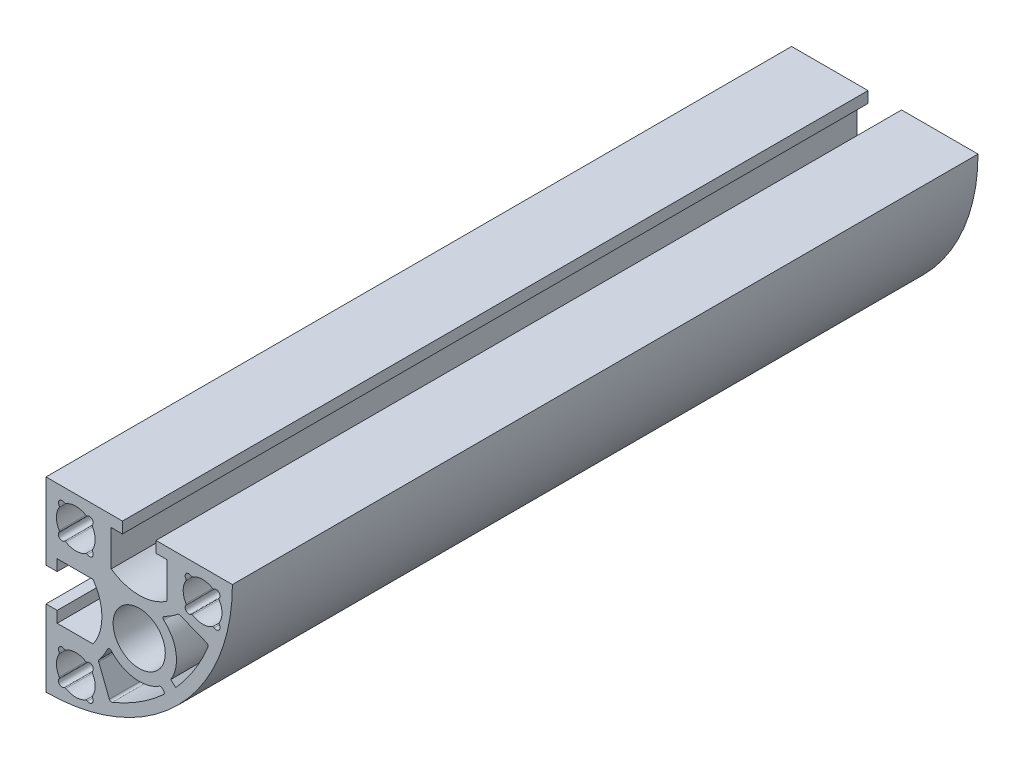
ISO-10303-21;
HEADER;
FILE_DESCRIPTION(('STEP AP214'),'2;1');
FILE_NAME('part.step','',(''),(''),'','','');
FILE_SCHEMA(('AUTOMOTIVE_DESIGN { 1 0 10303 214 1 1 1 1 }'));
ENDSEC;
DATA;
#1=APPLICATION_CONTEXT('core data for automotive mechanical design processes');
#2=APPLICATION_PROTOCOL_DEFINITION('international standard','automotive_design',2000,#1);
#3=PRODUCT_CONTEXT('',#1,'mechanical');
#4=PRODUCT('Part','Part','',(#3));
#5=PRODUCT_RELATED_PRODUCT_CATEGORY('part','',(#4));
#6=PRODUCT_DEFINITION_FORMATION('','',#4);
#7=PRODUCT_DEFINITION_CONTEXT('part definition',#1,'design');
#8=PRODUCT_DEFINITION('design','',#6,#7);
#9=PRODUCT_DEFINITION_SHAPE('','',#8);
#10=(LENGTH_UNIT() NAMED_UNIT(*) SI_UNIT(.MILLI.,.METRE.));
#11=(NAMED_UNIT(*) PLANE_ANGLE_UNIT() SI_UNIT($,.RADIAN.));
#12=(NAMED_UNIT(*) SI_UNIT($,.STERADIAN.) SOLID_ANGLE_UNIT());
#13=UNCERTAINTY_MEASURE_WITH_UNIT(LENGTH_MEASURE(1.E-05),#10,'distance_accuracy_value','');
#14=(GEOMETRIC_REPRESENTATION_CONTEXT(3) GLOBAL_UNCERTAINTY_ASSIGNED_CONTEXT((#13)) GLOBAL_UNIT_ASSIGNED_CONTEXT((#10,
#11,#12)) REPRESENTATION_CONTEXT('',''));
#15=CARTESIAN_POINT('',(0.,0.,0.));
#16=DIRECTION('',(0.,0.,1.));
#17=DIRECTION('',(1.,0.,0.));
#18=AXIS2_PLACEMENT_3D('',#15,#16,#17);
#19=CARTESIAN_POINT('',(-11.5,0.,50.));
#20=DIRECTION('',(0.,0.,-1.));
#21=DIRECTION('',(-1.,0.,0.));
#22=AXIS2_PLACEMENT_3D('',#19,#20,#21);
#23=PLANE('',#22);
#24=CARTESIAN_POINT('',(10.338477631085,10.338477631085,50.));
#25=DIRECTION('',(0.,0.,1.));
#26=DIRECTION('',(-1.,0.,0.));
#27=AXIS2_PLACEMENT_3D('',#24,#25,#26);
#28=CIRCLE('',#27,0.500000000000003);
#29=CARTESIAN_POINT('',(10.744662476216,10.0469062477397,50.));
#30=VERTEX_POINT('',#29);
#31=CARTESIAN_POINT('',(10.0469062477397,10.7446624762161,50.));
#32=VERTEX_POINT('',#31);
#33=EDGE_CURVE('E684',#30,#32,#28,.T.);
#34=ORIENTED_EDGE('',*,*,#33,.F.);
#35=CARTESIAN_POINT('',(10.9071364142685,9.93027769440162,50.));
#36=DIRECTION('',(0.,0.,-1.));
#37=DIRECTION('',(1.,0.,0.));
#38=AXIS2_PLACEMENT_3D('',#35,#36,#37);
#39=CIRCLE('',#38,0.199999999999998);
#40=CARTESIAN_POINT('',(10.7351980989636,9.82811500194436,50.));
#41=VERTEX_POINT('',#40);
#42=EDGE_CURVE('E716',#41,#30,#39,.T.);
#43=ORIENTED_EDGE('',*,*,#42,.F.);
#44=CARTESIAN_POINT('',(8.5,8.5,50.));
#45=DIRECTION('',(0.,0.,1.));
#46=DIRECTION('',(-1.,0.,0.));
#47=AXIS2_PLACEMENT_3D('',#44,#45,#46);
#48=CIRCLE('',#47,2.6);
#49=CARTESIAN_POINT('',(10.7351980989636,7.17188499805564,50.));
#50=VERTEX_POINT('',#49);
#51=EDGE_CURVE('E713',#50,#41,#48,.T.);
#52=ORIENTED_EDGE('',*,*,#51,.F.);
#53=CARTESIAN_POINT('',(10.9071364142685,7.06972230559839,50.));
#54=DIRECTION('',(0.,0.,-1.));
#55=DIRECTION('',(-1.,0.,0.));
#56=AXIS2_PLACEMENT_3D('',#53,#54,#55);
#57=CIRCLE('',#56,0.2);
#58=CARTESIAN_POINT('',(10.744662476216,6.95309375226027,50.));
#59=VERTEX_POINT('',#58);
#60=EDGE_CURVE('E711',#59,#50,#57,.T.);
#61=ORIENTED_EDGE('',*,*,#60,.F.);
#62=CARTESIAN_POINT('',(10.338477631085,6.66152236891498,50.));
#63=DIRECTION('',(0.,0.,1.));
#64=DIRECTION('',(-1.,0.,0.));
#65=AXIS2_PLACEMENT_3D('',#62,#63,#64);
#66=CIRCLE('',#65,0.499999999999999);
#67=CARTESIAN_POINT('',(10.0469062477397,6.25533752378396,50.));
#68=VERTEX_POINT('',#67);
#69=EDGE_CURVE('E709',#68,#59,#66,.T.);
#70=ORIENTED_EDGE('',*,*,#69,.F.);
#71=CARTESIAN_POINT('',(9.93027769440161,6.09286358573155,50.));
#72=DIRECTION('',(0.,0.,-1.));
#73=DIRECTION('',(1.,0.,0.));
#74=AXIS2_PLACEMENT_3D('',#71,#72,#73);
#75=CIRCLE('',#74,0.200000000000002);
#76=CARTESIAN_POINT('',(9.82811500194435,6.26480190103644,50.));
#77=VERTEX_POINT('',#76);
#78=EDGE_CURVE('E707',#77,#68,#75,.T.);
#79=ORIENTED_EDGE('',*,*,#78,.F.);
#80=CARTESIAN_POINT('',(8.5,8.5,50.));
#81=DIRECTION('',(0.,0.,1.));
#82=DIRECTION('',(-1.,0.,0.));
#83=AXIS2_PLACEMENT_3D('',#80,#81,#82);
#84=CIRCLE('',#83,2.6);
#85=CARTESIAN_POINT('',(7.17188499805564,6.26480190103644,50.));
#86=VERTEX_POINT('',#85);
#87=EDGE_CURVE('E705',#86,#77,#84,.T.);
#88=ORIENTED_EDGE('',*,*,#87,.F.);
#89=CARTESIAN_POINT('',(7.06972230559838,6.09286358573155,50.));
#90=DIRECTION('',(0.,0.,-1.));
#91=DIRECTION('',(-1.,0.,0.));
#92=AXIS2_PLACEMENT_3D('',#89,#90,#91);
#93=CIRCLE('',#92,0.199999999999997);
#94=CARTESIAN_POINT('',(6.95309375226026,6.25533752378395,50.));
#95=VERTEX_POINT('',#94);
#96=EDGE_CURVE('E703',#95,#86,#93,.T.);
#97=ORIENTED_EDGE('',*,*,#96,.F.);
#98=CARTESIAN_POINT('',(6.66152236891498,6.66152236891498,50.));
#99=DIRECTION('',(0.,0.,1.));
#100=DIRECTION('',(-1.,0.,0.));
#101=AXIS2_PLACEMENT_3D('',#98,#99,#100);
#102=CIRCLE('',#101,0.500000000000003);
#103=CARTESIAN_POINT('',(6.25533752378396,6.95309375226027,50.));
#104=VERTEX_POINT('',#103);
#105=EDGE_CURVE('E701',#104,#95,#102,.T.);
#106=ORIENTED_EDGE('',*,*,#105,.F.);
#107=CARTESIAN_POINT('',(6.09286358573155,7.06972230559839,50.));
#108=DIRECTION('',(0.,0.,-1.));
#109=DIRECTION('',(1.,0.,0.));
#110=AXIS2_PLACEMENT_3D('',#107,#108,#109);
#111=CIRCLE('',#110,0.199999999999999);
#112=CARTESIAN_POINT('',(6.26480190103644,7.17188499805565,50.));
#113=VERTEX_POINT('',#112);
#114=EDGE_CURVE('E699',#113,#104,#111,.T.);
#115=ORIENTED_EDGE('',*,*,#114,.F.);
#116=CARTESIAN_POINT('',(8.5,8.5,50.));
#117=DIRECTION('',(0.,0.,1.));
#118=DIRECTION('',(-1.,0.,0.));
#119=AXIS2_PLACEMENT_3D('',#116,#117,#118);
#120=CIRCLE('',#119,2.6);
#121=CARTESIAN_POINT('',(6.26480190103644,9.82811500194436,50.));
#122=VERTEX_POINT('',#121);
#123=EDGE_CURVE('E697',#122,#113,#120,.T.);
#124=ORIENTED_EDGE('',*,*,#123,.F.);
#125=CARTESIAN_POINT('',(6.09286358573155,9.93027769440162,50.));
#126=DIRECTION('',(0.,0.,-1.));
#127=DIRECTION('',(-1.,0.,0.));
#128=AXIS2_PLACEMENT_3D('',#125,#126,#127);
#129=CIRCLE('',#128,0.200000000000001);
#130=CARTESIAN_POINT('',(6.25533752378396,10.0469062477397,50.));
#131=VERTEX_POINT('',#130);
#132=EDGE_CURVE('E695',#131,#122,#129,.T.);
#133=ORIENTED_EDGE('',*,*,#132,.F.);
#134=CARTESIAN_POINT('',(6.66152236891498,10.338477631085,50.));
#135=DIRECTION('',(0.,0.,1.));
#136=DIRECTION('',(-1.,0.,0.));
#137=AXIS2_PLACEMENT_3D('',#134,#135,#136);
#138=CIRCLE('',#137,0.5);
#139=CARTESIAN_POINT('',(6.95309375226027,10.744662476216,50.));
#140=VERTEX_POINT('',#139);
#141=EDGE_CURVE('E693',#140,#131,#138,.T.);
#142=ORIENTED_EDGE('',*,*,#141,.F.);
#143=CARTESIAN_POINT('',(7.06972230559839,10.9071364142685,50.));
#144=DIRECTION('',(0.,0.,-1.));
#145=DIRECTION('',(1.,0.,0.));
#146=AXIS2_PLACEMENT_3D('',#143,#144,#145);
#147=CIRCLE('',#146,0.200000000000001);
#148=CARTESIAN_POINT('',(7.17188499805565,10.7351980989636,50.));
#149=VERTEX_POINT('',#148);
#150=EDGE_CURVE('E691',#149,#140,#147,.T.);
#151=ORIENTED_EDGE('',*,*,#150,.F.);
#152=CARTESIAN_POINT('',(8.5,8.5,50.));
#153=DIRECTION('',(0.,0.,1.));
#154=DIRECTION('',(-1.,0.,0.));
#155=AXIS2_PLACEMENT_3D('',#152,#153,#154);
#156=CIRCLE('',#155,2.6);
#157=CARTESIAN_POINT('',(9.82811500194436,10.7351980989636,50.));
#158=VERTEX_POINT('',#157);
#159=EDGE_CURVE('E689',#158,#149,#156,.T.);
#160=ORIENTED_EDGE('',*,*,#159,.F.);
#161=CARTESIAN_POINT('',(9.93027769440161,10.9071364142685,50.));
#162=DIRECTION('',(0.,0.,-1.));
#163=DIRECTION('',(-1.,0.,0.));
#164=AXIS2_PLACEMENT_3D('',#161,#162,#163);
#165=CIRCLE('',#164,0.199999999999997);
#166=EDGE_CURVE('E686',#32,#158,#165,.T.);
#167=ORIENTED_EDGE('',*,*,#166,.F.);
#168=EDGE_LOOP('',(#34,#43,#52,#61,#70,#79,#88,#97,#106,#115,#124,#133,#142,#151,#160,#167));
#169=FACE_BOUND('',#168,.T.);
#170=CARTESIAN_POINT('',(0.,0.,50.));
#171=DIRECTION('',(0.,0.,-1.));
#172=DIRECTION('',(1.,0.,0.));
#173=AXIS2_PLACEMENT_3D('',#170,#171,#172);
#174=CIRCLE('',#173,5.);
#175=CARTESIAN_POINT('',(3.30602604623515,3.75102543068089,50.));
#176=VERTEX_POINT('',#175);
#177=CARTESIAN_POINT('',(4.23079760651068,-2.66464849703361,50.));
#178=VERTEX_POINT('',#177);
#179=EDGE_CURVE('E914',#176,#178,#174,.T.);
#180=ORIENTED_EDGE('',*,*,#179,.F.);
#181=CARTESIAN_POINT('',(3.50438760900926,3.97608695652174,50.));
#182=DIRECTION('',(0.,0.,1.));
#183=DIRECTION('',(1.,0.,0.));
#184=AXIS2_PLACEMENT_3D('',#181,#182,#183);
#185=CIRCLE('',#184,0.300000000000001);
#186=CARTESIAN_POINT('',(3.37772299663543,4.24803562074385,50.));
#187=VERTEX_POINT('',#186);
#188=EDGE_CURVE('E930',#187,#176,#185,.T.);
#189=ORIENTED_EDGE('',*,*,#188,.F.);
#190=CARTESIAN_POINT('',(0.,11.5,50.));
#191=DIRECTION('',(0.,0.,-1.));
#192=DIRECTION('',(1.,0.,0.));
#193=AXIS2_PLACEMENT_3D('',#190,#191,#192);
#194=CIRCLE('',#193,8.);
#195=CARTESIAN_POINT('',(5.15033397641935,5.37839400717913,50.));
#196=VERTEX_POINT('',#195);
#197=EDGE_CURVE('E927',#196,#187,#194,.T.);
#198=ORIENTED_EDGE('',*,*,#197,.F.);
#199=CARTESIAN_POINT('',(5.34347150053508,5.14883378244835,50.));
#200=DIRECTION('',(0.,0.,1.));
#201=DIRECTION('',(1.,0.,0.));
#202=AXIS2_PLACEMENT_3D('',#199,#200,#201);
#203=CIRCLE('',#202,0.299999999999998);
#204=CARTESIAN_POINT('',(5.45342186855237,5.42795905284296,50.));
#205=VERTEX_POINT('',#204);
#206=EDGE_CURVE('E925',#205,#196,#203,.T.);
#207=ORIENTED_EDGE('',*,*,#206,.F.);
#208=DIRECTION('',(-0.930417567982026,0.366501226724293,0.));
#209=VECTOR('',#208,1.);
#210=CARTESIAN_POINT('',(5.45342186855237,5.42795905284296,50.));
#211=LINE('',#210,#209);
#212=CARTESIAN_POINT('',(9.06970793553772,4.00346608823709,50.));
#213=VERTEX_POINT('',#212);
#214=EDGE_CURVE('E923',#213,#205,#211,.T.);
#215=ORIENTED_EDGE('',*,*,#214,.F.);
#216=CARTESIAN_POINT('',(8.95975756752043,3.72434081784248,50.));
#217=DIRECTION('',(0.,0.,1.));
#218=DIRECTION('',(-1.,0.,0.));
#219=AXIS2_PLACEMENT_3D('',#216,#217,#218);
#220=CIRCLE('',#219,0.299999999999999);
#221=CARTESIAN_POINT('',(9.23740914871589,3.61072039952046,50.));
#222=VERTEX_POINT('',#221);
#223=EDGE_CURVE('E921',#222,#213,#220,.T.);
#224=ORIENTED_EDGE('',*,*,#223,.F.);
#225=CARTESIAN_POINT('',(-12.5119647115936,12.5109865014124,50.));
#226=DIRECTION('',(0.,0.,1.));
#227=DIRECTION('',(-1.,0.,0.));
#228=AXIS2_PLACEMENT_3D('',#225,#226,#227);
#229=CIRCLE('',#228,23.5);
#230=CARTESIAN_POINT('',(4.89997397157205,-3.27110433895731,50.));
#231=VERTEX_POINT('',#230);
#232=EDGE_CURVE('E919',#231,#222,#229,.T.);
#233=ORIENTED_EDGE('',*,*,#232,.F.);
#234=DIRECTION('',(0.740978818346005,-0.671528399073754,0.));
#235=VECTOR('',#234,1.);
#236=CARTESIAN_POINT('',(4.23079760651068,-2.66464849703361,50.));
#237=LINE('',#236,#235);
#238=EDGE_CURVE('E916',#178,#231,#237,.T.);
#239=ORIENTED_EDGE('',*,*,#238,.F.);
#240=EDGE_LOOP('',(#180,#189,#198,#207,#215,#224,#233,#239));
#241=FACE_BOUND('',#240,.T.);
#242=CARTESIAN_POINT('',(0.,0.,50.));
#243=DIRECTION('',(0.,0.,1.));
#244=DIRECTION('',(1.,0.,0.));
#245=AXIS2_PLACEMENT_3D('',#242,#243,#244);
#246=CIRCLE('',#245,3.5);
#247=CARTESIAN_POINT('',(3.5,0.,50.));
#248=VERTEX_POINT('',#247);
#249=EDGE_CURVE('E1046',#248,#248,#246,.T.);
#250=ORIENTED_EDGE('',*,*,#249,.F.);
#251=EDGE_LOOP('',(#250));
#252=FACE_BOUND('',#251,.T.);
#253=DIRECTION('',(0.,-1.,0.));
#254=VECTOR('',#253,1.);
#255=CARTESIAN_POINT('',(-12.5,12.5,50.));
#256=LINE('',#255,#254);
#257=CARTESIAN_POINT('',(-12.5,12.5,50.));
#258=VERTEX_POINT('',#257);
#259=CARTESIAN_POINT('',(-12.5,2.25,50.));
#260=VERTEX_POINT('',#259);
#261=EDGE_CURVE('E1052',#258,#260,#256,.T.);
#262=ORIENTED_EDGE('',*,*,#261,.T.);
#263=DIRECTION('',(1.,0.,0.));
#264=VECTOR('',#263,1.);
#265=CARTESIAN_POINT('',(-12.5,2.25,50.));
#266=LINE('',#265,#264);
#267=CARTESIAN_POINT('',(-11.,2.25,50.));
#268=VERTEX_POINT('',#267);
#269=EDGE_CURVE('E1055',#260,#268,#266,.T.);
#270=ORIENTED_EDGE('',*,*,#269,.T.);
#271=DIRECTION('',(0.,1.,0.));
#272=VECTOR('',#271,1.);
#273=CARTESIAN_POINT('',(-11.,2.25,50.));
#274=LINE('',#273,#272);
#275=CARTESIAN_POINT('',(-11.,3.75,50.));
#276=VERTEX_POINT('',#275);
#277=EDGE_CURVE('E1058',#268,#276,#274,.T.);
#278=ORIENTED_EDGE('',*,*,#277,.T.);
#279=DIRECTION('',(1.,0.,0.));
#280=VECTOR('',#279,1.);
#281=CARTESIAN_POINT('',(-11.,3.75,50.));
#282=LINE('',#281,#280);
#283=CARTESIAN_POINT('',(-6.19080985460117,3.75,50.));
#284=VERTEX_POINT('',#283);
#285=EDGE_CURVE('E1060',#276,#284,#282,.T.);
#286=ORIENTED_EDGE('',*,*,#285,.T.);
#287=CARTESIAN_POINT('',(-11.5,0.,50.));
#288=DIRECTION('',(0.,0.,-1.));
#289=DIRECTION('',(-1.,0.,0.));
#290=AXIS2_PLACEMENT_3D('',#287,#288,#289);
#291=CIRCLE('',#290,6.5);
#292=CARTESIAN_POINT('',(-6.19080985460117,-3.75,50.));
#293=VERTEX_POINT('',#292);
#294=EDGE_CURVE('E1062',#284,#293,#291,.T.);
#295=ORIENTED_EDGE('',*,*,#294,.T.);
#296=DIRECTION('',(-1.,0.,0.));
#297=VECTOR('',#296,1.);
#298=CARTESIAN_POINT('',(-11.,-3.75,50.));
#299=LINE('',#298,#297);
#300=CARTESIAN_POINT('',(-11.,-3.75,50.));
#301=VERTEX_POINT('',#300);
#302=EDGE_CURVE('E1064',#293,#301,#299,.T.);
#303=ORIENTED_EDGE('',*,*,#302,.T.);
#304=DIRECTION('',(0.,1.,0.));
#305=VECTOR('',#304,1.);
#306=CARTESIAN_POINT('',(-11.,-2.25,50.));
#307=LINE('',#306,#305);
#308=CARTESIAN_POINT('',(-11.,-2.25,50.));
#309=VERTEX_POINT('',#308);
#310=EDGE_CURVE('E1066',#301,#309,#307,.T.);
#311=ORIENTED_EDGE('',*,*,#310,.T.);
#312=DIRECTION('',(-1.,0.,0.));
#313=VECTOR('',#312,1.);
#314=CARTESIAN_POINT('',(-12.5,-2.25,50.));
#315=LINE('',#314,#313);
#316=CARTESIAN_POINT('',(-12.5,-2.25,50.));
#317=VERTEX_POINT('',#316);
#318=EDGE_CURVE('E1068',#309,#317,#315,.T.);
#319=ORIENTED_EDGE('',*,*,#318,.T.);
#320=DIRECTION('',(0.,-1.,0.));
#321=VECTOR('',#320,1.);
#322=CARTESIAN_POINT('',(-12.5,-12.5,50.));
#323=LINE('',#322,#321);
#324=CARTESIAN_POINT('',(-12.5,-12.5,50.));
#325=VERTEX_POINT('',#324);
#326=EDGE_CURVE('E1070',#317,#325,#323,.T.);
#327=ORIENTED_EDGE('',*,*,#326,.T.);
#328=CARTESIAN_POINT('',(-12.5,12.5,50.));
#329=DIRECTION('',(0.,0.,1.));
#330=DIRECTION('',(1.,0.,0.));
#331=AXIS2_PLACEMENT_3D('',#328,#329,#330);
#332=CIRCLE('',#331,25.);
#333=CARTESIAN_POINT('',(12.5,12.5,50.));
#334=VERTEX_POINT('',#333);
#335=EDGE_CURVE('E1072',#325,#334,#332,.T.);
#336=ORIENTED_EDGE('',*,*,#335,.T.);
#337=DIRECTION('',(-1.,0.,0.));
#338=VECTOR('',#337,1.);
#339=CARTESIAN_POINT('',(12.5,12.5,50.));
#340=LINE('',#339,#338);
#341=CARTESIAN_POINT('',(2.25,12.5,50.));
#342=VERTEX_POINT('',#341);
#343=EDGE_CURVE('E1074',#334,#342,#340,.T.);
#344=ORIENTED_EDGE('',*,*,#343,.T.);
#345=DIRECTION('',(0.,-1.,0.));
#346=VECTOR('',#345,1.);
#347=CARTESIAN_POINT('',(2.25,12.5,50.));
#348=LINE('',#347,#346);
#349=CARTESIAN_POINT('',(2.25,11.,50.));
#350=VERTEX_POINT('',#349);
#351=EDGE_CURVE('E1076',#342,#350,#348,.T.);
#352=ORIENTED_EDGE('',*,*,#351,.T.);
#353=DIRECTION('',(1.,0.,0.));
#354=VECTOR('',#353,1.);
#355=CARTESIAN_POINT('',(2.25,11.,50.));
#356=LINE('',#355,#354);
#357=CARTESIAN_POINT('',(3.75,11.,50.));
#358=VERTEX_POINT('',#357);
#359=EDGE_CURVE('E1078',#350,#358,#356,.T.);
#360=ORIENTED_EDGE('',*,*,#359,.T.);
#361=DIRECTION('',(0.,-1.,0.));
#362=VECTOR('',#361,1.);
#363=CARTESIAN_POINT('',(3.75,11.,50.));
#364=LINE('',#363,#362);
#365=CARTESIAN_POINT('',(3.75,6.19080985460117,50.));
#366=VERTEX_POINT('',#365);
#367=EDGE_CURVE('E1080',#358,#366,#364,.T.);
#368=ORIENTED_EDGE('',*,*,#367,.T.);
#369=CARTESIAN_POINT('',(0.,11.5,50.));
#370=DIRECTION('',(0.,0.,-1.));
#371=DIRECTION('',(1.,0.,0.));
#372=AXIS2_PLACEMENT_3D('',#369,#370,#371);
#373=CIRCLE('',#372,6.5);
#374=CARTESIAN_POINT('',(-3.75,6.19080985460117,50.));
#375=VERTEX_POINT('',#374);
#376=EDGE_CURVE('E1082',#366,#375,#373,.T.);
#377=ORIENTED_EDGE('',*,*,#376,.T.);
#378=DIRECTION('',(0.,1.,0.));
#379=VECTOR('',#378,1.);
#380=CARTESIAN_POINT('',(-3.75,11.,50.));
#381=LINE('',#380,#379);
#382=CARTESIAN_POINT('',(-3.75,11.,50.));
#383=VERTEX_POINT('',#382);
#384=EDGE_CURVE('E1084',#375,#383,#381,.T.);
#385=ORIENTED_EDGE('',*,*,#384,.T.);
#386=DIRECTION('',(1.,0.,0.));
#387=VECTOR('',#386,1.);
#388=CARTESIAN_POINT('',(-2.25,11.,50.));
#389=LINE('',#388,#387);
#390=CARTESIAN_POINT('',(-2.25,11.,50.));
#391=VERTEX_POINT('',#390);
#392=EDGE_CURVE('E1086',#383,#391,#389,.T.);
#393=ORIENTED_EDGE('',*,*,#392,.T.);
#394=DIRECTION('',(0.,1.,0.));
#395=VECTOR('',#394,1.);
#396=CARTESIAN_POINT('',(-2.25,12.5,50.));
#397=LINE('',#396,#395);
#398=CARTESIAN_POINT('',(-2.25,12.5,50.));
#399=VERTEX_POINT('',#398);
#400=EDGE_CURVE('E1088',#391,#399,#397,.T.);
#401=ORIENTED_EDGE('',*,*,#400,.T.);
#402=DIRECTION('',(-1.,0.,0.));
#403=VECTOR('',#402,1.);
#404=CARTESIAN_POINT('',(-12.5,12.5,50.));
#405=LINE('',#404,#403);
#406=EDGE_CURVE('E1090',#399,#258,#405,.T.);
#407=ORIENTED_EDGE('',*,*,#406,.T.);
#408=EDGE_LOOP('',(#262,#270,#278,#286,#295,#303,#311,#319,#327,#336,#344,#352,#360,#368,#377,
#385,#393,#401,#407));
#409=FACE_BOUND('',#408,.T.);
#410=CARTESIAN_POINT('',(3.06963083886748,-4.67769390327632,50.));
#411=DIRECTION('',(0.,0.,1.));
#412=DIRECTION('',(-1.,0.,0.));
#413=AXIS2_PLACEMENT_3D('',#410,#411,#412);
#414=CIRCLE('',#413,0.300000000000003);
#415=CARTESIAN_POINT('',(3.27110433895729,-4.89997397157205,50.));
#416=VERTEX_POINT('',#415);
#417=CARTESIAN_POINT('',(3.28928613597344,-4.47336194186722,50.));
#418=VERTEX_POINT('',#417);
#419=EDGE_CURVE('E973',#416,#418,#414,.T.);
#420=ORIENTED_EDGE('',*,*,#419,.F.);
#421=CARTESIAN_POINT('',(-12.5109865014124,12.5119647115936,50.));
#422=DIRECTION('',(0.,0.,1.));
#423=DIRECTION('',(1.,0.,0.));
#424=AXIS2_PLACEMENT_3D('',#421,#422,#423);
#425=CIRCLE('',#424,23.5);
#426=CARTESIAN_POINT('',(-3.61072039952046,-9.23740914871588,50.));
#427=VERTEX_POINT('',#426);
#428=EDGE_CURVE('E993',#427,#416,#425,.T.);
#429=ORIENTED_EDGE('',*,*,#428,.F.);
#430=CARTESIAN_POINT('',(-3.72434081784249,-8.95975756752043,50.));
#431=DIRECTION('',(0.,0.,1.));
#432=DIRECTION('',(1.,0.,0.));
#433=AXIS2_PLACEMENT_3D('',#430,#431,#432);
#434=CIRCLE('',#433,0.299999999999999);
#435=CARTESIAN_POINT('',(-4.0034660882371,-9.06970793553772,50.));
#436=VERTEX_POINT('',#435);
#437=EDGE_CURVE('E990',#436,#427,#434,.T.);
#438=ORIENTED_EDGE('',*,*,#437,.F.);
#439=DIRECTION('',(0.366501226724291,-0.930417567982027,0.));
#440=VECTOR('',#439,1.);
#441=CARTESIAN_POINT('',(-5.42795905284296,-5.45342186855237,50.));
#442=LINE('',#441,#440);
#443=CARTESIAN_POINT('',(-5.42795905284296,-5.45342186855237,50.));
#444=VERTEX_POINT('',#443);
#445=EDGE_CURVE('E988',#444,#436,#442,.T.);
#446=ORIENTED_EDGE('',*,*,#445,.F.);
#447=CARTESIAN_POINT('',(-5.14883378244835,-5.34347150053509,50.));
#448=DIRECTION('',(0.,0.,1.));
#449=DIRECTION('',(-1.,0.,0.));
#450=AXIS2_PLACEMENT_3D('',#447,#448,#449);
#451=CIRCLE('',#450,0.299999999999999);
#452=CARTESIAN_POINT('',(-5.37839400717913,-5.15033397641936,50.));
#453=VERTEX_POINT('',#452);
#454=EDGE_CURVE('E986',#453,#444,#451,.T.);
#455=ORIENTED_EDGE('',*,*,#454,.F.);
#456=CARTESIAN_POINT('',(-11.5,0.,50.));
#457=DIRECTION('',(0.,0.,-1.));
#458=DIRECTION('',(-1.,0.,0.));
#459=AXIS2_PLACEMENT_3D('',#456,#457,#458);
#460=CIRCLE('',#459,8.);
#461=CARTESIAN_POINT('',(-4.24803562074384,-3.37772299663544,50.));
#462=VERTEX_POINT('',#461);
#463=EDGE_CURVE('E984',#462,#453,#460,.T.);
#464=ORIENTED_EDGE('',*,*,#463,.F.);
#465=CARTESIAN_POINT('',(-3.97608695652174,-3.50438760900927,50.));
#466=DIRECTION('',(0.,0.,1.));
#467=DIRECTION('',(-1.,0.,0.));
#468=AXIS2_PLACEMENT_3D('',#465,#466,#467);
#469=CIRCLE('',#468,0.3);
#470=CARTESIAN_POINT('',(-3.75102543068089,-3.30602604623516,50.));
#471=VERTEX_POINT('',#470);
#472=EDGE_CURVE('E982',#471,#462,#469,.T.);
#473=ORIENTED_EDGE('',*,*,#472,.F.);
#474=CARTESIAN_POINT('',(0.,0.,50.));
#475=DIRECTION('',(0.,0.,-1.));
#476=DIRECTION('',(1.,0.,0.));
#477=AXIS2_PLACEMENT_3D('',#474,#475,#476);
#478=CIRCLE('',#477,5.);
#479=CARTESIAN_POINT('',(2.7034788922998,-4.20609104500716,50.));
#480=VERTEX_POINT('',#479);
#481=EDGE_CURVE('E980',#480,#471,#478,.T.);
#482=ORIENTED_EDGE('',*,*,#481,.F.);
#483=CARTESIAN_POINT('',(2.86568762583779,-4.45845650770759,50.));
#484=DIRECTION('',(0.,0.,1.));
#485=DIRECTION('',(1.,0.,0.));
#486=AXIS2_PLACEMENT_3D('',#483,#484,#485);
#487=CIRCLE('',#486,0.299999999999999);
#488=CARTESIAN_POINT('',(3.08534292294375,-4.25412454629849,50.));
#489=VERTEX_POINT('',#488);
#490=EDGE_CURVE('E978',#489,#480,#487,.T.);
#491=ORIENTED_EDGE('',*,*,#490,.F.);
#492=DIRECTION('',(-0.681106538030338,0.732184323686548,0.));
#493=VECTOR('',#492,1.);
#494=CARTESIAN_POINT('',(3.08534292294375,-4.25412454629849,50.));
#495=LINE('',#494,#493);
#496=EDGE_CURVE('E975',#418,#489,#495,.T.);
#497=ORIENTED_EDGE('',*,*,#496,.F.);
#498=EDGE_LOOP('',(#420,#429,#438,#446,#455,#464,#473,#482,#491,#497));
#499=FACE_BOUND('',#498,.T.);
#500=CARTESIAN_POINT('',(-10.9071364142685,7.06972230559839,50.));
#501=DIRECTION('',(0.,0.,-1.));
#502=DIRECTION('',(1.,0.,0.));
#503=AXIS2_PLACEMENT_3D('',#500,#501,#502);
#504=CIRCLE('',#503,0.2);
#505=CARTESIAN_POINT('',(-10.7351980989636,7.17188499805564,50.));
#506=VERTEX_POINT('',#505);
#507=CARTESIAN_POINT('',(-10.744662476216,6.95309375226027,50.));
#508=VERTEX_POINT('',#507);
#509=EDGE_CURVE('E799',#506,#508,#504,.T.);
#510=ORIENTED_EDGE('',*,*,#509,.F.);
#511=CARTESIAN_POINT('',(-8.5,8.5,50.));
#512=DIRECTION('',(0.,0.,1.));
#513=DIRECTION('',(1.,0.,0.));
#514=AXIS2_PLACEMENT_3D('',#511,#512,#513);
#515=CIRCLE('',#514,2.6);
#516=CARTESIAN_POINT('',(-10.7351980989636,9.82811500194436,50.));
#517=VERTEX_POINT('',#516);
#518=EDGE_CURVE('E831',#517,#506,#515,.T.);
#519=ORIENTED_EDGE('',*,*,#518,.F.);
#520=CARTESIAN_POINT('',(-10.9071364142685,9.93027769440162,50.));
#521=DIRECTION('',(0.,0.,-1.));
#522=DIRECTION('',(-1.,0.,0.));
#523=AXIS2_PLACEMENT_3D('',#520,#521,#522);
#524=CIRCLE('',#523,0.199999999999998);
#525=CARTESIAN_POINT('',(-10.744662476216,10.0469062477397,50.));
#526=VERTEX_POINT('',#525);
#527=EDGE_CURVE('E828',#526,#517,#524,.T.);
#528=ORIENTED_EDGE('',*,*,#527,.F.);
#529=CARTESIAN_POINT('',(-10.338477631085,10.338477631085,50.));
#530=DIRECTION('',(0.,0.,1.));
#531=DIRECTION('',(1.,0.,0.));
#532=AXIS2_PLACEMENT_3D('',#529,#530,#531);
#533=CIRCLE('',#532,0.500000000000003);
#534=CARTESIAN_POINT('',(-10.0469062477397,10.7446624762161,50.));
#535=VERTEX_POINT('',#534);
#536=EDGE_CURVE('E826',#535,#526,#533,.T.);
#537=ORIENTED_EDGE('',*,*,#536,.F.);
#538=CARTESIAN_POINT('',(-9.93027769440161,10.9071364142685,50.));
#539=DIRECTION('',(0.,0.,-1.));
#540=DIRECTION('',(1.,0.,0.));
#541=AXIS2_PLACEMENT_3D('',#538,#539,#540);
#542=CIRCLE('',#541,0.199999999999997);
#543=CARTESIAN_POINT('',(-9.82811500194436,10.7351980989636,50.));
#544=VERTEX_POINT('',#543);
#545=EDGE_CURVE('E824',#544,#535,#542,.T.);
#546=ORIENTED_EDGE('',*,*,#545,.F.);
#547=CARTESIAN_POINT('',(-8.5,8.5,50.));
#548=DIRECTION('',(0.,0.,1.));
#549=DIRECTION('',(1.,0.,0.));
#550=AXIS2_PLACEMENT_3D('',#547,#548,#549);
#551=CIRCLE('',#550,2.6);
#552=CARTESIAN_POINT('',(-7.17188499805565,10.7351980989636,50.));
#553=VERTEX_POINT('',#552);
#554=EDGE_CURVE('E822',#553,#544,#551,.T.);
#555=ORIENTED_EDGE('',*,*,#554,.F.);
#556=CARTESIAN_POINT('',(-7.06972230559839,10.9071364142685,50.));
#557=DIRECTION('',(0.,0.,-1.));
#558=DIRECTION('',(-1.,0.,0.));
#559=AXIS2_PLACEMENT_3D('',#556,#557,#558);
#560=CIRCLE('',#559,0.200000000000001);
#561=CARTESIAN_POINT('',(-6.95309375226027,10.744662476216,50.));
#562=VERTEX_POINT('',#561);
#563=EDGE_CURVE('E820',#562,#553,#560,.T.);
#564=ORIENTED_EDGE('',*,*,#563,.F.);
#565=CARTESIAN_POINT('',(-6.66152236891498,10.338477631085,50.));
#566=DIRECTION('',(0.,0.,1.));
#567=DIRECTION('',(1.,0.,0.));
#568=AXIS2_PLACEMENT_3D('',#565,#566,#567);
#569=CIRCLE('',#568,0.5);
#570=CARTESIAN_POINT('',(-6.25533752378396,10.0469062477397,50.));
#571=VERTEX_POINT('',#570);
#572=EDGE_CURVE('E818',#571,#562,#569,.T.);
#573=ORIENTED_EDGE('',*,*,#572,.F.);
#574=CARTESIAN_POINT('',(-6.09286358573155,9.93027769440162,50.));
#575=DIRECTION('',(0.,0.,-1.));
#576=DIRECTION('',(1.,0.,0.));
#577=AXIS2_PLACEMENT_3D('',#574,#575,#576);
#578=CIRCLE('',#577,0.200000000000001);
#579=CARTESIAN_POINT('',(-6.26480190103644,9.82811500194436,50.));
#580=VERTEX_POINT('',#579);
#581=EDGE_CURVE('E816',#580,#571,#578,.T.);
#582=ORIENTED_EDGE('',*,*,#581,.F.);
#583=CARTESIAN_POINT('',(-8.5,8.5,50.));
#584=DIRECTION('',(0.,0.,1.));
#585=DIRECTION('',(1.,0.,0.));
#586=AXIS2_PLACEMENT_3D('',#583,#584,#585);
#587=CIRCLE('',#586,2.6);
#588=CARTESIAN_POINT('',(-6.26480190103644,7.17188499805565,50.));
#589=VERTEX_POINT('',#588);
#590=EDGE_CURVE('E814',#589,#580,#587,.T.);
#591=ORIENTED_EDGE('',*,*,#590,.F.);
#592=CARTESIAN_POINT('',(-6.09286358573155,7.06972230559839,50.));
#593=DIRECTION('',(0.,0.,-1.));
#594=DIRECTION('',(-1.,0.,0.));
#595=AXIS2_PLACEMENT_3D('',#592,#593,#594);
#596=CIRCLE('',#595,0.199999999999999);
#597=CARTESIAN_POINT('',(-6.25533752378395,6.95309375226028,50.));
#598=VERTEX_POINT('',#597);
#599=EDGE_CURVE('E812',#598,#589,#596,.T.);
#600=ORIENTED_EDGE('',*,*,#599,.F.);
#601=CARTESIAN_POINT('',(-6.66152236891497,6.66152236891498,50.));
#602=DIRECTION('',(0.,0.,1.));
#603=DIRECTION('',(1.,0.,0.));
#604=AXIS2_PLACEMENT_3D('',#601,#602,#603);
#605=CIRCLE('',#604,0.500000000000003);
#606=CARTESIAN_POINT('',(-6.95309375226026,6.25533752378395,50.));
#607=VERTEX_POINT('',#606);
#608=EDGE_CURVE('E810',#607,#598,#605,.T.);
#609=ORIENTED_EDGE('',*,*,#608,.F.);
#610=CARTESIAN_POINT('',(-7.06972230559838,6.09286358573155,50.));
#611=DIRECTION('',(0.,0.,-1.));
#612=DIRECTION('',(1.,0.,0.));
#613=AXIS2_PLACEMENT_3D('',#610,#611,#612);
#614=CIRCLE('',#613,0.199999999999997);
#615=CARTESIAN_POINT('',(-7.17188499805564,6.26480190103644,50.));
#616=VERTEX_POINT('',#615);
#617=EDGE_CURVE('E808',#616,#607,#614,.T.);
#618=ORIENTED_EDGE('',*,*,#617,.F.);
#619=CARTESIAN_POINT('',(-8.5,8.5,50.));
#620=DIRECTION('',(0.,0.,1.));
#621=DIRECTION('',(1.,0.,0.));
#622=AXIS2_PLACEMENT_3D('',#619,#620,#621);
#623=CIRCLE('',#622,2.6);
#624=CARTESIAN_POINT('',(-9.82811500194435,6.26480190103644,50.));
#625=VERTEX_POINT('',#624);
#626=EDGE_CURVE('E806',#625,#616,#623,.T.);
#627=ORIENTED_EDGE('',*,*,#626,.F.);
#628=CARTESIAN_POINT('',(-9.93027769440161,6.09286358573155,50.));
#629=DIRECTION('',(0.,0.,-1.));
#630=DIRECTION('',(-1.,0.,0.));
#631=AXIS2_PLACEMENT_3D('',#628,#629,#630);
#632=CIRCLE('',#631,0.200000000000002);
#633=CARTESIAN_POINT('',(-10.0469062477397,6.25533752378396,50.));
#634=VERTEX_POINT('',#633);
#635=EDGE_CURVE('E804',#634,#625,#632,.T.);
#636=ORIENTED_EDGE('',*,*,#635,.F.);
#637=CARTESIAN_POINT('',(-10.338477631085,6.66152236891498,50.));
#638=DIRECTION('',(0.,0.,1.));
#639=DIRECTION('',(1.,0.,0.));
#640=AXIS2_PLACEMENT_3D('',#637,#638,#639);
#641=CIRCLE('',#640,0.499999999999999);
#642=EDGE_CURVE('E801',#508,#634,#641,.T.);
#643=ORIENTED_EDGE('',*,*,#642,.F.);
#644=EDGE_LOOP('',(#510,#519,#528,#537,#546,#555,#564,#573,#582,#591,#600,#609,#618,#627,#636,#643));
#645=FACE_BOUND('',#644,.T.);
#646=CARTESIAN_POINT('',(-10.338477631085,-10.338477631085,50.));
#647=DIRECTION('',(0.,0.,1.));
#648=DIRECTION('',(-1.,0.,0.));
#649=AXIS2_PLACEMENT_3D('',#646,#647,#648);
#650=CIRCLE('',#649,0.500000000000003);
#651=CARTESIAN_POINT('',(-10.744662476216,-10.0469062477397,50.));
#652=VERTEX_POINT('',#651);
#653=CARTESIAN_POINT('',(-10.0469062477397,-10.7446624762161,50.));
#654=VERTEX_POINT('',#653);
#655=EDGE_CURVE('E563',#652,#654,#650,.T.);
#656=ORIENTED_EDGE('',*,*,#655,.F.);
#657=CARTESIAN_POINT('',(-10.9071364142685,-9.93027769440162,50.));
#658=DIRECTION('',(0.,0.,-1.));
#659=DIRECTION('',(1.,0.,0.));
#660=AXIS2_PLACEMENT_3D('',#657,#658,#659);
#661=CIRCLE('',#660,0.199999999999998);
#662=CARTESIAN_POINT('',(-10.7351980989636,-9.82811500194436,50.));
#663=VERTEX_POINT('',#662);
#664=EDGE_CURVE('E612',#663,#652,#661,.T.);
#665=ORIENTED_EDGE('',*,*,#664,.F.);
#666=CARTESIAN_POINT('',(-8.5,-8.5,50.));
#667=DIRECTION('',(0.,0.,1.));
#668=DIRECTION('',(-1.,0.,0.));
#669=AXIS2_PLACEMENT_3D('',#666,#667,#668);
#670=CIRCLE('',#669,2.6);
#671=CARTESIAN_POINT('',(-10.7351980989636,-7.17188499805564,50.));
#672=VERTEX_POINT('',#671);
#673=EDGE_CURVE('E610',#672,#663,#670,.T.);
#674=ORIENTED_EDGE('',*,*,#673,.F.);
#675=CARTESIAN_POINT('',(-10.9071364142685,-7.06972230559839,50.));
#676=DIRECTION('',(0.,0.,-1.));
#677=DIRECTION('',(-1.,0.,0.));
#678=AXIS2_PLACEMENT_3D('',#675,#676,#677);
#679=CIRCLE('',#678,0.2);
#680=CARTESIAN_POINT('',(-10.744662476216,-6.95309375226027,50.));
#681=VERTEX_POINT('',#680);
#682=EDGE_CURVE('E608',#681,#672,#679,.T.);
#683=ORIENTED_EDGE('',*,*,#682,.F.);
#684=CARTESIAN_POINT('',(-10.338477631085,-6.66152236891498,50.));
#685=DIRECTION('',(0.,0.,1.));
#686=DIRECTION('',(-1.,0.,0.));
#687=AXIS2_PLACEMENT_3D('',#684,#685,#686);
#688=CIRCLE('',#687,0.499999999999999);
#689=CARTESIAN_POINT('',(-10.0469062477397,-6.25533752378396,50.));
#690=VERTEX_POINT('',#689);
#691=EDGE_CURVE('E606',#690,#681,#688,.T.);
#692=ORIENTED_EDGE('',*,*,#691,.F.);
#693=CARTESIAN_POINT('',(-9.93027769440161,-6.09286358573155,50.));
#694=DIRECTION('',(0.,0.,-1.));
#695=DIRECTION('',(1.,0.,0.));
#696=AXIS2_PLACEMENT_3D('',#693,#694,#695);
#697=CIRCLE('',#696,0.200000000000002);
#698=CARTESIAN_POINT('',(-9.82811500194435,-6.26480190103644,50.));
#699=VERTEX_POINT('',#698);
#700=EDGE_CURVE('E604',#699,#690,#697,.T.);
#701=ORIENTED_EDGE('',*,*,#700,.F.);
#702=CARTESIAN_POINT('',(-8.5,-8.5,50.));
#703=DIRECTION('',(0.,0.,1.));
#704=DIRECTION('',(-1.,0.,0.));
#705=AXIS2_PLACEMENT_3D('',#702,#703,#704);
#706=CIRCLE('',#705,2.6);
#707=CARTESIAN_POINT('',(-7.17188499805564,-6.26480190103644,50.));
#708=VERTEX_POINT('',#707);
#709=EDGE_CURVE('E602',#708,#699,#706,.T.);
#710=ORIENTED_EDGE('',*,*,#709,.F.);
#711=CARTESIAN_POINT('',(-7.06972230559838,-6.09286358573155,50.));
#712=DIRECTION('',(0.,0.,-1.));
#713=DIRECTION('',(-1.,0.,0.));
#714=AXIS2_PLACEMENT_3D('',#711,#712,#713);
#715=CIRCLE('',#714,0.199999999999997);
#716=CARTESIAN_POINT('',(-6.95309375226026,-6.25533752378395,50.));
#717=VERTEX_POINT('',#716);
#718=EDGE_CURVE('E600',#717,#708,#715,.T.);
#719=ORIENTED_EDGE('',*,*,#718,.F.);
#720=CARTESIAN_POINT('',(-6.66152236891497,-6.66152236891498,50.));
#721=DIRECTION('',(0.,0.,1.));
#722=DIRECTION('',(-1.,0.,0.));
#723=AXIS2_PLACEMENT_3D('',#720,#721,#722);
#724=CIRCLE('',#723,0.500000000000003);
#725=CARTESIAN_POINT('',(-6.25533752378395,-6.95309375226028,50.));
#726=VERTEX_POINT('',#725);
#727=EDGE_CURVE('E598',#726,#717,#724,.T.);
#728=ORIENTED_EDGE('',*,*,#727,.F.);
#729=CARTESIAN_POINT('',(-6.09286358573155,-7.06972230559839,50.));
#730=DIRECTION('',(0.,0.,-1.));
#731=DIRECTION('',(1.,0.,0.));
#732=AXIS2_PLACEMENT_3D('',#729,#730,#731);
#733=CIRCLE('',#732,0.199999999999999);
#734=CARTESIAN_POINT('',(-6.26480190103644,-7.17188499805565,50.));
#735=VERTEX_POINT('',#734);
#736=EDGE_CURVE('E596',#735,#726,#733,.T.);
#737=ORIENTED_EDGE('',*,*,#736,.F.);
#738=CARTESIAN_POINT('',(-8.5,-8.5,50.));
#739=DIRECTION('',(0.,0.,1.));
#740=DIRECTION('',(-1.,0.,0.));
#741=AXIS2_PLACEMENT_3D('',#738,#739,#740);
#742=CIRCLE('',#741,2.6);
#743=CARTESIAN_POINT('',(-6.26480190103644,-9.82811500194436,50.));
#744=VERTEX_POINT('',#743);
#745=EDGE_CURVE('E594',#744,#735,#742,.T.);
#746=ORIENTED_EDGE('',*,*,#745,.F.);
#747=CARTESIAN_POINT('',(-6.09286358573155,-9.93027769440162,50.));
#748=DIRECTION('',(0.,0.,-1.));
#749=DIRECTION('',(-1.,0.,0.));
#750=AXIS2_PLACEMENT_3D('',#747,#748,#749);
#751=CIRCLE('',#750,0.200000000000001);
#752=CARTESIAN_POINT('',(-6.25533752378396,-10.0469062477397,50.));
#753=VERTEX_POINT('',#752);
#754=EDGE_CURVE('E592',#753,#744,#751,.T.);
#755=ORIENTED_EDGE('',*,*,#754,.F.);
#756=CARTESIAN_POINT('',(-6.66152236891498,-10.338477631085,50.));
#757=DIRECTION('',(0.,0.,1.));
#758=DIRECTION('',(-1.,0.,0.));
#759=AXIS2_PLACEMENT_3D('',#756,#757,#758);
#760=CIRCLE('',#759,0.5);
#761=CARTESIAN_POINT('',(-6.95309375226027,-10.744662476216,50.));
#762=VERTEX_POINT('',#761);
#763=EDGE_CURVE('E590',#762,#753,#760,.T.);
#764=ORIENTED_EDGE('',*,*,#763,.F.);
#765=CARTESIAN_POINT('',(-7.06972230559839,-10.9071364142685,50.));
#766=DIRECTION('',(0.,0.,-1.));
#767=DIRECTION('',(1.,0.,0.));
#768=AXIS2_PLACEMENT_3D('',#765,#766,#767);
#769=CIRCLE('',#768,0.200000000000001);
#770=CARTESIAN_POINT('',(-7.17188499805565,-10.7351980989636,50.));
#771=VERTEX_POINT('',#770);
#772=EDGE_CURVE('E586',#771,#762,#769,.T.);
#773=ORIENTED_EDGE('',*,*,#772,.F.);
#774=CARTESIAN_POINT('',(-8.5,-8.5,50.));
#775=DIRECTION('',(0.,0.,1.));
#776=DIRECTION('',(-1.,0.,0.));
#777=AXIS2_PLACEMENT_3D('',#774,#775,#776);
#778=CIRCLE('',#777,2.6);
#779=CARTESIAN_POINT('',(-9.82811500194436,-10.7351980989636,50.));
#780=VERTEX_POINT('',#779);
#781=EDGE_CURVE('E584',#780,#771,#778,.T.);
#782=ORIENTED_EDGE('',*,*,#781,.F.);
#783=CARTESIAN_POINT('',(-9.93027769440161,-10.9071364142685,50.));
#784=DIRECTION('',(0.,0.,-1.));
#785=DIRECTION('',(-1.,0.,0.));
#786=AXIS2_PLACEMENT_3D('',#783,#784,#785);
#787=CIRCLE('',#786,0.199999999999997);
#788=EDGE_CURVE('E571',#654,#780,#787,.T.);
#789=ORIENTED_EDGE('',*,*,#788,.F.);
#790=EDGE_LOOP('',(#656,#665,#674,#683,#692,#701,#710,#719,#728,#737,#746,#755,#764,#773,#782,#789));
#791=FACE_BOUND('',#790,.T.);
#792=ADVANCED_FACE('F36',(#169,#241,#252,#409,#499,#645,#791),#23,.F.);
#793=CARTESIAN_POINT('',(-11.5,0.,-50.));
#794=DIRECTION('',(0.,0.,-1.));
#795=DIRECTION('',(-1.,0.,0.));
#796=AXIS2_PLACEMENT_3D('',#793,#794,#795);
#797=PLANE('',#796);
#798=CARTESIAN_POINT('',(10.9071364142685,9.93027769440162,-50.));
#799=DIRECTION('',(0.,0.,-1.));
#800=DIRECTION('',(1.,0.,0.));
#801=AXIS2_PLACEMENT_3D('',#798,#799,#800);
#802=CIRCLE('',#801,0.199999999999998);
#803=CARTESIAN_POINT('',(10.7351980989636,9.82811500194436,-50.));
#804=VERTEX_POINT('',#803);
#805=CARTESIAN_POINT('',(10.744662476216,10.0469062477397,-50.));
#806=VERTEX_POINT('',#805);
#807=EDGE_CURVE('E687',#804,#806,#802,.T.);
#808=ORIENTED_EDGE('',*,*,#807,.T.);
#809=CARTESIAN_POINT('',(10.338477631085,10.338477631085,-50.));
#810=DIRECTION('',(0.,0.,1.));
#811=DIRECTION('',(-1.,0.,0.));
#812=AXIS2_PLACEMENT_3D('',#809,#810,#811);
#813=CIRCLE('',#812,0.500000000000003);
#814=CARTESIAN_POINT('',(10.0469062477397,10.7446624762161,-50.));
#815=VERTEX_POINT('',#814);
#816=EDGE_CURVE('E579',#806,#815,#813,.T.);
#817=ORIENTED_EDGE('',*,*,#816,.T.);
#818=CARTESIAN_POINT('',(9.93027769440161,10.9071364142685,-50.));
#819=DIRECTION('',(0.,0.,-1.));
#820=DIRECTION('',(-1.,0.,0.));
#821=AXIS2_PLACEMENT_3D('',#818,#819,#820);
#822=CIRCLE('',#821,0.199999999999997);
#823=CARTESIAN_POINT('',(9.82811500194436,10.7351980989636,-50.));
#824=VERTEX_POINT('',#823);
#825=EDGE_CURVE('E721',#815,#824,#822,.T.);
#826=ORIENTED_EDGE('',*,*,#825,.T.);
#827=CARTESIAN_POINT('',(8.5,8.5,-50.));
#828=DIRECTION('',(0.,0.,1.));
#829=DIRECTION('',(-1.,0.,0.));
#830=AXIS2_PLACEMENT_3D('',#827,#828,#829);
#831=CIRCLE('',#830,2.6);
#832=CARTESIAN_POINT('',(7.17188499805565,10.7351980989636,-50.));
#833=VERTEX_POINT('',#832);
#834=EDGE_CURVE('E724',#824,#833,#831,.T.);
#835=ORIENTED_EDGE('',*,*,#834,.T.);
#836=CARTESIAN_POINT('',(7.06972230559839,10.9071364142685,-50.));
#837=DIRECTION('',(0.,0.,-1.));
#838=DIRECTION('',(1.,0.,0.));
#839=AXIS2_PLACEMENT_3D('',#836,#837,#838);
#840=CIRCLE('',#839,0.200000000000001);
#841=CARTESIAN_POINT('',(6.95309375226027,10.744662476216,-50.));
#842=VERTEX_POINT('',#841);
#843=EDGE_CURVE('E727',#833,#842,#840,.T.);
#844=ORIENTED_EDGE('',*,*,#843,.T.);
#845=CARTESIAN_POINT('',(6.66152236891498,10.338477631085,-50.));
#846=DIRECTION('',(0.,0.,1.));
#847=DIRECTION('',(-1.,0.,0.));
#848=AXIS2_PLACEMENT_3D('',#845,#846,#847);
#849=CIRCLE('',#848,0.5);
#850=CARTESIAN_POINT('',(6.25533752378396,10.0469062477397,-50.));
#851=VERTEX_POINT('',#850);
#852=EDGE_CURVE('E730',#842,#851,#849,.T.);
#853=ORIENTED_EDGE('',*,*,#852,.T.);
#854=CARTESIAN_POINT('',(6.09286358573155,9.93027769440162,-50.));
#855=DIRECTION('',(0.,0.,-1.));
#856=DIRECTION('',(-1.,0.,0.));
#857=AXIS2_PLACEMENT_3D('',#854,#855,#856);
#858=CIRCLE('',#857,0.200000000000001);
#859=CARTESIAN_POINT('',(6.26480190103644,9.82811500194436,-50.));
#860=VERTEX_POINT('',#859);
#861=EDGE_CURVE('E733',#851,#860,#858,.T.);
#862=ORIENTED_EDGE('',*,*,#861,.T.);
#863=CARTESIAN_POINT('',(8.5,8.5,-50.));
#864=DIRECTION('',(0.,0.,1.));
#865=DIRECTION('',(-1.,0.,0.));
#866=AXIS2_PLACEMENT_3D('',#863,#864,#865);
#867=CIRCLE('',#866,2.6);
#868=CARTESIAN_POINT('',(6.26480190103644,7.17188499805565,-50.));
#869=VERTEX_POINT('',#868);
#870=EDGE_CURVE('E736',#860,#869,#867,.T.);
#871=ORIENTED_EDGE('',*,*,#870,.T.);
#872=CARTESIAN_POINT('',(6.09286358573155,7.06972230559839,-50.));
#873=DIRECTION('',(0.,0.,-1.));
#874=DIRECTION('',(1.,0.,0.));
#875=AXIS2_PLACEMENT_3D('',#872,#873,#874);
#876=CIRCLE('',#875,0.199999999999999);
#877=CARTESIAN_POINT('',(6.25533752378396,6.95309375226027,-50.));
#878=VERTEX_POINT('',#877);
#879=EDGE_CURVE('E739',#869,#878,#876,.T.);
#880=ORIENTED_EDGE('',*,*,#879,.T.);
#881=CARTESIAN_POINT('',(6.66152236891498,6.66152236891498,-50.));
#882=DIRECTION('',(0.,0.,1.));
#883=DIRECTION('',(-1.,0.,0.));
#884=AXIS2_PLACEMENT_3D('',#881,#882,#883);
#885=CIRCLE('',#884,0.500000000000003);
#886=CARTESIAN_POINT('',(6.95309375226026,6.25533752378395,-50.));
#887=VERTEX_POINT('',#886);
#888=EDGE_CURVE('E742',#878,#887,#885,.T.);
#889=ORIENTED_EDGE('',*,*,#888,.T.);
#890=CARTESIAN_POINT('',(7.06972230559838,6.09286358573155,-50.));
#891=DIRECTION('',(0.,0.,-1.));
#892=DIRECTION('',(-1.,0.,0.));
#893=AXIS2_PLACEMENT_3D('',#890,#891,#892);
#894=CIRCLE('',#893,0.199999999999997);
#895=CARTESIAN_POINT('',(7.17188499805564,6.26480190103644,-50.));
#896=VERTEX_POINT('',#895);
#897=EDGE_CURVE('E745',#887,#896,#894,.T.);
#898=ORIENTED_EDGE('',*,*,#897,.T.);
#899=CARTESIAN_POINT('',(8.5,8.5,-50.));
#900=DIRECTION('',(0.,0.,1.));
#901=DIRECTION('',(-1.,0.,0.));
#902=AXIS2_PLACEMENT_3D('',#899,#900,#901);
#903=CIRCLE('',#902,2.6);
#904=CARTESIAN_POINT('',(9.82811500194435,6.26480190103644,-50.));
#905=VERTEX_POINT('',#904);
#906=EDGE_CURVE('E748',#896,#905,#903,.T.);
#907=ORIENTED_EDGE('',*,*,#906,.T.);
#908=CARTESIAN_POINT('',(9.93027769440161,6.09286358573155,-50.));
#909=DIRECTION('',(0.,0.,-1.));
#910=DIRECTION('',(1.,0.,0.));
#911=AXIS2_PLACEMENT_3D('',#908,#909,#910);
#912=CIRCLE('',#911,0.200000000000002);
#913=CARTESIAN_POINT('',(10.0469062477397,6.25533752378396,-50.));
#914=VERTEX_POINT('',#913);
#915=EDGE_CURVE('E751',#905,#914,#912,.T.);
#916=ORIENTED_EDGE('',*,*,#915,.T.);
#917=CARTESIAN_POINT('',(10.338477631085,6.66152236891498,-50.));
#918=DIRECTION('',(0.,0.,1.));
#919=DIRECTION('',(-1.,0.,0.));
#920=AXIS2_PLACEMENT_3D('',#917,#918,#919);
#921=CIRCLE('',#920,0.499999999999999);
#922=CARTESIAN_POINT('',(10.744662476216,6.95309375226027,-50.));
#923=VERTEX_POINT('',#922);
#924=EDGE_CURVE('E754',#914,#923,#921,.T.);
#925=ORIENTED_EDGE('',*,*,#924,.T.);
#926=CARTESIAN_POINT('',(10.9071364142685,7.06972230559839,-50.));
#927=DIRECTION('',(0.,0.,-1.));
#928=DIRECTION('',(-1.,0.,0.));
#929=AXIS2_PLACEMENT_3D('',#926,#927,#928);
#930=CIRCLE('',#929,0.2);
#931=CARTESIAN_POINT('',(10.7351980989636,7.17188499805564,-50.));
#932=VERTEX_POINT('',#931);
#933=EDGE_CURVE('E757',#923,#932,#930,.T.);
#934=ORIENTED_EDGE('',*,*,#933,.T.);
#935=CARTESIAN_POINT('',(8.5,8.5,-50.));
#936=DIRECTION('',(0.,0.,1.));
#937=DIRECTION('',(-1.,0.,0.));
#938=AXIS2_PLACEMENT_3D('',#935,#936,#937);
#939=CIRCLE('',#938,2.6);
#940=EDGE_CURVE('E760',#932,#804,#939,.T.);
#941=ORIENTED_EDGE('',*,*,#940,.T.);
#942=EDGE_LOOP('',(#808,#817,#826,#835,#844,#853,#862,#871,#880,#889,#898,#907,#916,#925,#934,#941));
#943=FACE_BOUND('',#942,.T.);
#944=CARTESIAN_POINT('',(3.50438760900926,3.97608695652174,-50.));
#945=DIRECTION('',(0.,0.,1.));
#946=DIRECTION('',(1.,0.,0.));
#947=AXIS2_PLACEMENT_3D('',#944,#945,#946);
#948=CIRCLE('',#947,0.300000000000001);
#949=CARTESIAN_POINT('',(3.37772299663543,4.24803562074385,-50.));
#950=VERTEX_POINT('',#949);
#951=CARTESIAN_POINT('',(3.30602604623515,3.75102543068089,-50.));
#952=VERTEX_POINT('',#951);
#953=EDGE_CURVE('E917',#950,#952,#948,.T.);
#954=ORIENTED_EDGE('',*,*,#953,.T.);
#955=CARTESIAN_POINT('',(0.,0.,-50.));
#956=DIRECTION('',(0.,0.,-1.));
#957=DIRECTION('',(1.,0.,0.));
#958=AXIS2_PLACEMENT_3D('',#955,#956,#957);
#959=CIRCLE('',#958,5.);
#960=CARTESIAN_POINT('',(4.23079760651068,-2.66464849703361,-50.));
#961=VERTEX_POINT('',#960);
#962=EDGE_CURVE('E913',#952,#961,#959,.T.);
#963=ORIENTED_EDGE('',*,*,#962,.T.);
#964=DIRECTION('',(0.740978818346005,-0.671528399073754,0.));
#965=VECTOR('',#964,1.);
#966=CARTESIAN_POINT('',(4.23079760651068,-2.66464849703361,-50.));
#967=LINE('',#966,#965);
#968=CARTESIAN_POINT('',(4.89997397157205,-3.27110433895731,-50.));
#969=VERTEX_POINT('',#968);
#970=EDGE_CURVE('E935',#961,#969,#967,.T.);
#971=ORIENTED_EDGE('',*,*,#970,.T.);
#972=CARTESIAN_POINT('',(-12.5119647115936,12.5109865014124,-50.));
#973=DIRECTION('',(0.,0.,1.));
#974=DIRECTION('',(-1.,0.,0.));
#975=AXIS2_PLACEMENT_3D('',#972,#973,#974);
#976=CIRCLE('',#975,23.5);
#977=CARTESIAN_POINT('',(9.23740914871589,3.61072039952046,-50.));
#978=VERTEX_POINT('',#977);
#979=EDGE_CURVE('E938',#969,#978,#976,.T.);
#980=ORIENTED_EDGE('',*,*,#979,.T.);
#981=CARTESIAN_POINT('',(8.95975756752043,3.72434081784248,-50.));
#982=DIRECTION('',(0.,0.,1.));
#983=DIRECTION('',(-1.,0.,0.));
#984=AXIS2_PLACEMENT_3D('',#981,#982,#983);
#985=CIRCLE('',#984,0.299999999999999);
#986=CARTESIAN_POINT('',(9.06970793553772,4.00346608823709,-50.));
#987=VERTEX_POINT('',#986);
#988=EDGE_CURVE('E941',#978,#987,#985,.T.);
#989=ORIENTED_EDGE('',*,*,#988,.T.);
#990=DIRECTION('',(-0.930417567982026,0.366501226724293,0.));
#991=VECTOR('',#990,1.);
#992=CARTESIAN_POINT('',(5.45342186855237,5.42795905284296,-50.));
#993=LINE('',#992,#991);
#994=CARTESIAN_POINT('',(5.45342186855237,5.42795905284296,-50.));
#995=VERTEX_POINT('',#994);
#996=EDGE_CURVE('E944',#987,#995,#993,.T.);
#997=ORIENTED_EDGE('',*,*,#996,.T.);
#998=CARTESIAN_POINT('',(5.34347150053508,5.14883378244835,-50.));
#999=DIRECTION('',(0.,0.,1.));
#1000=DIRECTION('',(1.,0.,0.));
#1001=AXIS2_PLACEMENT_3D('',#998,#999,#1000);
#1002=CIRCLE('',#1001,0.299999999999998);
#1003=CARTESIAN_POINT('',(5.15033397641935,5.37839400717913,-50.));
#1004=VERTEX_POINT('',#1003);
#1005=EDGE_CURVE('E947',#995,#1004,#1002,.T.);
#1006=ORIENTED_EDGE('',*,*,#1005,.T.);
#1007=CARTESIAN_POINT('',(0.,11.5,-50.));
#1008=DIRECTION('',(0.,0.,-1.));
#1009=DIRECTION('',(1.,0.,0.));
#1010=AXIS2_PLACEMENT_3D('',#1007,#1008,#1009);
#1011=CIRCLE('',#1010,8.);
#1012=EDGE_CURVE('E950',#1004,#950,#1011,.T.);
#1013=ORIENTED_EDGE('',*,*,#1012,.T.);
#1014=EDGE_LOOP('',(#954,#963,#971,#980,#989,#997,#1006,#1013));
#1015=FACE_BOUND('',#1014,.T.);
#1016=CARTESIAN_POINT('',(0.,0.,-50.));
#1017=DIRECTION('',(0.,0.,1.));
#1018=DIRECTION('',(1.,0.,0.));
#1019=AXIS2_PLACEMENT_3D('',#1016,#1017,#1018);
#1020=CIRCLE('',#1019,3.5);
#1021=CARTESIAN_POINT('',(3.5,0.,-50.));
#1022=VERTEX_POINT('',#1021);
#1023=EDGE_CURVE('E1045',#1022,#1022,#1020,.T.);
#1024=ORIENTED_EDGE('',*,*,#1023,.T.);
#1025=EDGE_LOOP('',(#1024));
#1026=FACE_BOUND('',#1025,.T.);
#1027=DIRECTION('',(0.,-1.,0.));
#1028=VECTOR('',#1027,1.);
#1029=CARTESIAN_POINT('',(-12.5,12.5,-50.));
#1030=LINE('',#1029,#1028);
#1031=CARTESIAN_POINT('',(-12.5,12.5,-50.));
#1032=VERTEX_POINT('',#1031);
#1033=CARTESIAN_POINT('',(-12.5,2.25,-50.));
#1034=VERTEX_POINT('',#1033);
#1035=EDGE_CURVE('E1049',#1032,#1034,#1030,.T.);
#1036=ORIENTED_EDGE('',*,*,#1035,.F.);
#1037=DIRECTION('',(-1.,0.,0.));
#1038=VECTOR('',#1037,1.);
#1039=CARTESIAN_POINT('',(-12.5,12.5,-50.));
#1040=LINE('',#1039,#1038);
#1041=CARTESIAN_POINT('',(-2.25,12.5,-50.));
#1042=VERTEX_POINT('',#1041);
#1043=EDGE_CURVE('E1056',#1042,#1032,#1040,.T.);
#1044=ORIENTED_EDGE('',*,*,#1043,.F.);
#1045=DIRECTION('',(0.,1.,0.));
#1046=VECTOR('',#1045,1.);
#1047=CARTESIAN_POINT('',(-2.25,12.5,-50.));
#1048=LINE('',#1047,#1046);
#1049=CARTESIAN_POINT('',(-2.25,11.,-50.));
#1050=VERTEX_POINT('',#1049);
#1051=EDGE_CURVE('E1127',#1050,#1042,#1048,.T.);
#1052=ORIENTED_EDGE('',*,*,#1051,.F.);
#1053=DIRECTION('',(1.,0.,0.));
#1054=VECTOR('',#1053,1.);
#1055=CARTESIAN_POINT('',(-2.25,11.,-50.));
#1056=LINE('',#1055,#1054);
#1057=CARTESIAN_POINT('',(-3.75,11.,-50.));
#1058=VERTEX_POINT('',#1057);
#1059=EDGE_CURVE('E1125',#1058,#1050,#1056,.T.);
#1060=ORIENTED_EDGE('',*,*,#1059,.F.);
#1061=DIRECTION('',(0.,1.,0.));
#1062=VECTOR('',#1061,1.);
#1063=CARTESIAN_POINT('',(-3.75,11.,-50.));
#1064=LINE('',#1063,#1062);
#1065=CARTESIAN_POINT('',(-3.75,6.19080985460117,-50.));
#1066=VERTEX_POINT('',#1065);
#1067=EDGE_CURVE('E1123',#1066,#1058,#1064,.T.);
#1068=ORIENTED_EDGE('',*,*,#1067,.F.);
#1069=CARTESIAN_POINT('',(0.,11.5,-50.));
#1070=DIRECTION('',(0.,0.,-1.));
#1071=DIRECTION('',(1.,0.,0.));
#1072=AXIS2_PLACEMENT_3D('',#1069,#1070,#1071);
#1073=CIRCLE('',#1072,6.5);
#1074=CARTESIAN_POINT('',(3.75,6.19080985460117,-50.));
#1075=VERTEX_POINT('',#1074);
#1076=EDGE_CURVE('E1121',#1075,#1066,#1073,.T.);
#1077=ORIENTED_EDGE('',*,*,#1076,.F.);
#1078=DIRECTION('',(0.,-1.,0.));
#1079=VECTOR('',#1078,1.);
#1080=CARTESIAN_POINT('',(3.75,11.,-50.));
#1081=LINE('',#1080,#1079);
#1082=CARTESIAN_POINT('',(3.75,11.,-50.));
#1083=VERTEX_POINT('',#1082);
#1084=EDGE_CURVE('E1119',#1083,#1075,#1081,.T.);
#1085=ORIENTED_EDGE('',*,*,#1084,.F.);
#1086=DIRECTION('',(1.,0.,0.));
#1087=VECTOR('',#1086,1.);
#1088=CARTESIAN_POINT('',(2.25,11.,-50.));
#1089=LINE('',#1088,#1087);
#1090=CARTESIAN_POINT('',(2.25,11.,-50.));
#1091=VERTEX_POINT('',#1090);
#1092=EDGE_CURVE('E1117',#1091,#1083,#1089,.T.);
#1093=ORIENTED_EDGE('',*,*,#1092,.F.);
#1094=DIRECTION('',(0.,-1.,0.));
#1095=VECTOR('',#1094,1.);
#1096=CARTESIAN_POINT('',(2.25,12.5,-50.));
#1097=LINE('',#1096,#1095);
#1098=CARTESIAN_POINT('',(2.25,12.5,-50.));
#1099=VERTEX_POINT('',#1098);
#1100=EDGE_CURVE('E1115',#1099,#1091,#1097,.T.);
#1101=ORIENTED_EDGE('',*,*,#1100,.F.);
#1102=DIRECTION('',(-1.,0.,0.));
#1103=VECTOR('',#1102,1.);
#1104=CARTESIAN_POINT('',(12.5,12.5,-50.));
#1105=LINE('',#1104,#1103);
#1106=CARTESIAN_POINT('',(12.5,12.5,-50.));
#1107=VERTEX_POINT('',#1106);
#1108=EDGE_CURVE('E1113',#1107,#1099,#1105,.T.);
#1109=ORIENTED_EDGE('',*,*,#1108,.F.);
#1110=CARTESIAN_POINT('',(-12.5,12.5,-50.));
#1111=DIRECTION('',(0.,0.,1.));
#1112=DIRECTION('',(1.,0.,0.));
#1113=AXIS2_PLACEMENT_3D('',#1110,#1111,#1112);
#1114=CIRCLE('',#1113,25.);
#1115=CARTESIAN_POINT('',(-12.5,-12.5,-50.));
#1116=VERTEX_POINT('',#1115);
#1117=EDGE_CURVE('E1111',#1116,#1107,#1114,.T.);
#1118=ORIENTED_EDGE('',*,*,#1117,.F.);
#1119=DIRECTION('',(0.,-1.,0.));
#1120=VECTOR('',#1119,1.);
#1121=CARTESIAN_POINT('',(-12.5,-12.5,-50.));
#1122=LINE('',#1121,#1120);
#1123=CARTESIAN_POINT('',(-12.5,-2.25,-50.));
#1124=VERTEX_POINT('',#1123);
#1125=EDGE_CURVE('E1109',#1124,#1116,#1122,.T.);
#1126=ORIENTED_EDGE('',*,*,#1125,.F.);
#1127=DIRECTION('',(-1.,0.,0.));
#1128=VECTOR('',#1127,1.);
#1129=CARTESIAN_POINT('',(-12.5,-2.25,-50.));
#1130=LINE('',#1129,#1128);
#1131=CARTESIAN_POINT('',(-11.,-2.25,-50.));
#1132=VERTEX_POINT('',#1131);
#1133=EDGE_CURVE('E1107',#1132,#1124,#1130,.T.);
#1134=ORIENTED_EDGE('',*,*,#1133,.F.);
#1135=DIRECTION('',(0.,1.,0.));
#1136=VECTOR('',#1135,1.);
#1137=CARTESIAN_POINT('',(-11.,-2.25,-50.));
#1138=LINE('',#1137,#1136);
#1139=CARTESIAN_POINT('',(-11.,-3.75,-50.));
#1140=VERTEX_POINT('',#1139);
#1141=EDGE_CURVE('E1105',#1140,#1132,#1138,.T.);
#1142=ORIENTED_EDGE('',*,*,#1141,.F.);
#1143=DIRECTION('',(-1.,0.,0.));
#1144=VECTOR('',#1143,1.);
#1145=CARTESIAN_POINT('',(-11.,-3.75,-50.));
#1146=LINE('',#1145,#1144);
#1147=CARTESIAN_POINT('',(-6.19080985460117,-3.75,-50.));
#1148=VERTEX_POINT('',#1147);
#1149=EDGE_CURVE('E1103',#1148,#1140,#1146,.T.);
#1150=ORIENTED_EDGE('',*,*,#1149,.F.);
#1151=CARTESIAN_POINT('',(-11.5,0.,-50.));
#1152=DIRECTION('',(0.,0.,-1.));
#1153=DIRECTION('',(-1.,0.,0.));
#1154=AXIS2_PLACEMENT_3D('',#1151,#1152,#1153);
#1155=CIRCLE('',#1154,6.5);
#1156=CARTESIAN_POINT('',(-6.19080985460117,3.75,-50.));
#1157=VERTEX_POINT('',#1156);
#1158=EDGE_CURVE('E1101',#1157,#1148,#1155,.T.);
#1159=ORIENTED_EDGE('',*,*,#1158,.F.);
#1160=DIRECTION('',(1.,0.,0.));
#1161=VECTOR('',#1160,1.);
#1162=CARTESIAN_POINT('',(-11.,3.75,-50.));
#1163=LINE('',#1162,#1161);
#1164=CARTESIAN_POINT('',(-11.,3.75,-50.));
#1165=VERTEX_POINT('',#1164);
#1166=EDGE_CURVE('E1099',#1165,#1157,#1163,.T.);
#1167=ORIENTED_EDGE('',*,*,#1166,.F.);
#1168=DIRECTION('',(0.,1.,0.));
#1169=VECTOR('',#1168,1.);
#1170=CARTESIAN_POINT('',(-11.,2.25,-50.));
#1171=LINE('',#1170,#1169);
#1172=CARTESIAN_POINT('',(-11.,2.25,-50.));
#1173=VERTEX_POINT('',#1172);
#1174=EDGE_CURVE('E1097',#1173,#1165,#1171,.T.);
#1175=ORIENTED_EDGE('',*,*,#1174,.F.);
#1176=DIRECTION('',(1.,0.,0.));
#1177=VECTOR('',#1176,1.);
#1178=CARTESIAN_POINT('',(-12.5,2.25,-50.));
#1179=LINE('',#1178,#1177);
#1180=EDGE_CURVE('E1095',#1034,#1173,#1179,.T.);
#1181=ORIENTED_EDGE('',*,*,#1180,.F.);
#1182=EDGE_LOOP('',(#1036,#1044,#1052,#1060,#1068,#1077,#1085,#1093,#1101,#1109,#1118,#1126,
#1134,#1142,#1150,#1159,#1167,#1175,#1181));
#1183=FACE_BOUND('',#1182,.T.);
#1184=CARTESIAN_POINT('',(-12.5109865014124,12.5119647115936,-50.));
#1185=DIRECTION('',(0.,0.,1.));
#1186=DIRECTION('',(1.,0.,0.));
#1187=AXIS2_PLACEMENT_3D('',#1184,#1185,#1186);
#1188=CIRCLE('',#1187,23.5);
#1189=CARTESIAN_POINT('',(-3.61072039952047,-9.23740914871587,-50.));
#1190=VERTEX_POINT('',#1189);
#1191=CARTESIAN_POINT('',(3.27110433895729,-4.89997397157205,-50.));
#1192=VERTEX_POINT('',#1191);
#1193=EDGE_CURVE('E976',#1190,#1192,#1188,.T.);
#1194=ORIENTED_EDGE('',*,*,#1193,.T.);
#1195=CARTESIAN_POINT('',(3.06963083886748,-4.67769390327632,-50.));
#1196=DIRECTION('',(0.,0.,1.));
#1197=DIRECTION('',(-1.,0.,0.));
#1198=AXIS2_PLACEMENT_3D('',#1195,#1196,#1197);
#1199=CIRCLE('',#1198,0.300000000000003);
#1200=CARTESIAN_POINT('',(3.28928613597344,-4.47336194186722,-50.));
#1201=VERTEX_POINT('',#1200);
#1202=EDGE_CURVE('E972',#1192,#1201,#1199,.T.);
#1203=ORIENTED_EDGE('',*,*,#1202,.T.);
#1204=DIRECTION('',(-0.681106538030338,0.732184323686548,0.));
#1205=VECTOR('',#1204,1.);
#1206=CARTESIAN_POINT('',(3.08534292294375,-4.25412454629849,-50.));
#1207=LINE('',#1206,#1205);
#1208=CARTESIAN_POINT('',(3.08534292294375,-4.25412454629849,-50.));
#1209=VERTEX_POINT('',#1208);
#1210=EDGE_CURVE('E998',#1201,#1209,#1207,.T.);
#1211=ORIENTED_EDGE('',*,*,#1210,.T.);
#1212=CARTESIAN_POINT('',(2.86568762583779,-4.45845650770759,-50.));
#1213=DIRECTION('',(0.,0.,1.));
#1214=DIRECTION('',(1.,0.,0.));
#1215=AXIS2_PLACEMENT_3D('',#1212,#1213,#1214);
#1216=CIRCLE('',#1215,0.299999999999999);
#1217=CARTESIAN_POINT('',(2.7034788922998,-4.20609104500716,-50.));
#1218=VERTEX_POINT('',#1217);
#1219=EDGE_CURVE('E1001',#1209,#1218,#1216,.T.);
#1220=ORIENTED_EDGE('',*,*,#1219,.T.);
#1221=CARTESIAN_POINT('',(0.,0.,-50.));
#1222=DIRECTION('',(0.,0.,-1.));
#1223=DIRECTION('',(1.,0.,0.));
#1224=AXIS2_PLACEMENT_3D('',#1221,#1222,#1223);
#1225=CIRCLE('',#1224,5.);
#1226=CARTESIAN_POINT('',(-3.75102543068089,-3.30602604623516,-50.));
#1227=VERTEX_POINT('',#1226);
#1228=EDGE_CURVE('E1004',#1218,#1227,#1225,.T.);
#1229=ORIENTED_EDGE('',*,*,#1228,.T.);
#1230=CARTESIAN_POINT('',(-3.97608695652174,-3.50438760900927,-50.));
#1231=DIRECTION('',(0.,0.,1.));
#1232=DIRECTION('',(-1.,0.,0.));
#1233=AXIS2_PLACEMENT_3D('',#1230,#1231,#1232);
#1234=CIRCLE('',#1233,0.3);
#1235=CARTESIAN_POINT('',(-4.24803562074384,-3.37772299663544,-50.));
#1236=VERTEX_POINT('',#1235);
#1237=EDGE_CURVE('E1007',#1227,#1236,#1234,.T.);
#1238=ORIENTED_EDGE('',*,*,#1237,.T.);
#1239=CARTESIAN_POINT('',(-11.5,0.,-50.));
#1240=DIRECTION('',(0.,0.,-1.));
#1241=DIRECTION('',(-1.,0.,0.));
#1242=AXIS2_PLACEMENT_3D('',#1239,#1240,#1241);
#1243=CIRCLE('',#1242,8.);
#1244=CARTESIAN_POINT('',(-5.37839400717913,-5.15033397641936,-50.));
#1245=VERTEX_POINT('',#1244);
#1246=EDGE_CURVE('E1010',#1236,#1245,#1243,.T.);
#1247=ORIENTED_EDGE('',*,*,#1246,.T.);
#1248=CARTESIAN_POINT('',(-5.14883378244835,-5.34347150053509,-50.));
#1249=DIRECTION('',(0.,0.,1.));
#1250=DIRECTION('',(-1.,0.,0.));
#1251=AXIS2_PLACEMENT_3D('',#1248,#1249,#1250);
#1252=CIRCLE('',#1251,0.299999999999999);
#1253=CARTESIAN_POINT('',(-5.42795905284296,-5.45342186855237,-50.));
#1254=VERTEX_POINT('',#1253);
#1255=EDGE_CURVE('E1013',#1245,#1254,#1252,.T.);
#1256=ORIENTED_EDGE('',*,*,#1255,.T.);
#1257=DIRECTION('',(0.366501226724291,-0.930417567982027,0.));
#1258=VECTOR('',#1257,1.);
#1259=CARTESIAN_POINT('',(-5.42795905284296,-5.45342186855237,-50.));
#1260=LINE('',#1259,#1258);
#1261=CARTESIAN_POINT('',(-4.0034660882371,-9.06970793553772,-50.));
#1262=VERTEX_POINT('',#1261);
#1263=EDGE_CURVE('E1016',#1254,#1262,#1260,.T.);
#1264=ORIENTED_EDGE('',*,*,#1263,.T.);
#1265=CARTESIAN_POINT('',(-3.72434081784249,-8.95975756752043,-50.));
#1266=DIRECTION('',(0.,0.,1.));
#1267=DIRECTION('',(1.,0.,0.));
#1268=AXIS2_PLACEMENT_3D('',#1265,#1266,#1267);
#1269=CIRCLE('',#1268,0.299999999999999);
#1270=EDGE_CURVE('E1019',#1262,#1190,#1269,.T.);
#1271=ORIENTED_EDGE('',*,*,#1270,.T.);
#1272=EDGE_LOOP('',(#1194,#1203,#1211,#1220,#1229,#1238,#1247,#1256,#1264,#1271));
#1273=FACE_BOUND('',#1272,.T.);
#1274=CARTESIAN_POINT('',(-8.5,8.5,-50.));
#1275=DIRECTION('',(0.,0.,1.));
#1276=DIRECTION('',(1.,0.,0.));
#1277=AXIS2_PLACEMENT_3D('',#1274,#1275,#1276);
#1278=CIRCLE('',#1277,2.6);
#1279=CARTESIAN_POINT('',(-10.7351980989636,9.82811500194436,-50.));
#1280=VERTEX_POINT('',#1279);
#1281=CARTESIAN_POINT('',(-10.7351980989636,7.17188499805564,-50.));
#1282=VERTEX_POINT('',#1281);
#1283=EDGE_CURVE('E802',#1280,#1282,#1278,.T.);
#1284=ORIENTED_EDGE('',*,*,#1283,.T.);
#1285=CARTESIAN_POINT('',(-10.9071364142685,7.06972230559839,-50.));
#1286=DIRECTION('',(0.,0.,-1.));
#1287=DIRECTION('',(1.,0.,0.));
#1288=AXIS2_PLACEMENT_3D('',#1285,#1286,#1287);
#1289=CIRCLE('',#1288,0.2);
#1290=CARTESIAN_POINT('',(-10.744662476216,6.95309375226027,-50.));
#1291=VERTEX_POINT('',#1290);
#1292=EDGE_CURVE('E798',#1282,#1291,#1289,.T.);
#1293=ORIENTED_EDGE('',*,*,#1292,.T.);
#1294=CARTESIAN_POINT('',(-10.338477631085,6.66152236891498,-50.));
#1295=DIRECTION('',(0.,0.,1.));
#1296=DIRECTION('',(1.,0.,0.));
#1297=AXIS2_PLACEMENT_3D('',#1294,#1295,#1296);
#1298=CIRCLE('',#1297,0.499999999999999);
#1299=CARTESIAN_POINT('',(-10.0469062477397,6.25533752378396,-50.));
#1300=VERTEX_POINT('',#1299);
#1301=EDGE_CURVE('E836',#1291,#1300,#1298,.T.);
#1302=ORIENTED_EDGE('',*,*,#1301,.T.);
#1303=CARTESIAN_POINT('',(-9.93027769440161,6.09286358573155,-50.));
#1304=DIRECTION('',(0.,0.,-1.));
#1305=DIRECTION('',(-1.,0.,0.));
#1306=AXIS2_PLACEMENT_3D('',#1303,#1304,#1305);
#1307=CIRCLE('',#1306,0.200000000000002);
#1308=CARTESIAN_POINT('',(-9.82811500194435,6.26480190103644,-50.));
#1309=VERTEX_POINT('',#1308);
#1310=EDGE_CURVE('E839',#1300,#1309,#1307,.T.);
#1311=ORIENTED_EDGE('',*,*,#1310,.T.);
#1312=CARTESIAN_POINT('',(-8.5,8.5,-50.));
#1313=DIRECTION('',(0.,0.,1.));
#1314=DIRECTION('',(1.,0.,0.));
#1315=AXIS2_PLACEMENT_3D('',#1312,#1313,#1314);
#1316=CIRCLE('',#1315,2.6);
#1317=CARTESIAN_POINT('',(-7.17188499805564,6.26480190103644,-50.));
#1318=VERTEX_POINT('',#1317);
#1319=EDGE_CURVE('E842',#1309,#1318,#1316,.T.);
#1320=ORIENTED_EDGE('',*,*,#1319,.T.);
#1321=CARTESIAN_POINT('',(-7.06972230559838,6.09286358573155,-50.));
#1322=DIRECTION('',(0.,0.,-1.));
#1323=DIRECTION('',(1.,0.,0.));
#1324=AXIS2_PLACEMENT_3D('',#1321,#1322,#1323);
#1325=CIRCLE('',#1324,0.199999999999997);
#1326=CARTESIAN_POINT('',(-6.95309375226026,6.25533752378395,-50.));
#1327=VERTEX_POINT('',#1326);
#1328=EDGE_CURVE('E845',#1318,#1327,#1325,.T.);
#1329=ORIENTED_EDGE('',*,*,#1328,.T.);
#1330=CARTESIAN_POINT('',(-6.66152236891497,6.66152236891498,-50.));
#1331=DIRECTION('',(0.,0.,1.));
#1332=DIRECTION('',(1.,0.,0.));
#1333=AXIS2_PLACEMENT_3D('',#1330,#1331,#1332);
#1334=CIRCLE('',#1333,0.500000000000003);
#1335=CARTESIAN_POINT('',(-6.25533752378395,6.95309375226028,-50.));
#1336=VERTEX_POINT('',#1335);
#1337=EDGE_CURVE('E848',#1327,#1336,#1334,.T.);
#1338=ORIENTED_EDGE('',*,*,#1337,.T.);
#1339=CARTESIAN_POINT('',(-6.09286358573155,7.06972230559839,-50.));
#1340=DIRECTION('',(0.,0.,-1.));
#1341=DIRECTION('',(-1.,0.,0.));
#1342=AXIS2_PLACEMENT_3D('',#1339,#1340,#1341);
#1343=CIRCLE('',#1342,0.199999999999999);
#1344=CARTESIAN_POINT('',(-6.26480190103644,7.17188499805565,-50.));
#1345=VERTEX_POINT('',#1344);
#1346=EDGE_CURVE('E851',#1336,#1345,#1343,.T.);
#1347=ORIENTED_EDGE('',*,*,#1346,.T.);
#1348=CARTESIAN_POINT('',(-8.5,8.5,-50.));
#1349=DIRECTION('',(0.,0.,1.));
#1350=DIRECTION('',(1.,0.,0.));
#1351=AXIS2_PLACEMENT_3D('',#1348,#1349,#1350);
#1352=CIRCLE('',#1351,2.6);
#1353=CARTESIAN_POINT('',(-6.26480190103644,9.82811500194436,-50.));
#1354=VERTEX_POINT('',#1353);
#1355=EDGE_CURVE('E854',#1345,#1354,#1352,.T.);
#1356=ORIENTED_EDGE('',*,*,#1355,.T.);
#1357=CARTESIAN_POINT('',(-6.09286358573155,9.93027769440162,-50.));
#1358=DIRECTION('',(0.,0.,-1.));
#1359=DIRECTION('',(1.,0.,0.));
#1360=AXIS2_PLACEMENT_3D('',#1357,#1358,#1359);
#1361=CIRCLE('',#1360,0.200000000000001);
#1362=CARTESIAN_POINT('',(-6.25533752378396,10.0469062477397,-50.));
#1363=VERTEX_POINT('',#1362);
#1364=EDGE_CURVE('E857',#1354,#1363,#1361,.T.);
#1365=ORIENTED_EDGE('',*,*,#1364,.T.);
#1366=CARTESIAN_POINT('',(-6.66152236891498,10.338477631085,-50.));
#1367=DIRECTION('',(0.,0.,1.));
#1368=DIRECTION('',(1.,0.,0.));
#1369=AXIS2_PLACEMENT_3D('',#1366,#1367,#1368);
#1370=CIRCLE('',#1369,0.5);
#1371=CARTESIAN_POINT('',(-6.95309375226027,10.744662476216,-50.));
#1372=VERTEX_POINT('',#1371);
#1373=EDGE_CURVE('E860',#1363,#1372,#1370,.T.);
#1374=ORIENTED_EDGE('',*,*,#1373,.T.);
#1375=CARTESIAN_POINT('',(-7.06972230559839,10.9071364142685,-50.));
#1376=DIRECTION('',(0.,0.,-1.));
#1377=DIRECTION('',(-1.,0.,0.));
#1378=AXIS2_PLACEMENT_3D('',#1375,#1376,#1377);
#1379=CIRCLE('',#1378,0.200000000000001);
#1380=CARTESIAN_POINT('',(-7.17188499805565,10.7351980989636,-50.));
#1381=VERTEX_POINT('',#1380);
#1382=EDGE_CURVE('E863',#1372,#1381,#1379,.T.);
#1383=ORIENTED_EDGE('',*,*,#1382,.T.);
#1384=CARTESIAN_POINT('',(-8.5,8.5,-50.));
#1385=DIRECTION('',(0.,0.,1.));
#1386=DIRECTION('',(1.,0.,0.));
#1387=AXIS2_PLACEMENT_3D('',#1384,#1385,#1386);
#1388=CIRCLE('',#1387,2.6);
#1389=CARTESIAN_POINT('',(-9.82811500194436,10.7351980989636,-50.));
#1390=VERTEX_POINT('',#1389);
#1391=EDGE_CURVE('E866',#1381,#1390,#1388,.T.);
#1392=ORIENTED_EDGE('',*,*,#1391,.T.);
#1393=CARTESIAN_POINT('',(-9.93027769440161,10.9071364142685,-50.));
#1394=DIRECTION('',(0.,0.,-1.));
#1395=DIRECTION('',(1.,0.,0.));
#1396=AXIS2_PLACEMENT_3D('',#1393,#1394,#1395);
#1397=CIRCLE('',#1396,0.199999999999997);
#1398=CARTESIAN_POINT('',(-10.0469062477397,10.7446624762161,-50.));
#1399=VERTEX_POINT('',#1398);
#1400=EDGE_CURVE('E869',#1390,#1399,#1397,.T.);
#1401=ORIENTED_EDGE('',*,*,#1400,.T.);
#1402=CARTESIAN_POINT('',(-10.338477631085,10.338477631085,-50.));
#1403=DIRECTION('',(0.,0.,1.));
#1404=DIRECTION('',(1.,0.,0.));
#1405=AXIS2_PLACEMENT_3D('',#1402,#1403,#1404);
#1406=CIRCLE('',#1405,0.500000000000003);
#1407=CARTESIAN_POINT('',(-10.744662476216,10.0469062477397,-50.));
#1408=VERTEX_POINT('',#1407);
#1409=EDGE_CURVE('E872',#1399,#1408,#1406,.T.);
#1410=ORIENTED_EDGE('',*,*,#1409,.T.);
#1411=CARTESIAN_POINT('',(-10.9071364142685,9.93027769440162,-50.));
#1412=DIRECTION('',(0.,0.,-1.));
#1413=DIRECTION('',(-1.,0.,0.));
#1414=AXIS2_PLACEMENT_3D('',#1411,#1412,#1413);
#1415=CIRCLE('',#1414,0.199999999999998);
#1416=EDGE_CURVE('E875',#1408,#1280,#1415,.T.);
#1417=ORIENTED_EDGE('',*,*,#1416,.T.);
#1418=EDGE_LOOP('',(#1284,#1293,#1302,#1311,#1320,#1329,#1338,#1347,#1356,#1365,#1374,#1383,
#1392,#1401,#1410,#1417));
#1419=FACE_BOUND('',#1418,.T.);
#1420=CARTESIAN_POINT('',(-10.9071364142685,-9.93027769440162,-50.));
#1421=DIRECTION('',(0.,0.,-1.));
#1422=DIRECTION('',(1.,0.,0.));
#1423=AXIS2_PLACEMENT_3D('',#1420,#1421,#1422);
#1424=CIRCLE('',#1423,0.199999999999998);
#1425=CARTESIAN_POINT('',(-10.7351980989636,-9.82811500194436,-50.));
#1426=VERTEX_POINT('',#1425);
#1427=CARTESIAN_POINT('',(-10.744662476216,-10.0469062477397,-50.));
#1428=VERTEX_POINT('',#1427);
#1429=EDGE_CURVE('E572',#1426,#1428,#1424,.T.);
#1430=ORIENTED_EDGE('',*,*,#1429,.T.);
#1431=CARTESIAN_POINT('',(-10.338477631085,-10.338477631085,-50.));
#1432=DIRECTION('',(0.,0.,1.));
#1433=DIRECTION('',(-1.,0.,0.));
#1434=AXIS2_PLACEMENT_3D('',#1431,#1432,#1433);
#1435=CIRCLE('',#1434,0.500000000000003);
#1436=CARTESIAN_POINT('',(-10.0469062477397,-10.7446624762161,-50.));
#1437=VERTEX_POINT('',#1436);
#1438=EDGE_CURVE('E59',#1428,#1437,#1435,.T.);
#1439=ORIENTED_EDGE('',*,*,#1438,.T.);
#1440=CARTESIAN_POINT('',(-9.93027769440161,-10.9071364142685,-50.));
#1441=DIRECTION('',(0.,0.,-1.));
#1442=DIRECTION('',(-1.,0.,0.));
#1443=AXIS2_PLACEMENT_3D('',#1440,#1441,#1442);
#1444=CIRCLE('',#1443,0.199999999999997);
#1445=CARTESIAN_POINT('',(-9.82811500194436,-10.7351980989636,-50.));
#1446=VERTEX_POINT('',#1445);
#1447=EDGE_CURVE('E578',#1437,#1446,#1444,.T.);
#1448=ORIENTED_EDGE('',*,*,#1447,.T.);
#1449=CARTESIAN_POINT('',(-8.5,-8.5,-50.));
#1450=DIRECTION('',(0.,0.,1.));
#1451=DIRECTION('',(-1.,0.,0.));
#1452=AXIS2_PLACEMENT_3D('',#1449,#1450,#1451);
#1453=CIRCLE('',#1452,2.6);
#1454=CARTESIAN_POINT('',(-7.17188499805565,-10.7351980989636,-50.));
#1455=VERTEX_POINT('',#1454);
#1456=EDGE_CURVE('E616',#1446,#1455,#1453,.T.);
#1457=ORIENTED_EDGE('',*,*,#1456,.T.);
#1458=CARTESIAN_POINT('',(-7.06972230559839,-10.9071364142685,-50.));
#1459=DIRECTION('',(0.,0.,-1.));
#1460=DIRECTION('',(1.,0.,0.));
#1461=AXIS2_PLACEMENT_3D('',#1458,#1459,#1460);
#1462=CIRCLE('',#1461,0.200000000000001);
#1463=CARTESIAN_POINT('',(-6.95309375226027,-10.744662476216,-50.));
#1464=VERTEX_POINT('',#1463);
#1465=EDGE_CURVE('E619',#1455,#1464,#1462,.T.);
#1466=ORIENTED_EDGE('',*,*,#1465,.T.);
#1467=CARTESIAN_POINT('',(-6.66152236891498,-10.338477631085,-50.));
#1468=DIRECTION('',(0.,0.,1.));
#1469=DIRECTION('',(-1.,0.,0.));
#1470=AXIS2_PLACEMENT_3D('',#1467,#1468,#1469);
#1471=CIRCLE('',#1470,0.5);
#1472=CARTESIAN_POINT('',(-6.25533752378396,-10.0469062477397,-50.));
#1473=VERTEX_POINT('',#1472);
#1474=EDGE_CURVE('E622',#1464,#1473,#1471,.T.);
#1475=ORIENTED_EDGE('',*,*,#1474,.T.);
#1476=CARTESIAN_POINT('',(-6.09286358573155,-9.93027769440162,-50.));
#1477=DIRECTION('',(0.,0.,-1.));
#1478=DIRECTION('',(-1.,0.,0.));
#1479=AXIS2_PLACEMENT_3D('',#1476,#1477,#1478);
#1480=CIRCLE('',#1479,0.200000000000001);
#1481=CARTESIAN_POINT('',(-6.26480190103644,-9.82811500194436,-50.));
#1482=VERTEX_POINT('',#1481);
#1483=EDGE_CURVE('E625',#1473,#1482,#1480,.T.);
#1484=ORIENTED_EDGE('',*,*,#1483,.T.);
#1485=CARTESIAN_POINT('',(-8.5,-8.5,-50.));
#1486=DIRECTION('',(0.,0.,1.));
#1487=DIRECTION('',(-1.,0.,0.));
#1488=AXIS2_PLACEMENT_3D('',#1485,#1486,#1487);
#1489=CIRCLE('',#1488,2.6);
#1490=CARTESIAN_POINT('',(-6.26480190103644,-7.17188499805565,-50.));
#1491=VERTEX_POINT('',#1490);
#1492=EDGE_CURVE('E628',#1482,#1491,#1489,.T.);
#1493=ORIENTED_EDGE('',*,*,#1492,.T.);
#1494=CARTESIAN_POINT('',(-6.09286358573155,-7.06972230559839,-50.));
#1495=DIRECTION('',(0.,0.,-1.));
#1496=DIRECTION('',(1.,0.,0.));
#1497=AXIS2_PLACEMENT_3D('',#1494,#1495,#1496);
#1498=CIRCLE('',#1497,0.199999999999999);
#1499=CARTESIAN_POINT('',(-6.25533752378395,-6.95309375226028,-50.));
#1500=VERTEX_POINT('',#1499);
#1501=EDGE_CURVE('E631',#1491,#1500,#1498,.T.);
#1502=ORIENTED_EDGE('',*,*,#1501,.T.);
#1503=CARTESIAN_POINT('',(-6.66152236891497,-6.66152236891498,-50.));
#1504=DIRECTION('',(0.,0.,1.));
#1505=DIRECTION('',(-1.,0.,0.));
#1506=AXIS2_PLACEMENT_3D('',#1503,#1504,#1505);
#1507=CIRCLE('',#1506,0.500000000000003);
#1508=CARTESIAN_POINT('',(-6.95309375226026,-6.25533752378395,-50.));
#1509=VERTEX_POINT('',#1508);
#1510=EDGE_CURVE('E634',#1500,#1509,#1507,.T.);
#1511=ORIENTED_EDGE('',*,*,#1510,.T.);
#1512=CARTESIAN_POINT('',(-7.06972230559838,-6.09286358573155,-50.));
#1513=DIRECTION('',(0.,0.,-1.));
#1514=DIRECTION('',(-1.,0.,0.));
#1515=AXIS2_PLACEMENT_3D('',#1512,#1513,#1514);
#1516=CIRCLE('',#1515,0.199999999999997);
#1517=CARTESIAN_POINT('',(-7.17188499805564,-6.26480190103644,-50.));
#1518=VERTEX_POINT('',#1517);
#1519=EDGE_CURVE('E637',#1509,#1518,#1516,.T.);
#1520=ORIENTED_EDGE('',*,*,#1519,.T.);
#1521=CARTESIAN_POINT('',(-8.5,-8.5,-50.));
#1522=DIRECTION('',(0.,0.,1.));
#1523=DIRECTION('',(-1.,0.,0.));
#1524=AXIS2_PLACEMENT_3D('',#1521,#1522,#1523);
#1525=CIRCLE('',#1524,2.6);
#1526=CARTESIAN_POINT('',(-9.82811500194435,-6.26480190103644,-50.));
#1527=VERTEX_POINT('',#1526);
#1528=EDGE_CURVE('E640',#1518,#1527,#1525,.T.);
#1529=ORIENTED_EDGE('',*,*,#1528,.T.);
#1530=CARTESIAN_POINT('',(-9.93027769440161,-6.09286358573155,-50.));
#1531=DIRECTION('',(0.,0.,-1.));
#1532=DIRECTION('',(1.,0.,0.));
#1533=AXIS2_PLACEMENT_3D('',#1530,#1531,#1532);
#1534=CIRCLE('',#1533,0.200000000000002);
#1535=CARTESIAN_POINT('',(-10.0469062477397,-6.25533752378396,-50.));
#1536=VERTEX_POINT('',#1535);
#1537=EDGE_CURVE('E643',#1527,#1536,#1534,.T.);
#1538=ORIENTED_EDGE('',*,*,#1537,.T.);
#1539=CARTESIAN_POINT('',(-10.338477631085,-6.66152236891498,-50.));
#1540=DIRECTION('',(0.,0.,1.));
#1541=DIRECTION('',(-1.,0.,0.));
#1542=AXIS2_PLACEMENT_3D('',#1539,#1540,#1541);
#1543=CIRCLE('',#1542,0.499999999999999);
#1544=CARTESIAN_POINT('',(-10.744662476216,-6.95309375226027,-50.));
#1545=VERTEX_POINT('',#1544);
#1546=EDGE_CURVE('E646',#1536,#1545,#1543,.T.);
#1547=ORIENTED_EDGE('',*,*,#1546,.T.);
#1548=CARTESIAN_POINT('',(-10.9071364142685,-7.06972230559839,-50.));
#1549=DIRECTION('',(0.,0.,-1.));
#1550=DIRECTION('',(-1.,0.,0.));
#1551=AXIS2_PLACEMENT_3D('',#1548,#1549,#1550);
#1552=CIRCLE('',#1551,0.2);
#1553=CARTESIAN_POINT('',(-10.7351980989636,-7.17188499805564,-50.));
#1554=VERTEX_POINT('',#1553);
#1555=EDGE_CURVE('E649',#1545,#1554,#1552,.T.);
#1556=ORIENTED_EDGE('',*,*,#1555,.T.);
#1557=CARTESIAN_POINT('',(-8.5,-8.5,-50.));
#1558=DIRECTION('',(0.,0.,1.));
#1559=DIRECTION('',(-1.,0.,0.));
#1560=AXIS2_PLACEMENT_3D('',#1557,#1558,#1559);
#1561=CIRCLE('',#1560,2.6);
#1562=EDGE_CURVE('E652',#1554,#1426,#1561,.T.);
#1563=ORIENTED_EDGE('',*,*,#1562,.T.);
#1564=EDGE_LOOP('',(#1430,#1439,#1448,#1457,#1466,#1475,#1484,#1493,#1502,#1511,#1520,#1529,
#1538,#1547,#1556,#1563));
#1565=FACE_BOUND('',#1564,.T.);
#1566=ADVANCED_FACE('F1190',(#943,#1015,#1026,#1183,#1273,#1419,#1565),#797,.T.);
#1567=CARTESIAN_POINT('',(-12.5,12.5,50.));
#1568=DIRECTION('',(1.,0.,0.));
#1569=DIRECTION('',(0.,1.,0.));
#1570=AXIS2_PLACEMENT_3D('',#1567,#1568,#1569);
#1571=PLANE('',#1570);
#1572=ORIENTED_EDGE('',*,*,#1035,.T.);
#1573=DIRECTION('',(0.,0.,-1.));
#1574=VECTOR('',#1573,1.);
#1575=CARTESIAN_POINT('',(-12.5,2.25,50.));
#1576=LINE('',#1575,#1574);
#1577=EDGE_CURVE('E11',#260,#1034,#1576,.T.);
#1578=ORIENTED_EDGE('',*,*,#1577,.F.);
#1579=ORIENTED_EDGE('',*,*,#261,.F.);
#1580=DIRECTION('',(0.,0.,-1.));
#1581=VECTOR('',#1580,1.);
#1582=CARTESIAN_POINT('',(-12.5,12.5,50.));
#1583=LINE('',#1582,#1581);
#1584=EDGE_CURVE('E1092',#258,#1032,#1583,.T.);
#1585=ORIENTED_EDGE('',*,*,#1584,.T.);
#1586=EDGE_LOOP('',(#1572,#1578,#1579,#1585));
#1587=FACE_BOUND('',#1586,.T.);
#1588=ADVANCED_FACE('F38',(#1587),#1571,.F.);
#1589=CARTESIAN_POINT('',(-12.5,2.25,50.));
#1590=DIRECTION('',(0.,1.,0.));
#1591=DIRECTION('',(-1.,0.,0.));
#1592=AXIS2_PLACEMENT_3D('',#1589,#1590,#1591);
#1593=PLANE('',#1592);
#1594=ORIENTED_EDGE('',*,*,#1180,.T.);
#1595=DIRECTION('',(0.,0.,-1.));
#1596=VECTOR('',#1595,1.);
#1597=CARTESIAN_POINT('',(-11.,2.25,50.));
#1598=LINE('',#1597,#1596);
#1599=EDGE_CURVE('E44',#268,#1173,#1598,.T.);
#1600=ORIENTED_EDGE('',*,*,#1599,.F.);
#1601=ORIENTED_EDGE('',*,*,#269,.F.);
#1602=ORIENTED_EDGE('',*,*,#1577,.T.);
#1603=EDGE_LOOP('',(#1594,#1600,#1601,#1602));
#1604=FACE_BOUND('',#1603,.T.);
#1605=ADVANCED_FACE('F1208',(#1604),#1593,.F.);
#1606=CARTESIAN_POINT('',(-11.,2.25,50.));
#1607=DIRECTION('',(-1.,0.,0.));
#1608=DIRECTION('',(0.,-1.,0.));
#1609=AXIS2_PLACEMENT_3D('',#1606,#1607,#1608);
#1610=PLANE('',#1609);
#1611=ORIENTED_EDGE('',*,*,#1174,.T.);
#1612=DIRECTION('',(0.,0.,-1.));
#1613=VECTOR('',#1612,1.);
#1614=CARTESIAN_POINT('',(-11.,3.75,50.));
#1615=LINE('',#1614,#1613);
#1616=EDGE_CURVE('E1177',#276,#1165,#1615,.T.);
#1617=ORIENTED_EDGE('',*,*,#1616,.F.);
#1618=ORIENTED_EDGE('',*,*,#277,.F.);
#1619=ORIENTED_EDGE('',*,*,#1599,.T.);
#1620=EDGE_LOOP('',(#1611,#1617,#1618,#1619));
#1621=FACE_BOUND('',#1620,.T.);
#1622=ADVANCED_FACE('F1184',(#1621),#1610,.F.);
#1623=CARTESIAN_POINT('',(-11.,3.75,50.));
#1624=DIRECTION('',(0.,1.,0.));
#1625=DIRECTION('',(-1.,0.,0.));
#1626=AXIS2_PLACEMENT_3D('',#1623,#1624,#1625);
#1627=PLANE('',#1626);
#1628=ORIENTED_EDGE('',*,*,#1166,.T.);
#1629=DIRECTION('',(0.,0.,-1.));
#1630=VECTOR('',#1629,1.);
#1631=CARTESIAN_POINT('',(-6.19080985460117,3.75,50.));
#1632=LINE('',#1631,#1630);
#1633=EDGE_CURVE('E1174',#284,#1157,#1632,.T.);
#1634=ORIENTED_EDGE('',*,*,#1633,.F.);
#1635=ORIENTED_EDGE('',*,*,#285,.F.);
#1636=ORIENTED_EDGE('',*,*,#1616,.T.);
#1637=EDGE_LOOP('',(#1628,#1634,#1635,#1636));
#1638=FACE_BOUND('',#1637,.T.);
#1639=ADVANCED_FACE('F1196',(#1638),#1627,.F.);
#1640=CARTESIAN_POINT('',(-11.5,0.,50.));
#1641=DIRECTION('',(0.,0.,-1.));
#1642=DIRECTION('',(-1.,0.,0.));
#1643=AXIS2_PLACEMENT_3D('',#1640,#1641,#1642);
#1644=CYLINDRICAL_SURFACE('',#1643,6.5);
#1645=ORIENTED_EDGE('',*,*,#1158,.T.);
#1646=DIRECTION('',(0.,0.,-1.));
#1647=VECTOR('',#1646,1.);
#1648=CARTESIAN_POINT('',(-6.19080985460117,-3.75,50.));
#1649=LINE('',#1648,#1647);
#1650=EDGE_CURVE('E1171',#293,#1148,#1649,.T.);
#1651=ORIENTED_EDGE('',*,*,#1650,.F.);
#1652=ORIENTED_EDGE('',*,*,#294,.F.);
#1653=ORIENTED_EDGE('',*,*,#1633,.T.);
#1654=EDGE_LOOP('',(#1645,#1651,#1652,#1653));
#1655=FACE_BOUND('',#1654,.T.);
#1656=ADVANCED_FACE('F1200',(#1655),#1644,.F.);
#1657=CARTESIAN_POINT('',(-11.,-3.75,50.));
#1658=DIRECTION('',(0.,-1.,0.));
#1659=DIRECTION('',(1.,0.,0.));
#1660=AXIS2_PLACEMENT_3D('',#1657,#1658,#1659);
#1661=PLANE('',#1660);
#1662=ORIENTED_EDGE('',*,*,#1149,.T.);
#1663=DIRECTION('',(0.,0.,-1.));
#1664=VECTOR('',#1663,1.);
#1665=CARTESIAN_POINT('',(-11.,-3.75,50.));
#1666=LINE('',#1665,#1664);
#1667=EDGE_CURVE('E1168',#301,#1140,#1666,.T.);
#1668=ORIENTED_EDGE('',*,*,#1667,.F.);
#1669=ORIENTED_EDGE('',*,*,#302,.F.);
#1670=ORIENTED_EDGE('',*,*,#1650,.T.);
#1671=EDGE_LOOP('',(#1662,#1668,#1669,#1670));
#1672=FACE_BOUND('',#1671,.T.);
#1673=ADVANCED_FACE('F1276',(#1672),#1661,.F.);
#1674=CARTESIAN_POINT('',(-11.,-2.25,50.));
#1675=DIRECTION('',(-1.,0.,0.));
#1676=DIRECTION('',(0.,-1.,0.));
#1677=AXIS2_PLACEMENT_3D('',#1674,#1675,#1676);
#1678=PLANE('',#1677);
#1679=ORIENTED_EDGE('',*,*,#1141,.T.);
#1680=DIRECTION('',(0.,0.,-1.));
#1681=VECTOR('',#1680,1.);
#1682=CARTESIAN_POINT('',(-11.,-2.25,50.));
#1683=LINE('',#1682,#1681);
#1684=EDGE_CURVE('E1165',#309,#1132,#1683,.T.);
#1685=ORIENTED_EDGE('',*,*,#1684,.F.);
#1686=ORIENTED_EDGE('',*,*,#310,.F.);
#1687=ORIENTED_EDGE('',*,*,#1667,.T.);
#1688=EDGE_LOOP('',(#1679,#1685,#1686,#1687));
#1689=FACE_BOUND('',#1688,.T.);
#1690=ADVANCED_FACE('F1273',(#1689),#1678,.F.);
#1691=CARTESIAN_POINT('',(-12.5,-2.25,50.));
#1692=DIRECTION('',(0.,-1.,0.));
#1693=DIRECTION('',(1.,0.,0.));
#1694=AXIS2_PLACEMENT_3D('',#1691,#1692,#1693);
#1695=PLANE('',#1694);
#1696=ORIENTED_EDGE('',*,*,#1133,.T.);
#1697=DIRECTION('',(0.,0.,-1.));
#1698=VECTOR('',#1697,1.);
#1699=CARTESIAN_POINT('',(-12.5,-2.25,50.));
#1700=LINE('',#1699,#1698);
#1701=EDGE_CURVE('E1162',#317,#1124,#1700,.T.);
#1702=ORIENTED_EDGE('',*,*,#1701,.F.);
#1703=ORIENTED_EDGE('',*,*,#318,.F.);
#1704=ORIENTED_EDGE('',*,*,#1684,.T.);
#1705=EDGE_LOOP('',(#1696,#1702,#1703,#1704));
#1706=FACE_BOUND('',#1705,.T.);
#1707=ADVANCED_FACE('F1269',(#1706),#1695,.F.);
#1708=CARTESIAN_POINT('',(-12.5,-12.5,50.));
#1709=DIRECTION('',(1.,0.,0.));
#1710=DIRECTION('',(0.,1.,0.));
#1711=AXIS2_PLACEMENT_3D('',#1708,#1709,#1710);
#1712=PLANE('',#1711);
#1713=ORIENTED_EDGE('',*,*,#1125,.T.);
#1714=DIRECTION('',(0.,0.,-1.));
#1715=VECTOR('',#1714,1.);
#1716=CARTESIAN_POINT('',(-12.5,-12.5,50.));
#1717=LINE('',#1716,#1715);
#1718=EDGE_CURVE('E1159',#325,#1116,#1717,.T.);
#1719=ORIENTED_EDGE('',*,*,#1718,.F.);
#1720=ORIENTED_EDGE('',*,*,#326,.F.);
#1721=ORIENTED_EDGE('',*,*,#1701,.T.);
#1722=EDGE_LOOP('',(#1713,#1719,#1720,#1721));
#1723=FACE_BOUND('',#1722,.T.);
#1724=ADVANCED_FACE('F1265',(#1723),#1712,.F.);
#1725=CARTESIAN_POINT('',(-12.5,12.5,50.));
#1726=DIRECTION('',(0.,0.,-1.));
#1727=DIRECTION('',(-1.,0.,0.));
#1728=AXIS2_PLACEMENT_3D('',#1725,#1726,#1727);
#1729=CYLINDRICAL_SURFACE('',#1728,25.);
#1730=ORIENTED_EDGE('',*,*,#1117,.T.);
#1731=DIRECTION('',(0.,0.,-1.));
#1732=VECTOR('',#1731,1.);
#1733=CARTESIAN_POINT('',(12.5,12.5,50.));
#1734=LINE('',#1733,#1732);
#1735=EDGE_CURVE('E1156',#334,#1107,#1734,.T.);
#1736=ORIENTED_EDGE('',*,*,#1735,.F.);
#1737=ORIENTED_EDGE('',*,*,#335,.F.);
#1738=ORIENTED_EDGE('',*,*,#1718,.T.);
#1739=EDGE_LOOP('',(#1730,#1736,#1737,#1738));
#1740=FACE_BOUND('',#1739,.T.);
#1741=ADVANCED_FACE('F1260',(#1740),#1729,.T.);
#1742=CARTESIAN_POINT('',(12.5,12.5,50.));
#1743=DIRECTION('',(0.,-1.,0.));
#1744=DIRECTION('',(1.,0.,0.));
#1745=AXIS2_PLACEMENT_3D('',#1742,#1743,#1744);
#1746=PLANE('',#1745);
#1747=ORIENTED_EDGE('',*,*,#1108,.T.);
#1748=DIRECTION('',(0.,0.,-1.));
#1749=VECTOR('',#1748,1.);
#1750=CARTESIAN_POINT('',(2.25,12.5,50.));
#1751=LINE('',#1750,#1749);
#1752=EDGE_CURVE('E1153',#342,#1099,#1751,.T.);
#1753=ORIENTED_EDGE('',*,*,#1752,.F.);
#1754=ORIENTED_EDGE('',*,*,#343,.F.);
#1755=ORIENTED_EDGE('',*,*,#1735,.T.);
#1756=EDGE_LOOP('',(#1747,#1753,#1754,#1755));
#1757=FACE_BOUND('',#1756,.T.);
#1758=ADVANCED_FACE('F1254',(#1757),#1746,.F.);
#1759=CARTESIAN_POINT('',(2.25,12.5,50.));
#1760=DIRECTION('',(1.,0.,0.));
#1761=DIRECTION('',(0.,1.,0.));
#1762=AXIS2_PLACEMENT_3D('',#1759,#1760,#1761);
#1763=PLANE('',#1762);
#1764=ORIENTED_EDGE('',*,*,#1100,.T.);
#1765=DIRECTION('',(0.,0.,-1.));
#1766=VECTOR('',#1765,1.);
#1767=CARTESIAN_POINT('',(2.25,11.,50.));
#1768=LINE('',#1767,#1766);
#1769=EDGE_CURVE('E1150',#350,#1091,#1768,.T.);
#1770=ORIENTED_EDGE('',*,*,#1769,.F.);
#1771=ORIENTED_EDGE('',*,*,#351,.F.);
#1772=ORIENTED_EDGE('',*,*,#1752,.T.);
#1773=EDGE_LOOP('',(#1764,#1770,#1771,#1772));
#1774=FACE_BOUND('',#1773,.T.);
#1775=ADVANCED_FACE('F1250',(#1774),#1763,.F.);
#1776=CARTESIAN_POINT('',(2.25,11.,50.));
#1777=DIRECTION('',(0.,1.,0.));
#1778=DIRECTION('',(0.,0.,1.));
#1779=AXIS2_PLACEMENT_3D('',#1776,#1777,#1778);
#1780=PLANE('',#1779);
#1781=ORIENTED_EDGE('',*,*,#1092,.T.);
#1782=DIRECTION('',(0.,0.,-1.));
#1783=VECTOR('',#1782,1.);
#1784=CARTESIAN_POINT('',(3.75,11.,50.));
#1785=LINE('',#1784,#1783);
#1786=EDGE_CURVE('E1147',#358,#1083,#1785,.T.);
#1787=ORIENTED_EDGE('',*,*,#1786,.F.);
#1788=ORIENTED_EDGE('',*,*,#359,.F.);
#1789=ORIENTED_EDGE('',*,*,#1769,.T.);
#1790=EDGE_LOOP('',(#1781,#1787,#1788,#1789));
#1791=FACE_BOUND('',#1790,.T.);
#1792=ADVANCED_FACE('F1245',(#1791),#1780,.F.);
#1793=CARTESIAN_POINT('',(3.75,11.,50.));
#1794=DIRECTION('',(1.,0.,0.));
#1795=DIRECTION('',(0.,1.,0.));
#1796=AXIS2_PLACEMENT_3D('',#1793,#1794,#1795);
#1797=PLANE('',#1796);
#1798=ORIENTED_EDGE('',*,*,#1084,.T.);
#1799=DIRECTION('',(0.,0.,-1.));
#1800=VECTOR('',#1799,1.);
#1801=CARTESIAN_POINT('',(3.75,6.19080985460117,50.));
#1802=LINE('',#1801,#1800);
#1803=EDGE_CURVE('E1144',#366,#1075,#1802,.T.);
#1804=ORIENTED_EDGE('',*,*,#1803,.F.);
#1805=ORIENTED_EDGE('',*,*,#367,.F.);
#1806=ORIENTED_EDGE('',*,*,#1786,.T.);
#1807=EDGE_LOOP('',(#1798,#1804,#1805,#1806));
#1808=FACE_BOUND('',#1807,.T.);
#1809=ADVANCED_FACE('F1239',(#1808),#1797,.F.);
#1810=CARTESIAN_POINT('',(0.,11.5,50.));
#1811=DIRECTION('',(0.,0.,-1.));
#1812=DIRECTION('',(-1.,0.,0.));
#1813=AXIS2_PLACEMENT_3D('',#1810,#1811,#1812);
#1814=CYLINDRICAL_SURFACE('',#1813,6.5);
#1815=ORIENTED_EDGE('',*,*,#1076,.T.);
#1816=DIRECTION('',(0.,0.,-1.));
#1817=VECTOR('',#1816,1.);
#1818=CARTESIAN_POINT('',(-3.75,6.19080985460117,50.));
#1819=LINE('',#1818,#1817);
#1820=EDGE_CURVE('E1141',#375,#1066,#1819,.T.);
#1821=ORIENTED_EDGE('',*,*,#1820,.F.);
#1822=ORIENTED_EDGE('',*,*,#376,.F.);
#1823=ORIENTED_EDGE('',*,*,#1803,.T.);
#1824=EDGE_LOOP('',(#1815,#1821,#1822,#1823));
#1825=FACE_BOUND('',#1824,.T.);
#1826=ADVANCED_FACE('F1235',(#1825),#1814,.F.);
#1827=CARTESIAN_POINT('',(-3.75,11.,50.));
#1828=DIRECTION('',(-1.,0.,0.));
#1829=DIRECTION('',(0.,-1.,0.));
#1830=AXIS2_PLACEMENT_3D('',#1827,#1828,#1829);
#1831=PLANE('',#1830);
#1832=ORIENTED_EDGE('',*,*,#1067,.T.);
#1833=DIRECTION('',(0.,0.,-1.));
#1834=VECTOR('',#1833,1.);
#1835=CARTESIAN_POINT('',(-3.75,11.,50.));
#1836=LINE('',#1835,#1834);
#1837=EDGE_CURVE('E1138',#383,#1058,#1836,.T.);
#1838=ORIENTED_EDGE('',*,*,#1837,.F.);
#1839=ORIENTED_EDGE('',*,*,#384,.F.);
#1840=ORIENTED_EDGE('',*,*,#1820,.T.);
#1841=EDGE_LOOP('',(#1832,#1838,#1839,#1840));
#1842=FACE_BOUND('',#1841,.T.);
#1843=ADVANCED_FACE('F1230',(#1842),#1831,.F.);
#1844=CARTESIAN_POINT('',(-2.25,11.,50.));
#1845=DIRECTION('',(0.,1.,0.));
#1846=DIRECTION('',(0.,0.,1.));
#1847=AXIS2_PLACEMENT_3D('',#1844,#1845,#1846);
#1848=PLANE('',#1847);
#1849=ORIENTED_EDGE('',*,*,#1059,.T.);
#1850=DIRECTION('',(0.,0.,-1.));
#1851=VECTOR('',#1850,1.);
#1852=CARTESIAN_POINT('',(-2.25,11.,50.));
#1853=LINE('',#1852,#1851);
#1854=EDGE_CURVE('E1135',#391,#1050,#1853,.T.);
#1855=ORIENTED_EDGE('',*,*,#1854,.F.);
#1856=ORIENTED_EDGE('',*,*,#392,.F.);
#1857=ORIENTED_EDGE('',*,*,#1837,.T.);
#1858=EDGE_LOOP('',(#1849,#1855,#1856,#1857));
#1859=FACE_BOUND('',#1858,.T.);
#1860=ADVANCED_FACE('F1224',(#1859),#1848,.F.);
#1861=CARTESIAN_POINT('',(-2.25,12.5,50.));
#1862=DIRECTION('',(-1.,0.,0.));
#1863=DIRECTION('',(0.,-1.,0.));
#1864=AXIS2_PLACEMENT_3D('',#1861,#1862,#1863);
#1865=PLANE('',#1864);
#1866=ORIENTED_EDGE('',*,*,#1051,.T.);
#1867=DIRECTION('',(0.,0.,-1.));
#1868=VECTOR('',#1867,1.);
#1869=CARTESIAN_POINT('',(-2.25,12.5,50.));
#1870=LINE('',#1869,#1868);
#1871=EDGE_CURVE('E1132',#399,#1042,#1870,.T.);
#1872=ORIENTED_EDGE('',*,*,#1871,.F.);
#1873=ORIENTED_EDGE('',*,*,#400,.F.);
#1874=ORIENTED_EDGE('',*,*,#1854,.T.);
#1875=EDGE_LOOP('',(#1866,#1872,#1873,#1874));
#1876=FACE_BOUND('',#1875,.T.);
#1877=ADVANCED_FACE('F1220',(#1876),#1865,.F.);
#1878=CARTESIAN_POINT('',(-12.5,12.5,50.));
#1879=DIRECTION('',(0.,-1.,0.));
#1880=DIRECTION('',(0.,0.,-1.));
#1881=AXIS2_PLACEMENT_3D('',#1878,#1879,#1880);
#1882=PLANE('',#1881);
#1883=ORIENTED_EDGE('',*,*,#1043,.T.);
#1884=ORIENTED_EDGE('',*,*,#1584,.F.);
#1885=ORIENTED_EDGE('',*,*,#406,.F.);
#1886=ORIENTED_EDGE('',*,*,#1871,.T.);
#1887=EDGE_LOOP('',(#1883,#1884,#1885,#1886));
#1888=FACE_BOUND('',#1887,.T.);
#1889=ADVANCED_FACE('F1215',(#1888),#1882,.F.);
#1890=CARTESIAN_POINT('',(0.,0.,50.));
#1891=DIRECTION('',(0.,0.,-1.));
#1892=DIRECTION('',(-1.,0.,0.));
#1893=AXIS2_PLACEMENT_3D('',#1890,#1891,#1892);
#1894=CYLINDRICAL_SURFACE('',#1893,3.5);
#1895=ORIENTED_EDGE('',*,*,#249,.T.);
#1896=EDGE_LOOP('',(#1895));
#1897=FACE_BOUND('',#1896,.T.);
#1898=ORIENTED_EDGE('',*,*,#1023,.F.);
#1899=EDGE_LOOP('',(#1898));
#1900=FACE_BOUND('',#1899,.T.);
#1901=ADVANCED_FACE('F1296',(#1897,#1900),#1894,.F.);
#1902=CARTESIAN_POINT('',(3.06963083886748,-4.67769390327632,50.));
#1903=DIRECTION('',(0.,0.,-1.));
#1904=DIRECTION('',(-1.,0.,0.));
#1905=AXIS2_PLACEMENT_3D('',#1902,#1903,#1904);
#1906=CYLINDRICAL_SURFACE('',#1905,0.300000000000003);
#1907=ORIENTED_EDGE('',*,*,#1202,.F.);
#1908=DIRECTION('',(0.,0.,-1.));
#1909=VECTOR('',#1908,1.);
#1910=CARTESIAN_POINT('',(3.27110433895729,-4.89997397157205,50.));
#1911=LINE('',#1910,#1909);
#1912=EDGE_CURVE('E995',#416,#1192,#1911,.T.);
#1913=ORIENTED_EDGE('',*,*,#1912,.F.);
#1914=ORIENTED_EDGE('',*,*,#419,.T.);
#1915=DIRECTION('',(0.,0.,-1.));
#1916=VECTOR('',#1915,1.);
#1917=CARTESIAN_POINT('',(3.28928613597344,-4.47336194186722,50.));
#1918=LINE('',#1917,#1916);
#1919=EDGE_CURVE('E1042',#418,#1201,#1918,.T.);
#1920=ORIENTED_EDGE('',*,*,#1919,.T.);
#1921=EDGE_LOOP('',(#1907,#1913,#1914,#1920));
#1922=FACE_BOUND('',#1921,.T.);
#1923=ADVANCED_FACE('F1376',(#1922),#1906,.F.);
#1924=CARTESIAN_POINT('',(3.08534292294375,-4.25412454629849,50.));
#1925=DIRECTION('',(-0.732184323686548,-0.681106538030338,0.));
#1926=DIRECTION('',(0.681106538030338,-0.732184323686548,0.));
#1927=AXIS2_PLACEMENT_3D('',#1924,#1925,#1926);
#1928=PLANE('',#1927);
#1929=ORIENTED_EDGE('',*,*,#1210,.F.);
#1930=ORIENTED_EDGE('',*,*,#1919,.F.);
#1931=ORIENTED_EDGE('',*,*,#496,.T.);
#1932=DIRECTION('',(0.,0.,-1.));
#1933=VECTOR('',#1932,1.);
#1934=CARTESIAN_POINT('',(3.08534292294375,-4.25412454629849,50.));
#1935=LINE('',#1934,#1933);
#1936=EDGE_CURVE('E1040',#489,#1209,#1935,.T.);
#1937=ORIENTED_EDGE('',*,*,#1936,.T.);
#1938=EDGE_LOOP('',(#1929,#1930,#1931,#1937));
#1939=FACE_BOUND('',#1938,.T.);
#1940=ADVANCED_FACE('F1383',(#1939),#1928,.T.);
#1941=CARTESIAN_POINT('',(2.86568762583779,-4.45845650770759,50.));
#1942=DIRECTION('',(0.,0.,-1.));
#1943=DIRECTION('',(-1.,0.,0.));
#1944=AXIS2_PLACEMENT_3D('',#1941,#1942,#1943);
#1945=CYLINDRICAL_SURFACE('',#1944,0.299999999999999);
#1946=ORIENTED_EDGE('',*,*,#1219,.F.);
#1947=ORIENTED_EDGE('',*,*,#1936,.F.);
#1948=ORIENTED_EDGE('',*,*,#490,.T.);
#1949=DIRECTION('',(0.,0.,-1.));
#1950=VECTOR('',#1949,1.);
#1951=CARTESIAN_POINT('',(2.7034788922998,-4.20609104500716,50.));
#1952=LINE('',#1951,#1950);
#1953=EDGE_CURVE('E1038',#480,#1218,#1952,.T.);
#1954=ORIENTED_EDGE('',*,*,#1953,.T.);
#1955=EDGE_LOOP('',(#1946,#1947,#1948,#1954));
#1956=FACE_BOUND('',#1955,.T.);
#1957=ADVANCED_FACE('F1390',(#1956),#1945,.F.);
#1958=CARTESIAN_POINT('',(0.,0.,50.));
#1959=DIRECTION('',(0.,0.,-1.));
#1960=DIRECTION('',(-1.,0.,0.));
#1961=AXIS2_PLACEMENT_3D('',#1958,#1959,#1960);
#1962=CYLINDRICAL_SURFACE('',#1961,5.);
#1963=ORIENTED_EDGE('',*,*,#1228,.F.);
#1964=ORIENTED_EDGE('',*,*,#1953,.F.);
#1965=ORIENTED_EDGE('',*,*,#481,.T.);
#1966=DIRECTION('',(0.,0.,-1.));
#1967=VECTOR('',#1966,1.);
#1968=CARTESIAN_POINT('',(-3.75102543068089,-3.30602604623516,50.));
#1969=LINE('',#1968,#1967);
#1970=EDGE_CURVE('E1036',#471,#1227,#1969,.T.);
#1971=ORIENTED_EDGE('',*,*,#1970,.T.);
#1972=EDGE_LOOP('',(#1963,#1964,#1965,#1971));
#1973=FACE_BOUND('',#1972,.T.);
#1974=ADVANCED_FACE('F1398',(#1973),#1962,.T.);
#1975=CARTESIAN_POINT('',(-3.97608695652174,-3.50438760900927,50.));
#1976=DIRECTION('',(0.,0.,-1.));
#1977=DIRECTION('',(-1.,0.,0.));
#1978=AXIS2_PLACEMENT_3D('',#1975,#1976,#1977);
#1979=CYLINDRICAL_SURFACE('',#1978,0.3);
#1980=ORIENTED_EDGE('',*,*,#1237,.F.);
#1981=ORIENTED_EDGE('',*,*,#1970,.F.);
#1982=ORIENTED_EDGE('',*,*,#472,.T.);
#1983=DIRECTION('',(0.,0.,-1.));
#1984=VECTOR('',#1983,1.);
#1985=CARTESIAN_POINT('',(-4.24803562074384,-3.37772299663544,50.));
#1986=LINE('',#1985,#1984);
#1987=EDGE_CURVE('E1034',#462,#1236,#1986,.T.);
#1988=ORIENTED_EDGE('',*,*,#1987,.T.);
#1989=EDGE_LOOP('',(#1980,#1981,#1982,#1988));
#1990=FACE_BOUND('',#1989,.T.);
#1991=ADVANCED_FACE('F1406',(#1990),#1979,.F.);
#1992=CARTESIAN_POINT('',(-11.5,0.,50.));
#1993=DIRECTION('',(0.,0.,-1.));
#1994=DIRECTION('',(-1.,0.,0.));
#1995=AXIS2_PLACEMENT_3D('',#1992,#1993,#1994);
#1996=CYLINDRICAL_SURFACE('',#1995,8.);
#1997=ORIENTED_EDGE('',*,*,#1246,.F.);
#1998=ORIENTED_EDGE('',*,*,#1987,.F.);
#1999=ORIENTED_EDGE('',*,*,#463,.T.);
#2000=DIRECTION('',(0.,0.,-1.));
#2001=VECTOR('',#2000,1.);
#2002=CARTESIAN_POINT('',(-5.37839400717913,-5.15033397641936,50.));
#2003=LINE('',#2002,#2001);
#2004=EDGE_CURVE('E1032',#453,#1245,#2003,.T.);
#2005=ORIENTED_EDGE('',*,*,#2004,.T.);
#2006=EDGE_LOOP('',(#1997,#1998,#1999,#2005));
#2007=FACE_BOUND('',#2006,.T.);
#2008=ADVANCED_FACE('F1414',(#2007),#1996,.T.);
#2009=CARTESIAN_POINT('',(-5.14883378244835,-5.34347150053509,50.));
#2010=DIRECTION('',(0.,0.,-1.));
#2011=DIRECTION('',(-1.,0.,0.));
#2012=AXIS2_PLACEMENT_3D('',#2009,#2010,#2011);
#2013=CYLINDRICAL_SURFACE('',#2012,0.299999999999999);
#2014=ORIENTED_EDGE('',*,*,#1255,.F.);
#2015=ORIENTED_EDGE('',*,*,#2004,.F.);
#2016=ORIENTED_EDGE('',*,*,#454,.T.);
#2017=DIRECTION('',(0.,0.,-1.));
#2018=VECTOR('',#2017,1.);
#2019=CARTESIAN_POINT('',(-5.42795905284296,-5.45342186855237,50.));
#2020=LINE('',#2019,#2018);
#2021=EDGE_CURVE('E1030',#444,#1254,#2020,.T.);
#2022=ORIENTED_EDGE('',*,*,#2021,.T.);
#2023=EDGE_LOOP('',(#2014,#2015,#2016,#2022));
#2024=FACE_BOUND('',#2023,.T.);
#2025=ADVANCED_FACE('F1422',(#2024),#2013,.F.);
#2026=CARTESIAN_POINT('',(-5.42795905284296,-5.45342186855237,50.));
#2027=DIRECTION('',(0.930417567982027,0.366501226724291,0.));
#2028=DIRECTION('',(-0.366501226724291,0.930417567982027,0.));
#2029=AXIS2_PLACEMENT_3D('',#2026,#2027,#2028);
#2030=PLANE('',#2029);
#2031=ORIENTED_EDGE('',*,*,#1263,.F.);
#2032=ORIENTED_EDGE('',*,*,#2021,.F.);
#2033=ORIENTED_EDGE('',*,*,#445,.T.);
#2034=DIRECTION('',(0.,0.,-1.));
#2035=VECTOR('',#2034,1.);
#2036=CARTESIAN_POINT('',(-4.0034660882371,-9.06970793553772,50.));
#2037=LINE('',#2036,#2035);
#2038=EDGE_CURVE('E1028',#436,#1262,#2037,.T.);
#2039=ORIENTED_EDGE('',*,*,#2038,.T.);
#2040=EDGE_LOOP('',(#2031,#2032,#2033,#2039));
#2041=FACE_BOUND('',#2040,.T.);
#2042=ADVANCED_FACE('F1430',(#2041),#2030,.T.);
#2043=CARTESIAN_POINT('',(-3.72434081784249,-8.95975756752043,50.));
#2044=DIRECTION('',(0.,0.,-1.));
#2045=DIRECTION('',(-1.,0.,0.));
#2046=AXIS2_PLACEMENT_3D('',#2043,#2044,#2045);
#2047=CYLINDRICAL_SURFACE('',#2046,0.299999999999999);
#2048=ORIENTED_EDGE('',*,*,#1270,.F.);
#2049=ORIENTED_EDGE('',*,*,#2038,.F.);
#2050=ORIENTED_EDGE('',*,*,#437,.T.);
#2051=DIRECTION('',(0.,0.,-1.));
#2052=VECTOR('',#2051,1.);
#2053=CARTESIAN_POINT('',(-3.61072039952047,-9.23740914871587,50.));
#2054=LINE('',#2053,#2052);
#2055=EDGE_CURVE('E1026',#427,#1190,#2054,.T.);
#2056=ORIENTED_EDGE('',*,*,#2055,.T.);
#2057=EDGE_LOOP('',(#2048,#2049,#2050,#2056));
#2058=FACE_BOUND('',#2057,.T.);
#2059=ADVANCED_FACE('F1438',(#2058),#2047,.F.);
#2060=CARTESIAN_POINT('',(-12.5109865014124,12.5119647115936,50.));
#2061=DIRECTION('',(0.,0.,-1.));
#2062=DIRECTION('',(-1.,0.,0.));
#2063=AXIS2_PLACEMENT_3D('',#2060,#2061,#2062);
#2064=CYLINDRICAL_SURFACE('',#2063,23.5);
#2065=ORIENTED_EDGE('',*,*,#1193,.F.);
#2066=ORIENTED_EDGE('',*,*,#2055,.F.);
#2067=ORIENTED_EDGE('',*,*,#428,.T.);
#2068=ORIENTED_EDGE('',*,*,#1912,.T.);
#2069=EDGE_LOOP('',(#2065,#2066,#2067,#2068));
#2070=FACE_BOUND('',#2069,.T.);
#2071=ADVANCED_FACE('F1446',(#2070),#2064,.F.);
#2072=CARTESIAN_POINT('',(0.,0.,50.));
#2073=DIRECTION('',(0.,0.,-1.));
#2074=DIRECTION('',(-1.,0.,0.));
#2075=AXIS2_PLACEMENT_3D('',#2072,#2073,#2074);
#2076=CYLINDRICAL_SURFACE('',#2075,5.);
#2077=ORIENTED_EDGE('',*,*,#962,.F.);
#2078=DIRECTION('',(0.,0.,-1.));
#2079=VECTOR('',#2078,1.);
#2080=CARTESIAN_POINT('',(3.30602604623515,3.75102543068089,50.));
#2081=LINE('',#2080,#2079);
#2082=EDGE_CURVE('E932',#176,#952,#2081,.T.);
#2083=ORIENTED_EDGE('',*,*,#2082,.F.);
#2084=ORIENTED_EDGE('',*,*,#179,.T.);
#2085=DIRECTION('',(0.,0.,-1.));
#2086=VECTOR('',#2085,1.);
#2087=CARTESIAN_POINT('',(4.23079760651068,-2.66464849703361,50.));
#2088=LINE('',#2087,#2086);
#2089=EDGE_CURVE('E969',#178,#961,#2088,.T.);
#2090=ORIENTED_EDGE('',*,*,#2089,.T.);
#2091=EDGE_LOOP('',(#2077,#2083,#2084,#2090));
#2092=FACE_BOUND('',#2091,.T.);
#2093=ADVANCED_FACE('F1454',(#2092),#2076,.T.);
#2094=CARTESIAN_POINT('',(4.23079760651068,-2.66464849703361,50.));
#2095=DIRECTION('',(0.671528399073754,0.740978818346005,0.));
#2096=DIRECTION('',(-0.740978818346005,0.671528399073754,0.));
#2097=AXIS2_PLACEMENT_3D('',#2094,#2095,#2096);
#2098=PLANE('',#2097);
#2099=ORIENTED_EDGE('',*,*,#970,.F.);
#2100=ORIENTED_EDGE('',*,*,#2089,.F.);
#2101=ORIENTED_EDGE('',*,*,#238,.T.);
#2102=DIRECTION('',(0.,0.,-1.));
#2103=VECTOR('',#2102,1.);
#2104=CARTESIAN_POINT('',(4.89997397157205,-3.27110433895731,50.));
#2105=LINE('',#2104,#2103);
#2106=EDGE_CURVE('E967',#231,#969,#2105,.T.);
#2107=ORIENTED_EDGE('',*,*,#2106,.T.);
#2108=EDGE_LOOP('',(#2099,#2100,#2101,#2107));
#2109=FACE_BOUND('',#2108,.T.);
#2110=ADVANCED_FACE('F1462',(#2109),#2098,.T.);
#2111=CARTESIAN_POINT('',(-12.5119647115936,12.5109865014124,50.));
#2112=DIRECTION('',(0.,0.,-1.));
#2113=DIRECTION('',(-1.,0.,0.));
#2114=AXIS2_PLACEMENT_3D('',#2111,#2112,#2113);
#2115=CYLINDRICAL_SURFACE('',#2114,23.5);
#2116=ORIENTED_EDGE('',*,*,#979,.F.);
#2117=ORIENTED_EDGE('',*,*,#2106,.F.);
#2118=ORIENTED_EDGE('',*,*,#232,.T.);
#2119=DIRECTION('',(0.,0.,-1.));
#2120=VECTOR('',#2119,1.);
#2121=CARTESIAN_POINT('',(9.23740914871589,3.61072039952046,50.));
#2122=LINE('',#2121,#2120);
#2123=EDGE_CURVE('E965',#222,#978,#2122,.T.);
#2124=ORIENTED_EDGE('',*,*,#2123,.T.);
#2125=EDGE_LOOP('',(#2116,#2117,#2118,#2124));
#2126=FACE_BOUND('',#2125,.T.);
#2127=ADVANCED_FACE('F1470',(#2126),#2115,.F.);
#2128=CARTESIAN_POINT('',(8.95975756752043,3.72434081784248,50.));
#2129=DIRECTION('',(0.,0.,-1.));
#2130=DIRECTION('',(-1.,0.,0.));
#2131=AXIS2_PLACEMENT_3D('',#2128,#2129,#2130);
#2132=CYLINDRICAL_SURFACE('',#2131,0.299999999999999);
#2133=ORIENTED_EDGE('',*,*,#988,.F.);
#2134=ORIENTED_EDGE('',*,*,#2123,.F.);
#2135=ORIENTED_EDGE('',*,*,#223,.T.);
#2136=DIRECTION('',(0.,0.,-1.));
#2137=VECTOR('',#2136,1.);
#2138=CARTESIAN_POINT('',(9.06970793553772,4.00346608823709,50.));
#2139=LINE('',#2138,#2137);
#2140=EDGE_CURVE('E963',#213,#987,#2139,.T.);
#2141=ORIENTED_EDGE('',*,*,#2140,.T.);
#2142=EDGE_LOOP('',(#2133,#2134,#2135,#2141));
#2143=FACE_BOUND('',#2142,.T.);
#2144=ADVANCED_FACE('F1478',(#2143),#2132,.F.);
#2145=CARTESIAN_POINT('',(5.45342186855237,5.42795905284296,50.));
#2146=DIRECTION('',(-0.366501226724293,-0.930417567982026,0.));
#2147=DIRECTION('',(0.930417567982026,-0.366501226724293,0.));
#2148=AXIS2_PLACEMENT_3D('',#2145,#2146,#2147);
#2149=PLANE('',#2148);
#2150=ORIENTED_EDGE('',*,*,#996,.F.);
#2151=ORIENTED_EDGE('',*,*,#2140,.F.);
#2152=ORIENTED_EDGE('',*,*,#214,.T.);
#2153=DIRECTION('',(0.,0.,-1.));
#2154=VECTOR('',#2153,1.);
#2155=CARTESIAN_POINT('',(5.45342186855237,5.42795905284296,50.));
#2156=LINE('',#2155,#2154);
#2157=EDGE_CURVE('E961',#205,#995,#2156,.T.);
#2158=ORIENTED_EDGE('',*,*,#2157,.T.);
#2159=EDGE_LOOP('',(#2150,#2151,#2152,#2158));
#2160=FACE_BOUND('',#2159,.T.);
#2161=ADVANCED_FACE('F1486',(#2160),#2149,.T.);
#2162=CARTESIAN_POINT('',(5.34347150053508,5.14883378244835,50.));
#2163=DIRECTION('',(0.,0.,-1.));
#2164=DIRECTION('',(-1.,0.,0.));
#2165=AXIS2_PLACEMENT_3D('',#2162,#2163,#2164);
#2166=CYLINDRICAL_SURFACE('',#2165,0.299999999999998);
#2167=ORIENTED_EDGE('',*,*,#1005,.F.);
#2168=ORIENTED_EDGE('',*,*,#2157,.F.);
#2169=ORIENTED_EDGE('',*,*,#206,.T.);
#2170=DIRECTION('',(0.,0.,-1.));
#2171=VECTOR('',#2170,1.);
#2172=CARTESIAN_POINT('',(5.15033397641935,5.37839400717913,50.));
#2173=LINE('',#2172,#2171);
#2174=EDGE_CURVE('E959',#196,#1004,#2173,.T.);
#2175=ORIENTED_EDGE('',*,*,#2174,.T.);
#2176=EDGE_LOOP('',(#2167,#2168,#2169,#2175));
#2177=FACE_BOUND('',#2176,.T.);
#2178=ADVANCED_FACE('F1494',(#2177),#2166,.F.);
#2179=CARTESIAN_POINT('',(0.,11.5,50.));
#2180=DIRECTION('',(0.,0.,-1.));
#2181=DIRECTION('',(-1.,0.,0.));
#2182=AXIS2_PLACEMENT_3D('',#2179,#2180,#2181);
#2183=CYLINDRICAL_SURFACE('',#2182,8.);
#2184=ORIENTED_EDGE('',*,*,#1012,.F.);
#2185=ORIENTED_EDGE('',*,*,#2174,.F.);
#2186=ORIENTED_EDGE('',*,*,#197,.T.);
#2187=DIRECTION('',(0.,0.,-1.));
#2188=VECTOR('',#2187,1.);
#2189=CARTESIAN_POINT('',(3.37772299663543,4.24803562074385,50.));
#2190=LINE('',#2189,#2188);
#2191=EDGE_CURVE('E957',#187,#950,#2190,.T.);
#2192=ORIENTED_EDGE('',*,*,#2191,.T.);
#2193=EDGE_LOOP('',(#2184,#2185,#2186,#2192));
#2194=FACE_BOUND('',#2193,.T.);
#2195=ADVANCED_FACE('F1502',(#2194),#2183,.T.);
#2196=CARTESIAN_POINT('',(3.50438760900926,3.97608695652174,50.));
#2197=DIRECTION('',(0.,0.,-1.));
#2198=DIRECTION('',(-1.,0.,0.));
#2199=AXIS2_PLACEMENT_3D('',#2196,#2197,#2198);
#2200=CYLINDRICAL_SURFACE('',#2199,0.300000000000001);
#2201=ORIENTED_EDGE('',*,*,#953,.F.);
#2202=ORIENTED_EDGE('',*,*,#2191,.F.);
#2203=ORIENTED_EDGE('',*,*,#188,.T.);
#2204=ORIENTED_EDGE('',*,*,#2082,.T.);
#2205=EDGE_LOOP('',(#2201,#2202,#2203,#2204));
#2206=FACE_BOUND('',#2205,.T.);
#2207=ADVANCED_FACE('F1510',(#2206),#2200,.F.);
#2208=CARTESIAN_POINT('',(-10.9071364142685,7.06972230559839,50.));
#2209=DIRECTION('',(0.,0.,-1.));
#2210=DIRECTION('',(-1.,0.,0.));
#2211=AXIS2_PLACEMENT_3D('',#2208,#2209,#2210);
#2212=CYLINDRICAL_SURFACE('',#2211,0.2);
#2213=ORIENTED_EDGE('',*,*,#1292,.F.);
#2214=DIRECTION('',(0.,0.,-1.));
#2215=VECTOR('',#2214,1.);
#2216=CARTESIAN_POINT('',(-10.7351980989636,7.17188499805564,50.));
#2217=LINE('',#2216,#2215);
#2218=EDGE_CURVE('E833',#506,#1282,#2217,.T.);
#2219=ORIENTED_EDGE('',*,*,#2218,.F.);
#2220=ORIENTED_EDGE('',*,*,#509,.T.);
#2221=DIRECTION('',(0.,0.,-1.));
#2222=VECTOR('',#2221,1.);
#2223=CARTESIAN_POINT('',(-10.744662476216,6.95309375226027,50.));
#2224=LINE('',#2223,#2222);
#2225=EDGE_CURVE('E910',#508,#1291,#2224,.T.);
#2226=ORIENTED_EDGE('',*,*,#2225,.T.);
#2227=EDGE_LOOP('',(#2213,#2219,#2220,#2226));
#2228=FACE_BOUND('',#2227,.T.);
#2229=ADVANCED_FACE('F1518',(#2228),#2212,.T.);
#2230=CARTESIAN_POINT('',(-10.338477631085,6.66152236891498,50.));
#2231=DIRECTION('',(0.,0.,-1.));
#2232=DIRECTION('',(-1.,0.,0.));
#2233=AXIS2_PLACEMENT_3D('',#2230,#2231,#2232);
#2234=CYLINDRICAL_SURFACE('',#2233,0.499999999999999);
#2235=ORIENTED_EDGE('',*,*,#1301,.F.);
#2236=ORIENTED_EDGE('',*,*,#2225,.F.);
#2237=ORIENTED_EDGE('',*,*,#642,.T.);
#2238=DIRECTION('',(0.,0.,-1.));
#2239=VECTOR('',#2238,1.);
#2240=CARTESIAN_POINT('',(-10.0469062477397,6.25533752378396,50.));
#2241=LINE('',#2240,#2239);
#2242=EDGE_CURVE('E908',#634,#1300,#2241,.T.);
#2243=ORIENTED_EDGE('',*,*,#2242,.T.);
#2244=EDGE_LOOP('',(#2235,#2236,#2237,#2243));
#2245=FACE_BOUND('',#2244,.T.);
#2246=ADVANCED_FACE('F1526',(#2245),#2234,.F.);
#2247=CARTESIAN_POINT('',(-9.93027769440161,6.09286358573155,50.));
#2248=DIRECTION('',(0.,0.,-1.));
#2249=DIRECTION('',(-1.,0.,0.));
#2250=AXIS2_PLACEMENT_3D('',#2247,#2248,#2249);
#2251=CYLINDRICAL_SURFACE('',#2250,0.200000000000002);
#2252=ORIENTED_EDGE('',*,*,#1310,.F.);
#2253=ORIENTED_EDGE('',*,*,#2242,.F.);
#2254=ORIENTED_EDGE('',*,*,#635,.T.);
#2255=DIRECTION('',(0.,0.,-1.));
#2256=VECTOR('',#2255,1.);
#2257=CARTESIAN_POINT('',(-9.82811500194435,6.26480190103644,50.));
#2258=LINE('',#2257,#2256);
#2259=EDGE_CURVE('E906',#625,#1309,#2258,.T.);
#2260=ORIENTED_EDGE('',*,*,#2259,.T.);
#2261=EDGE_LOOP('',(#2252,#2253,#2254,#2260));
#2262=FACE_BOUND('',#2261,.T.);
#2263=ADVANCED_FACE('F1534',(#2262),#2251,.T.);
#2264=CARTESIAN_POINT('',(-8.5,8.5,50.));
#2265=DIRECTION('',(0.,0.,-1.));
#2266=DIRECTION('',(-1.,0.,0.));
#2267=AXIS2_PLACEMENT_3D('',#2264,#2265,#2266);
#2268=CYLINDRICAL_SURFACE('',#2267,2.6);
#2269=ORIENTED_EDGE('',*,*,#1319,.F.);
#2270=ORIENTED_EDGE('',*,*,#2259,.F.);
#2271=ORIENTED_EDGE('',*,*,#626,.T.);
#2272=DIRECTION('',(0.,0.,-1.));
#2273=VECTOR('',#2272,1.);
#2274=CARTESIAN_POINT('',(-7.17188499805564,6.26480190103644,50.));
#2275=LINE('',#2274,#2273);
#2276=EDGE_CURVE('E904',#616,#1318,#2275,.T.);
#2277=ORIENTED_EDGE('',*,*,#2276,.T.);
#2278=EDGE_LOOP('',(#2269,#2270,#2271,#2277));
#2279=FACE_BOUND('',#2278,.T.);
#2280=ADVANCED_FACE('F1542',(#2279),#2268,.F.);
#2281=CARTESIAN_POINT('',(-7.06972230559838,6.09286358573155,50.));
#2282=DIRECTION('',(0.,0.,-1.));
#2283=DIRECTION('',(-1.,0.,0.));
#2284=AXIS2_PLACEMENT_3D('',#2281,#2282,#2283);
#2285=CYLINDRICAL_SURFACE('',#2284,0.199999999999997);
#2286=ORIENTED_EDGE('',*,*,#1328,.F.);
#2287=ORIENTED_EDGE('',*,*,#2276,.F.);
#2288=ORIENTED_EDGE('',*,*,#617,.T.);
#2289=DIRECTION('',(0.,0.,-1.));
#2290=VECTOR('',#2289,1.);
#2291=CARTESIAN_POINT('',(-6.95309375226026,6.25533752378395,50.));
#2292=LINE('',#2291,#2290);
#2293=EDGE_CURVE('E902',#607,#1327,#2292,.T.);
#2294=ORIENTED_EDGE('',*,*,#2293,.T.);
#2295=EDGE_LOOP('',(#2286,#2287,#2288,#2294));
#2296=FACE_BOUND('',#2295,.T.);
#2297=ADVANCED_FACE('F1550',(#2296),#2285,.T.);
#2298=CARTESIAN_POINT('',(-6.66152236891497,6.66152236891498,50.));
#2299=DIRECTION('',(0.,0.,-1.));
#2300=DIRECTION('',(-1.,0.,0.));
#2301=AXIS2_PLACEMENT_3D('',#2298,#2299,#2300);
#2302=CYLINDRICAL_SURFACE('',#2301,0.500000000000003);
#2303=ORIENTED_EDGE('',*,*,#1337,.F.);
#2304=ORIENTED_EDGE('',*,*,#2293,.F.);
#2305=ORIENTED_EDGE('',*,*,#608,.T.);
#2306=DIRECTION('',(0.,0.,-1.));
#2307=VECTOR('',#2306,1.);
#2308=CARTESIAN_POINT('',(-6.25533752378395,6.95309375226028,50.));
#2309=LINE('',#2308,#2307);
#2310=EDGE_CURVE('E900',#598,#1336,#2309,.T.);
#2311=ORIENTED_EDGE('',*,*,#2310,.T.);
#2312=EDGE_LOOP('',(#2303,#2304,#2305,#2311));
#2313=FACE_BOUND('',#2312,.T.);
#2314=ADVANCED_FACE('F1558',(#2313),#2302,.F.);
#2315=CARTESIAN_POINT('',(-6.09286358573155,7.06972230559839,50.));
#2316=DIRECTION('',(0.,0.,-1.));
#2317=DIRECTION('',(-1.,0.,0.));
#2318=AXIS2_PLACEMENT_3D('',#2315,#2316,#2317);
#2319=CYLINDRICAL_SURFACE('',#2318,0.199999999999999);
#2320=ORIENTED_EDGE('',*,*,#1346,.F.);
#2321=ORIENTED_EDGE('',*,*,#2310,.F.);
#2322=ORIENTED_EDGE('',*,*,#599,.T.);
#2323=DIRECTION('',(0.,0.,-1.));
#2324=VECTOR('',#2323,1.);
#2325=CARTESIAN_POINT('',(-6.26480190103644,7.17188499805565,50.));
#2326=LINE('',#2325,#2324);
#2327=EDGE_CURVE('E898',#589,#1345,#2326,.T.);
#2328=ORIENTED_EDGE('',*,*,#2327,.T.);
#2329=EDGE_LOOP('',(#2320,#2321,#2322,#2328));
#2330=FACE_BOUND('',#2329,.T.);
#2331=ADVANCED_FACE('F1566',(#2330),#2319,.T.);
#2332=CARTESIAN_POINT('',(-8.5,8.5,50.));
#2333=DIRECTION('',(0.,0.,-1.));
#2334=DIRECTION('',(-1.,0.,0.));
#2335=AXIS2_PLACEMENT_3D('',#2332,#2333,#2334);
#2336=CYLINDRICAL_SURFACE('',#2335,2.6);
#2337=ORIENTED_EDGE('',*,*,#1355,.F.);
#2338=ORIENTED_EDGE('',*,*,#2327,.F.);
#2339=ORIENTED_EDGE('',*,*,#590,.T.);
#2340=DIRECTION('',(0.,0.,-1.));
#2341=VECTOR('',#2340,1.);
#2342=CARTESIAN_POINT('',(-6.26480190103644,9.82811500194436,50.));
#2343=LINE('',#2342,#2341);
#2344=EDGE_CURVE('E896',#580,#1354,#2343,.T.);
#2345=ORIENTED_EDGE('',*,*,#2344,.T.);
#2346=EDGE_LOOP('',(#2337,#2338,#2339,#2345));
#2347=FACE_BOUND('',#2346,.T.);
#2348=ADVANCED_FACE('F1574',(#2347),#2336,.F.);
#2349=CARTESIAN_POINT('',(-6.09286358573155,9.93027769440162,50.));
#2350=DIRECTION('',(0.,0.,-1.));
#2351=DIRECTION('',(-1.,0.,0.));
#2352=AXIS2_PLACEMENT_3D('',#2349,#2350,#2351);
#2353=CYLINDRICAL_SURFACE('',#2352,0.200000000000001);
#2354=ORIENTED_EDGE('',*,*,#1364,.F.);
#2355=ORIENTED_EDGE('',*,*,#2344,.F.);
#2356=ORIENTED_EDGE('',*,*,#581,.T.);
#2357=DIRECTION('',(0.,0.,-1.));
#2358=VECTOR('',#2357,1.);
#2359=CARTESIAN_POINT('',(-6.25533752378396,10.0469062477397,50.));
#2360=LINE('',#2359,#2358);
#2361=EDGE_CURVE('E894',#571,#1363,#2360,.T.);
#2362=ORIENTED_EDGE('',*,*,#2361,.T.);
#2363=EDGE_LOOP('',(#2354,#2355,#2356,#2362));
#2364=FACE_BOUND('',#2363,.T.);
#2365=ADVANCED_FACE('F1582',(#2364),#2353,.T.);
#2366=CARTESIAN_POINT('',(-6.66152236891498,10.338477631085,50.));
#2367=DIRECTION('',(0.,0.,-1.));
#2368=DIRECTION('',(-1.,0.,0.));
#2369=AXIS2_PLACEMENT_3D('',#2366,#2367,#2368);
#2370=CYLINDRICAL_SURFACE('',#2369,0.5);
#2371=ORIENTED_EDGE('',*,*,#1373,.F.);
#2372=ORIENTED_EDGE('',*,*,#2361,.F.);
#2373=ORIENTED_EDGE('',*,*,#572,.T.);
#2374=DIRECTION('',(0.,0.,-1.));
#2375=VECTOR('',#2374,1.);
#2376=CARTESIAN_POINT('',(-6.95309375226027,10.744662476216,50.));
#2377=LINE('',#2376,#2375);
#2378=EDGE_CURVE('E892',#562,#1372,#2377,.T.);
#2379=ORIENTED_EDGE('',*,*,#2378,.T.);
#2380=EDGE_LOOP('',(#2371,#2372,#2373,#2379));
#2381=FACE_BOUND('',#2380,.T.);
#2382=ADVANCED_FACE('F1590',(#2381),#2370,.F.);
#2383=CARTESIAN_POINT('',(-7.06972230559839,10.9071364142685,50.));
#2384=DIRECTION('',(0.,0.,-1.));
#2385=DIRECTION('',(-1.,0.,0.));
#2386=AXIS2_PLACEMENT_3D('',#2383,#2384,#2385);
#2387=CYLINDRICAL_SURFACE('',#2386,0.200000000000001);
#2388=ORIENTED_EDGE('',*,*,#1382,.F.);
#2389=ORIENTED_EDGE('',*,*,#2378,.F.);
#2390=ORIENTED_EDGE('',*,*,#563,.T.);
#2391=DIRECTION('',(0.,0.,-1.));
#2392=VECTOR('',#2391,1.);
#2393=CARTESIAN_POINT('',(-7.17188499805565,10.7351980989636,50.));
#2394=LINE('',#2393,#2392);
#2395=EDGE_CURVE('E890',#553,#1381,#2394,.T.);
#2396=ORIENTED_EDGE('',*,*,#2395,.T.);
#2397=EDGE_LOOP('',(#2388,#2389,#2390,#2396));
#2398=FACE_BOUND('',#2397,.T.);
#2399=ADVANCED_FACE('F1598',(#2398),#2387,.T.);
#2400=CARTESIAN_POINT('',(-8.5,8.5,50.));
#2401=DIRECTION('',(0.,0.,-1.));
#2402=DIRECTION('',(-1.,0.,0.));
#2403=AXIS2_PLACEMENT_3D('',#2400,#2401,#2402);
#2404=CYLINDRICAL_SURFACE('',#2403,2.6);
#2405=ORIENTED_EDGE('',*,*,#1391,.F.);
#2406=ORIENTED_EDGE('',*,*,#2395,.F.);
#2407=ORIENTED_EDGE('',*,*,#554,.T.);
#2408=DIRECTION('',(0.,0.,-1.));
#2409=VECTOR('',#2408,1.);
#2410=CARTESIAN_POINT('',(-9.82811500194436,10.7351980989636,50.));
#2411=LINE('',#2410,#2409);
#2412=EDGE_CURVE('E888',#544,#1390,#2411,.T.);
#2413=ORIENTED_EDGE('',*,*,#2412,.T.);
#2414=EDGE_LOOP('',(#2405,#2406,#2407,#2413));
#2415=FACE_BOUND('',#2414,.T.);
#2416=ADVANCED_FACE('F1606',(#2415),#2404,.F.);
#2417=CARTESIAN_POINT('',(-9.93027769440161,10.9071364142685,50.));
#2418=DIRECTION('',(0.,0.,-1.));
#2419=DIRECTION('',(-1.,0.,0.));
#2420=AXIS2_PLACEMENT_3D('',#2417,#2418,#2419);
#2421=CYLINDRICAL_SURFACE('',#2420,0.199999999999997);
#2422=ORIENTED_EDGE('',*,*,#1400,.F.);
#2423=ORIENTED_EDGE('',*,*,#2412,.F.);
#2424=ORIENTED_EDGE('',*,*,#545,.T.);
#2425=DIRECTION('',(0.,0.,-1.));
#2426=VECTOR('',#2425,1.);
#2427=CARTESIAN_POINT('',(-10.0469062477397,10.7446624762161,50.));
#2428=LINE('',#2427,#2426);
#2429=EDGE_CURVE('E886',#535,#1399,#2428,.T.);
#2430=ORIENTED_EDGE('',*,*,#2429,.T.);
#2431=EDGE_LOOP('',(#2422,#2423,#2424,#2430));
#2432=FACE_BOUND('',#2431,.T.);
#2433=ADVANCED_FACE('F1614',(#2432),#2421,.T.);
#2434=CARTESIAN_POINT('',(-10.338477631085,10.338477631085,50.));
#2435=DIRECTION('',(0.,0.,-1.));
#2436=DIRECTION('',(-1.,0.,0.));
#2437=AXIS2_PLACEMENT_3D('',#2434,#2435,#2436);
#2438=CYLINDRICAL_SURFACE('',#2437,0.500000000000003);
#2439=ORIENTED_EDGE('',*,*,#1409,.F.);
#2440=ORIENTED_EDGE('',*,*,#2429,.F.);
#2441=ORIENTED_EDGE('',*,*,#536,.T.);
#2442=DIRECTION('',(0.,0.,-1.));
#2443=VECTOR('',#2442,1.);
#2444=CARTESIAN_POINT('',(-10.744662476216,10.0469062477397,50.));
#2445=LINE('',#2444,#2443);
#2446=EDGE_CURVE('E884',#526,#1408,#2445,.T.);
#2447=ORIENTED_EDGE('',*,*,#2446,.T.);
#2448=EDGE_LOOP('',(#2439,#2440,#2441,#2447));
#2449=FACE_BOUND('',#2448,.T.);
#2450=ADVANCED_FACE('F1622',(#2449),#2438,.F.);
#2451=CARTESIAN_POINT('',(-10.9071364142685,9.93027769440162,50.));
#2452=DIRECTION('',(0.,0.,-1.));
#2453=DIRECTION('',(-1.,0.,0.));
#2454=AXIS2_PLACEMENT_3D('',#2451,#2452,#2453);
#2455=CYLINDRICAL_SURFACE('',#2454,0.199999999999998);
#2456=ORIENTED_EDGE('',*,*,#1416,.F.);
#2457=ORIENTED_EDGE('',*,*,#2446,.F.);
#2458=ORIENTED_EDGE('',*,*,#527,.T.);
#2459=DIRECTION('',(0.,0.,-1.));
#2460=VECTOR('',#2459,1.);
#2461=CARTESIAN_POINT('',(-10.7351980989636,9.82811500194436,50.));
#2462=LINE('',#2461,#2460);
#2463=EDGE_CURVE('E882',#517,#1280,#2462,.T.);
#2464=ORIENTED_EDGE('',*,*,#2463,.T.);
#2465=EDGE_LOOP('',(#2456,#2457,#2458,#2464));
#2466=FACE_BOUND('',#2465,.T.);
#2467=ADVANCED_FACE('F1630',(#2466),#2455,.T.);
#2468=CARTESIAN_POINT('',(-8.5,8.5,50.));
#2469=DIRECTION('',(0.,0.,-1.));
#2470=DIRECTION('',(-1.,0.,0.));
#2471=AXIS2_PLACEMENT_3D('',#2468,#2469,#2470);
#2472=CYLINDRICAL_SURFACE('',#2471,2.6);
#2473=ORIENTED_EDGE('',*,*,#1283,.F.);
#2474=ORIENTED_EDGE('',*,*,#2463,.F.);
#2475=ORIENTED_EDGE('',*,*,#518,.T.);
#2476=ORIENTED_EDGE('',*,*,#2218,.T.);
#2477=EDGE_LOOP('',(#2473,#2474,#2475,#2476));
#2478=FACE_BOUND('',#2477,.T.);
#2479=ADVANCED_FACE('F1638',(#2478),#2472,.F.);
#2480=CARTESIAN_POINT('',(10.338477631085,10.338477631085,50.));
#2481=DIRECTION('',(0.,0.,-1.));
#2482=DIRECTION('',(-1.,0.,0.));
#2483=AXIS2_PLACEMENT_3D('',#2480,#2481,#2482);
#2484=CYLINDRICAL_SURFACE('',#2483,0.500000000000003);
#2485=ORIENTED_EDGE('',*,*,#816,.F.);
#2486=DIRECTION('',(0.,0.,-1.));
#2487=VECTOR('',#2486,1.);
#2488=CARTESIAN_POINT('',(10.744662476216,10.0469062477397,50.));
#2489=LINE('',#2488,#2487);
#2490=EDGE_CURVE('E718',#30,#806,#2489,.T.);
#2491=ORIENTED_EDGE('',*,*,#2490,.F.);
#2492=ORIENTED_EDGE('',*,*,#33,.T.);
#2493=DIRECTION('',(0.,0.,-1.));
#2494=VECTOR('',#2493,1.);
#2495=CARTESIAN_POINT('',(10.0469062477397,10.7446624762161,50.));
#2496=LINE('',#2495,#2494);
#2497=EDGE_CURVE('E795',#32,#815,#2496,.T.);
#2498=ORIENTED_EDGE('',*,*,#2497,.T.);
#2499=EDGE_LOOP('',(#2485,#2491,#2492,#2498));
#2500=FACE_BOUND('',#2499,.T.);
#2501=ADVANCED_FACE('F1646',(#2500),#2484,.F.);
#2502=CARTESIAN_POINT('',(9.93027769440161,10.9071364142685,50.));
#2503=DIRECTION('',(0.,0.,-1.));
#2504=DIRECTION('',(-1.,0.,0.));
#2505=AXIS2_PLACEMENT_3D('',#2502,#2503,#2504);
#2506=CYLINDRICAL_SURFACE('',#2505,0.199999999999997);
#2507=ORIENTED_EDGE('',*,*,#825,.F.);
#2508=ORIENTED_EDGE('',*,*,#2497,.F.);
#2509=ORIENTED_EDGE('',*,*,#166,.T.);
#2510=DIRECTION('',(0.,0.,-1.));
#2511=VECTOR('',#2510,1.);
#2512=CARTESIAN_POINT('',(9.82811500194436,10.7351980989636,50.));
#2513=LINE('',#2512,#2511);
#2514=EDGE_CURVE('E793',#158,#824,#2513,.T.);
#2515=ORIENTED_EDGE('',*,*,#2514,.T.);
#2516=EDGE_LOOP('',(#2507,#2508,#2509,#2515));
#2517=FACE_BOUND('',#2516,.T.);
#2518=ADVANCED_FACE('F1654',(#2517),#2506,.T.);
#2519=CARTESIAN_POINT('',(8.5,8.5,50.));
#2520=DIRECTION('',(0.,0.,-1.));
#2521=DIRECTION('',(-1.,0.,0.));
#2522=AXIS2_PLACEMENT_3D('',#2519,#2520,#2521);
#2523=CYLINDRICAL_SURFACE('',#2522,2.6);
#2524=ORIENTED_EDGE('',*,*,#834,.F.);
#2525=ORIENTED_EDGE('',*,*,#2514,.F.);
#2526=ORIENTED_EDGE('',*,*,#159,.T.);
#2527=DIRECTION('',(0.,0.,-1.));
#2528=VECTOR('',#2527,1.);
#2529=CARTESIAN_POINT('',(7.17188499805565,10.7351980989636,50.));
#2530=LINE('',#2529,#2528);
#2531=EDGE_CURVE('E791',#149,#833,#2530,.T.);
#2532=ORIENTED_EDGE('',*,*,#2531,.T.);
#2533=EDGE_LOOP('',(#2524,#2525,#2526,#2532));
#2534=FACE_BOUND('',#2533,.T.);
#2535=ADVANCED_FACE('F1662',(#2534),#2523,.F.);
#2536=CARTESIAN_POINT('',(7.06972230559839,10.9071364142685,50.));
#2537=DIRECTION('',(0.,0.,-1.));
#2538=DIRECTION('',(-1.,0.,0.));
#2539=AXIS2_PLACEMENT_3D('',#2536,#2537,#2538);
#2540=CYLINDRICAL_SURFACE('',#2539,0.200000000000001);
#2541=ORIENTED_EDGE('',*,*,#843,.F.);
#2542=ORIENTED_EDGE('',*,*,#2531,.F.);
#2543=ORIENTED_EDGE('',*,*,#150,.T.);
#2544=DIRECTION('',(0.,0.,-1.));
#2545=VECTOR('',#2544,1.);
#2546=CARTESIAN_POINT('',(6.95309375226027,10.744662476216,50.));
#2547=LINE('',#2546,#2545);
#2548=EDGE_CURVE('E789',#140,#842,#2547,.T.);
#2549=ORIENTED_EDGE('',*,*,#2548,.T.);
#2550=EDGE_LOOP('',(#2541,#2542,#2543,#2549));
#2551=FACE_BOUND('',#2550,.T.);
#2552=ADVANCED_FACE('F1670',(#2551),#2540,.T.);
#2553=CARTESIAN_POINT('',(6.66152236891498,10.338477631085,50.));
#2554=DIRECTION('',(0.,0.,-1.));
#2555=DIRECTION('',(-1.,0.,0.));
#2556=AXIS2_PLACEMENT_3D('',#2553,#2554,#2555);
#2557=CYLINDRICAL_SURFACE('',#2556,0.5);
#2558=ORIENTED_EDGE('',*,*,#852,.F.);
#2559=ORIENTED_EDGE('',*,*,#2548,.F.);
#2560=ORIENTED_EDGE('',*,*,#141,.T.);
#2561=DIRECTION('',(0.,0.,-1.));
#2562=VECTOR('',#2561,1.);
#2563=CARTESIAN_POINT('',(6.25533752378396,10.0469062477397,50.));
#2564=LINE('',#2563,#2562);
#2565=EDGE_CURVE('E787',#131,#851,#2564,.T.);
#2566=ORIENTED_EDGE('',*,*,#2565,.T.);
#2567=EDGE_LOOP('',(#2558,#2559,#2560,#2566));
#2568=FACE_BOUND('',#2567,.T.);
#2569=ADVANCED_FACE('F1678',(#2568),#2557,.F.);
#2570=CARTESIAN_POINT('',(6.09286358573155,9.93027769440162,50.));
#2571=DIRECTION('',(0.,0.,-1.));
#2572=DIRECTION('',(-1.,0.,0.));
#2573=AXIS2_PLACEMENT_3D('',#2570,#2571,#2572);
#2574=CYLINDRICAL_SURFACE('',#2573,0.200000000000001);
#2575=ORIENTED_EDGE('',*,*,#861,.F.);
#2576=ORIENTED_EDGE('',*,*,#2565,.F.);
#2577=ORIENTED_EDGE('',*,*,#132,.T.);
#2578=DIRECTION('',(0.,0.,-1.));
#2579=VECTOR('',#2578,1.);
#2580=CARTESIAN_POINT('',(6.26480190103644,9.82811500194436,50.));
#2581=LINE('',#2580,#2579);
#2582=EDGE_CURVE('E785',#122,#860,#2581,.T.);
#2583=ORIENTED_EDGE('',*,*,#2582,.T.);
#2584=EDGE_LOOP('',(#2575,#2576,#2577,#2583));
#2585=FACE_BOUND('',#2584,.T.);
#2586=ADVANCED_FACE('F1686',(#2585),#2574,.T.);
#2587=CARTESIAN_POINT('',(8.5,8.5,50.));
#2588=DIRECTION('',(0.,0.,-1.));
#2589=DIRECTION('',(-1.,0.,0.));
#2590=AXIS2_PLACEMENT_3D('',#2587,#2588,#2589);
#2591=CYLINDRICAL_SURFACE('',#2590,2.6);
#2592=ORIENTED_EDGE('',*,*,#870,.F.);
#2593=ORIENTED_EDGE('',*,*,#2582,.F.);
#2594=ORIENTED_EDGE('',*,*,#123,.T.);
#2595=DIRECTION('',(0.,0.,-1.));
#2596=VECTOR('',#2595,1.);
#2597=CARTESIAN_POINT('',(6.26480190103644,7.17188499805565,50.));
#2598=LINE('',#2597,#2596);
#2599=EDGE_CURVE('E783',#113,#869,#2598,.T.);
#2600=ORIENTED_EDGE('',*,*,#2599,.T.);
#2601=EDGE_LOOP('',(#2592,#2593,#2594,#2600));
#2602=FACE_BOUND('',#2601,.T.);
#2603=ADVANCED_FACE('F1694',(#2602),#2591,.F.);
#2604=CARTESIAN_POINT('',(6.09286358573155,7.06972230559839,50.));
#2605=DIRECTION('',(0.,0.,-1.));
#2606=DIRECTION('',(-1.,0.,0.));
#2607=AXIS2_PLACEMENT_3D('',#2604,#2605,#2606);
#2608=CYLINDRICAL_SURFACE('',#2607,0.199999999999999);
#2609=ORIENTED_EDGE('',*,*,#879,.F.);
#2610=ORIENTED_EDGE('',*,*,#2599,.F.);
#2611=ORIENTED_EDGE('',*,*,#114,.T.);
#2612=DIRECTION('',(0.,0.,-1.));
#2613=VECTOR('',#2612,1.);
#2614=CARTESIAN_POINT('',(6.25533752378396,6.95309375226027,50.));
#2615=LINE('',#2614,#2613);
#2616=EDGE_CURVE('E781',#104,#878,#2615,.T.);
#2617=ORIENTED_EDGE('',*,*,#2616,.T.);
#2618=EDGE_LOOP('',(#2609,#2610,#2611,#2617));
#2619=FACE_BOUND('',#2618,.T.);
#2620=ADVANCED_FACE('F1702',(#2619),#2608,.T.);
#2621=CARTESIAN_POINT('',(6.66152236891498,6.66152236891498,50.));
#2622=DIRECTION('',(0.,0.,-1.));
#2623=DIRECTION('',(-1.,0.,0.));
#2624=AXIS2_PLACEMENT_3D('',#2621,#2622,#2623);
#2625=CYLINDRICAL_SURFACE('',#2624,0.500000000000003);
#2626=ORIENTED_EDGE('',*,*,#888,.F.);
#2627=ORIENTED_EDGE('',*,*,#2616,.F.);
#2628=ORIENTED_EDGE('',*,*,#105,.T.);
#2629=DIRECTION('',(0.,0.,-1.));
#2630=VECTOR('',#2629,1.);
#2631=CARTESIAN_POINT('',(6.95309375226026,6.25533752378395,50.));
#2632=LINE('',#2631,#2630);
#2633=EDGE_CURVE('E779',#95,#887,#2632,.T.);
#2634=ORIENTED_EDGE('',*,*,#2633,.T.);
#2635=EDGE_LOOP('',(#2626,#2627,#2628,#2634));
#2636=FACE_BOUND('',#2635,.T.);
#2637=ADVANCED_FACE('F1710',(#2636),#2625,.F.);
#2638=CARTESIAN_POINT('',(7.06972230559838,6.09286358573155,50.));
#2639=DIRECTION('',(0.,0.,-1.));
#2640=DIRECTION('',(-1.,0.,0.));
#2641=AXIS2_PLACEMENT_3D('',#2638,#2639,#2640);
#2642=CYLINDRICAL_SURFACE('',#2641,0.199999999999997);
#2643=ORIENTED_EDGE('',*,*,#897,.F.);
#2644=ORIENTED_EDGE('',*,*,#2633,.F.);
#2645=ORIENTED_EDGE('',*,*,#96,.T.);
#2646=DIRECTION('',(0.,0.,-1.));
#2647=VECTOR('',#2646,1.);
#2648=CARTESIAN_POINT('',(7.17188499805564,6.26480190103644,50.));
#2649=LINE('',#2648,#2647);
#2650=EDGE_CURVE('E777',#86,#896,#2649,.T.);
#2651=ORIENTED_EDGE('',*,*,#2650,.T.);
#2652=EDGE_LOOP('',(#2643,#2644,#2645,#2651));
#2653=FACE_BOUND('',#2652,.T.);
#2654=ADVANCED_FACE('F1718',(#2653),#2642,.T.);
#2655=CARTESIAN_POINT('',(8.5,8.5,50.));
#2656=DIRECTION('',(0.,0.,-1.));
#2657=DIRECTION('',(-1.,0.,0.));
#2658=AXIS2_PLACEMENT_3D('',#2655,#2656,#2657);
#2659=CYLINDRICAL_SURFACE('',#2658,2.6);
#2660=ORIENTED_EDGE('',*,*,#906,.F.);
#2661=ORIENTED_EDGE('',*,*,#2650,.F.);
#2662=ORIENTED_EDGE('',*,*,#87,.T.);
#2663=DIRECTION('',(0.,0.,-1.));
#2664=VECTOR('',#2663,1.);
#2665=CARTESIAN_POINT('',(9.82811500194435,6.26480190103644,50.));
#2666=LINE('',#2665,#2664);
#2667=EDGE_CURVE('E775',#77,#905,#2666,.T.);
#2668=ORIENTED_EDGE('',*,*,#2667,.T.);
#2669=EDGE_LOOP('',(#2660,#2661,#2662,#2668));
#2670=FACE_BOUND('',#2669,.T.);
#2671=ADVANCED_FACE('F1726',(#2670),#2659,.F.);
#2672=CARTESIAN_POINT('',(9.93027769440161,6.09286358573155,50.));
#2673=DIRECTION('',(0.,0.,-1.));
#2674=DIRECTION('',(-1.,0.,0.));
#2675=AXIS2_PLACEMENT_3D('',#2672,#2673,#2674);
#2676=CYLINDRICAL_SURFACE('',#2675,0.200000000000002);
#2677=ORIENTED_EDGE('',*,*,#915,.F.);
#2678=ORIENTED_EDGE('',*,*,#2667,.F.);
#2679=ORIENTED_EDGE('',*,*,#78,.T.);
#2680=DIRECTION('',(0.,0.,-1.));
#2681=VECTOR('',#2680,1.);
#2682=CARTESIAN_POINT('',(10.0469062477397,6.25533752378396,50.));
#2683=LINE('',#2682,#2681);
#2684=EDGE_CURVE('E773',#68,#914,#2683,.T.);
#2685=ORIENTED_EDGE('',*,*,#2684,.T.);
#2686=EDGE_LOOP('',(#2677,#2678,#2679,#2685));
#2687=FACE_BOUND('',#2686,.T.);
#2688=ADVANCED_FACE('F1734',(#2687),#2676,.T.);
#2689=CARTESIAN_POINT('',(10.338477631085,6.66152236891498,50.));
#2690=DIRECTION('',(0.,0.,-1.));
#2691=DIRECTION('',(-1.,0.,0.));
#2692=AXIS2_PLACEMENT_3D('',#2689,#2690,#2691);
#2693=CYLINDRICAL_SURFACE('',#2692,0.499999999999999);
#2694=ORIENTED_EDGE('',*,*,#924,.F.);
#2695=ORIENTED_EDGE('',*,*,#2684,.F.);
#2696=ORIENTED_EDGE('',*,*,#69,.T.);
#2697=DIRECTION('',(0.,0.,-1.));
#2698=VECTOR('',#2697,1.);
#2699=CARTESIAN_POINT('',(10.744662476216,6.95309375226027,50.));
#2700=LINE('',#2699,#2698);
#2701=EDGE_CURVE('E771',#59,#923,#2700,.T.);
#2702=ORIENTED_EDGE('',*,*,#2701,.T.);
#2703=EDGE_LOOP('',(#2694,#2695,#2696,#2702));
#2704=FACE_BOUND('',#2703,.T.);
#2705=ADVANCED_FACE('F1742',(#2704),#2693,.F.);
#2706=CARTESIAN_POINT('',(10.9071364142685,7.06972230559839,50.));
#2707=DIRECTION('',(0.,0.,-1.));
#2708=DIRECTION('',(-1.,0.,0.));
#2709=AXIS2_PLACEMENT_3D('',#2706,#2707,#2708);
#2710=CYLINDRICAL_SURFACE('',#2709,0.2);
#2711=ORIENTED_EDGE('',*,*,#933,.F.);
#2712=ORIENTED_EDGE('',*,*,#2701,.F.);
#2713=ORIENTED_EDGE('',*,*,#60,.T.);
#2714=DIRECTION('',(0.,0.,-1.));
#2715=VECTOR('',#2714,1.);
#2716=CARTESIAN_POINT('',(10.7351980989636,7.17188499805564,50.));
#2717=LINE('',#2716,#2715);
#2718=EDGE_CURVE('E769',#50,#932,#2717,.T.);
#2719=ORIENTED_EDGE('',*,*,#2718,.T.);
#2720=EDGE_LOOP('',(#2711,#2712,#2713,#2719));
#2721=FACE_BOUND('',#2720,.T.);
#2722=ADVANCED_FACE('F1750',(#2721),#2710,.T.);
#2723=CARTESIAN_POINT('',(8.5,8.5,50.));
#2724=DIRECTION('',(0.,0.,-1.));
#2725=DIRECTION('',(-1.,0.,0.));
#2726=AXIS2_PLACEMENT_3D('',#2723,#2724,#2725);
#2727=CYLINDRICAL_SURFACE('',#2726,2.6);
#2728=ORIENTED_EDGE('',*,*,#940,.F.);
#2729=ORIENTED_EDGE('',*,*,#2718,.F.);
#2730=ORIENTED_EDGE('',*,*,#51,.T.);
#2731=DIRECTION('',(0.,0.,-1.));
#2732=VECTOR('',#2731,1.);
#2733=CARTESIAN_POINT('',(10.7351980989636,9.82811500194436,50.));
#2734=LINE('',#2733,#2732);
#2735=EDGE_CURVE('E767',#41,#804,#2734,.T.);
#2736=ORIENTED_EDGE('',*,*,#2735,.T.);
#2737=EDGE_LOOP('',(#2728,#2729,#2730,#2736));
#2738=FACE_BOUND('',#2737,.T.);
#2739=ADVANCED_FACE('F1758',(#2738),#2727,.F.);
#2740=CARTESIAN_POINT('',(10.9071364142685,9.93027769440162,50.));
#2741=DIRECTION('',(0.,0.,-1.));
#2742=DIRECTION('',(-1.,0.,0.));
#2743=AXIS2_PLACEMENT_3D('',#2740,#2741,#2742);
#2744=CYLINDRICAL_SURFACE('',#2743,0.199999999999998);
#2745=ORIENTED_EDGE('',*,*,#807,.F.);
#2746=ORIENTED_EDGE('',*,*,#2735,.F.);
#2747=ORIENTED_EDGE('',*,*,#42,.T.);
#2748=ORIENTED_EDGE('',*,*,#2490,.T.);
#2749=EDGE_LOOP('',(#2745,#2746,#2747,#2748));
#2750=FACE_BOUND('',#2749,.T.);
#2751=ADVANCED_FACE('F1766',(#2750),#2744,.T.);
#2752=CARTESIAN_POINT('',(-10.338477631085,-10.338477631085,50.));
#2753=DIRECTION('',(0.,0.,-1.));
#2754=DIRECTION('',(-1.,0.,0.));
#2755=AXIS2_PLACEMENT_3D('',#2752,#2753,#2754);
#2756=CYLINDRICAL_SURFACE('',#2755,0.500000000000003);
#2757=ORIENTED_EDGE('',*,*,#1438,.F.);
#2758=DIRECTION('',(0.,0.,-1.));
#2759=VECTOR('',#2758,1.);
#2760=CARTESIAN_POINT('',(-10.744662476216,-10.0469062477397,50.));
#2761=LINE('',#2760,#2759);
#2762=EDGE_CURVE('E567',#652,#1428,#2761,.T.);
#2763=ORIENTED_EDGE('',*,*,#2762,.F.);
#2764=ORIENTED_EDGE('',*,*,#655,.T.);
#2765=DIRECTION('',(0.,0.,-1.));
#2766=VECTOR('',#2765,1.);
#2767=CARTESIAN_POINT('',(-10.0469062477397,-10.7446624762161,50.));
#2768=LINE('',#2767,#2766);
#2769=EDGE_CURVE('E566',#654,#1437,#2768,.T.);
#2770=ORIENTED_EDGE('',*,*,#2769,.T.);
#2771=EDGE_LOOP('',(#2757,#2763,#2764,#2770));
#2772=FACE_BOUND('',#2771,.T.);
#2773=ADVANCED_FACE('F565',(#2772),#2756,.F.);
#2774=CARTESIAN_POINT('',(-9.93027769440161,-10.9071364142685,50.));
#2775=DIRECTION('',(0.,0.,-1.));
#2776=DIRECTION('',(-1.,0.,0.));
#2777=AXIS2_PLACEMENT_3D('',#2774,#2775,#2776);
#2778=CYLINDRICAL_SURFACE('',#2777,0.199999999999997);
#2779=ORIENTED_EDGE('',*,*,#1447,.F.);
#2780=ORIENTED_EDGE('',*,*,#2769,.F.);
#2781=ORIENTED_EDGE('',*,*,#788,.T.);
#2782=DIRECTION('',(0.,0.,-1.));
#2783=VECTOR('',#2782,1.);
#2784=CARTESIAN_POINT('',(-9.82811500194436,-10.7351980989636,50.));
#2785=LINE('',#2784,#2783);
#2786=EDGE_CURVE('E580',#780,#1446,#2785,.T.);
#2787=ORIENTED_EDGE('',*,*,#2786,.T.);
#2788=EDGE_LOOP('',(#2779,#2780,#2781,#2787));
#2789=FACE_BOUND('',#2788,.T.);
#2790=ADVANCED_FACE('F575',(#2789),#2778,.T.);
#2791=CARTESIAN_POINT('',(-8.5,-8.5,50.));
#2792=DIRECTION('',(0.,0.,-1.));
#2793=DIRECTION('',(-1.,0.,0.));
#2794=AXIS2_PLACEMENT_3D('',#2791,#2792,#2793);
#2795=CYLINDRICAL_SURFACE('',#2794,2.6);
#2796=ORIENTED_EDGE('',*,*,#1456,.F.);
#2797=ORIENTED_EDGE('',*,*,#2786,.F.);
#2798=ORIENTED_EDGE('',*,*,#781,.T.);
#2799=DIRECTION('',(0.,0.,-1.));
#2800=VECTOR('',#2799,1.);
#2801=CARTESIAN_POINT('',(-7.17188499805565,-10.7351980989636,50.));
#2802=LINE('',#2801,#2800);
#2803=EDGE_CURVE('E681',#771,#1455,#2802,.T.);
#2804=ORIENTED_EDGE('',*,*,#2803,.T.);
#2805=EDGE_LOOP('',(#2796,#2797,#2798,#2804));
#2806=FACE_BOUND('',#2805,.T.);
#2807=ADVANCED_FACE('F1787',(#2806),#2795,.F.);
#2808=CARTESIAN_POINT('',(-7.06972230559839,-10.9071364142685,50.));
#2809=DIRECTION('',(0.,0.,-1.));
#2810=DIRECTION('',(-1.,0.,0.));
#2811=AXIS2_PLACEMENT_3D('',#2808,#2809,#2810);
#2812=CYLINDRICAL_SURFACE('',#2811,0.200000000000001);
#2813=ORIENTED_EDGE('',*,*,#1465,.F.);
#2814=ORIENTED_EDGE('',*,*,#2803,.F.);
#2815=ORIENTED_EDGE('',*,*,#772,.T.);
#2816=DIRECTION('',(0.,0.,-1.));
#2817=VECTOR('',#2816,1.);
#2818=CARTESIAN_POINT('',(-6.95309375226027,-10.744662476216,50.));
#2819=LINE('',#2818,#2817);
#2820=EDGE_CURVE('E679',#762,#1464,#2819,.T.);
#2821=ORIENTED_EDGE('',*,*,#2820,.T.);
#2822=EDGE_LOOP('',(#2813,#2814,#2815,#2821));
#2823=FACE_BOUND('',#2822,.T.);
#2824=ADVANCED_FACE('F1794',(#2823),#2812,.T.);
#2825=CARTESIAN_POINT('',(-6.66152236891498,-10.338477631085,50.));
#2826=DIRECTION('',(0.,0.,-1.));
#2827=DIRECTION('',(-1.,0.,0.));
#2828=AXIS2_PLACEMENT_3D('',#2825,#2826,#2827);
#2829=CYLINDRICAL_SURFACE('',#2828,0.5);
#2830=ORIENTED_EDGE('',*,*,#1474,.F.);
#2831=ORIENTED_EDGE('',*,*,#2820,.F.);
#2832=ORIENTED_EDGE('',*,*,#763,.T.);
#2833=DIRECTION('',(0.,0.,-1.));
#2834=VECTOR('',#2833,1.);
#2835=CARTESIAN_POINT('',(-6.25533752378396,-10.0469062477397,50.));
#2836=LINE('',#2835,#2834);
#2837=EDGE_CURVE('E677',#753,#1473,#2836,.T.);
#2838=ORIENTED_EDGE('',*,*,#2837,.T.);
#2839=EDGE_LOOP('',(#2830,#2831,#2832,#2838));
#2840=FACE_BOUND('',#2839,.T.);
#2841=ADVANCED_FACE('F1802',(#2840),#2829,.F.);
#2842=CARTESIAN_POINT('',(-6.09286358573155,-9.93027769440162,50.));
#2843=DIRECTION('',(0.,0.,-1.));
#2844=DIRECTION('',(-1.,0.,0.));
#2845=AXIS2_PLACEMENT_3D('',#2842,#2843,#2844);
#2846=CYLINDRICAL_SURFACE('',#2845,0.200000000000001);
#2847=ORIENTED_EDGE('',*,*,#1483,.F.);
#2848=ORIENTED_EDGE('',*,*,#2837,.F.);
#2849=ORIENTED_EDGE('',*,*,#754,.T.);
#2850=DIRECTION('',(0.,0.,-1.));
#2851=VECTOR('',#2850,1.);
#2852=CARTESIAN_POINT('',(-6.26480190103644,-9.82811500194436,50.));
#2853=LINE('',#2852,#2851);
#2854=EDGE_CURVE('E675',#744,#1482,#2853,.T.);
#2855=ORIENTED_EDGE('',*,*,#2854,.T.);
#2856=EDGE_LOOP('',(#2847,#2848,#2849,#2855));
#2857=FACE_BOUND('',#2856,.T.);
#2858=ADVANCED_FACE('F1810',(#2857),#2846,.T.);
#2859=CARTESIAN_POINT('',(-8.5,-8.5,50.));
#2860=DIRECTION('',(0.,0.,-1.));
#2861=DIRECTION('',(-1.,0.,0.));
#2862=AXIS2_PLACEMENT_3D('',#2859,#2860,#2861);
#2863=CYLINDRICAL_SURFACE('',#2862,2.6);
#2864=ORIENTED_EDGE('',*,*,#1492,.F.);
#2865=ORIENTED_EDGE('',*,*,#2854,.F.);
#2866=ORIENTED_EDGE('',*,*,#745,.T.);
#2867=DIRECTION('',(0.,0.,-1.));
#2868=VECTOR('',#2867,1.);
#2869=CARTESIAN_POINT('',(-6.26480190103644,-7.17188499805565,50.));
#2870=LINE('',#2869,#2868);
#2871=EDGE_CURVE('E673',#735,#1491,#2870,.T.);
#2872=ORIENTED_EDGE('',*,*,#2871,.T.);
#2873=EDGE_LOOP('',(#2864,#2865,#2866,#2872));
#2874=FACE_BOUND('',#2873,.T.);
#2875=ADVANCED_FACE('F1818',(#2874),#2863,.F.);
#2876=CARTESIAN_POINT('',(-6.09286358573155,-7.06972230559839,50.));
#2877=DIRECTION('',(0.,0.,-1.));
#2878=DIRECTION('',(-1.,0.,0.));
#2879=AXIS2_PLACEMENT_3D('',#2876,#2877,#2878);
#2880=CYLINDRICAL_SURFACE('',#2879,0.199999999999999);
#2881=ORIENTED_EDGE('',*,*,#1501,.F.);
#2882=ORIENTED_EDGE('',*,*,#2871,.F.);
#2883=ORIENTED_EDGE('',*,*,#736,.T.);
#2884=DIRECTION('',(0.,0.,-1.));
#2885=VECTOR('',#2884,1.);
#2886=CARTESIAN_POINT('',(-6.25533752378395,-6.95309375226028,50.));
#2887=LINE('',#2886,#2885);
#2888=EDGE_CURVE('E671',#726,#1500,#2887,.T.);
#2889=ORIENTED_EDGE('',*,*,#2888,.T.);
#2890=EDGE_LOOP('',(#2881,#2882,#2883,#2889));
#2891=FACE_BOUND('',#2890,.T.);
#2892=ADVANCED_FACE('F1826',(#2891),#2880,.T.);
#2893=CARTESIAN_POINT('',(-6.66152236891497,-6.66152236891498,50.));
#2894=DIRECTION('',(0.,0.,-1.));
#2895=DIRECTION('',(-1.,0.,0.));
#2896=AXIS2_PLACEMENT_3D('',#2893,#2894,#2895);
#2897=CYLINDRICAL_SURFACE('',#2896,0.500000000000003);
#2898=ORIENTED_EDGE('',*,*,#1510,.F.);
#2899=ORIENTED_EDGE('',*,*,#2888,.F.);
#2900=ORIENTED_EDGE('',*,*,#727,.T.);
#2901=DIRECTION('',(0.,0.,-1.));
#2902=VECTOR('',#2901,1.);
#2903=CARTESIAN_POINT('',(-6.95309375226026,-6.25533752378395,50.));
#2904=LINE('',#2903,#2902);
#2905=EDGE_CURVE('E669',#717,#1509,#2904,.T.);
#2906=ORIENTED_EDGE('',*,*,#2905,.T.);
#2907=EDGE_LOOP('',(#2898,#2899,#2900,#2906));
#2908=FACE_BOUND('',#2907,.T.);
#2909=ADVANCED_FACE('F1834',(#2908),#2897,.F.);
#2910=CARTESIAN_POINT('',(-7.06972230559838,-6.09286358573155,50.));
#2911=DIRECTION('',(0.,0.,-1.));
#2912=DIRECTION('',(-1.,0.,0.));
#2913=AXIS2_PLACEMENT_3D('',#2910,#2911,#2912);
#2914=CYLINDRICAL_SURFACE('',#2913,0.199999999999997);
#2915=ORIENTED_EDGE('',*,*,#1519,.F.);
#2916=ORIENTED_EDGE('',*,*,#2905,.F.);
#2917=ORIENTED_EDGE('',*,*,#718,.T.);
#2918=DIRECTION('',(0.,0.,-1.));
#2919=VECTOR('',#2918,1.);
#2920=CARTESIAN_POINT('',(-7.17188499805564,-6.26480190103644,50.));
#2921=LINE('',#2920,#2919);
#2922=EDGE_CURVE('E667',#708,#1518,#2921,.T.);
#2923=ORIENTED_EDGE('',*,*,#2922,.T.);
#2924=EDGE_LOOP('',(#2915,#2916,#2917,#2923));
#2925=FACE_BOUND('',#2924,.T.);
#2926=ADVANCED_FACE('F1842',(#2925),#2914,.T.);
#2927=CARTESIAN_POINT('',(-8.5,-8.5,50.));
#2928=DIRECTION('',(0.,0.,-1.));
#2929=DIRECTION('',(-1.,0.,0.));
#2930=AXIS2_PLACEMENT_3D('',#2927,#2928,#2929);
#2931=CYLINDRICAL_SURFACE('',#2930,2.6);
#2932=ORIENTED_EDGE('',*,*,#1528,.F.);
#2933=ORIENTED_EDGE('',*,*,#2922,.F.);
#2934=ORIENTED_EDGE('',*,*,#709,.T.);
#2935=DIRECTION('',(0.,0.,-1.));
#2936=VECTOR('',#2935,1.);
#2937=CARTESIAN_POINT('',(-9.82811500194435,-6.26480190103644,50.));
#2938=LINE('',#2937,#2936);
#2939=EDGE_CURVE('E665',#699,#1527,#2938,.T.);
#2940=ORIENTED_EDGE('',*,*,#2939,.T.);
#2941=EDGE_LOOP('',(#2932,#2933,#2934,#2940));
#2942=FACE_BOUND('',#2941,.T.);
#2943=ADVANCED_FACE('F1850',(#2942),#2931,.F.);
#2944=CARTESIAN_POINT('',(-9.93027769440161,-6.09286358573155,50.));
#2945=DIRECTION('',(0.,0.,-1.));
#2946=DIRECTION('',(-1.,0.,0.));
#2947=AXIS2_PLACEMENT_3D('',#2944,#2945,#2946);
#2948=CYLINDRICAL_SURFACE('',#2947,0.200000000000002);
#2949=ORIENTED_EDGE('',*,*,#1537,.F.);
#2950=ORIENTED_EDGE('',*,*,#2939,.F.);
#2951=ORIENTED_EDGE('',*,*,#700,.T.);
#2952=DIRECTION('',(0.,0.,-1.));
#2953=VECTOR('',#2952,1.);
#2954=CARTESIAN_POINT('',(-10.0469062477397,-6.25533752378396,50.));
#2955=LINE('',#2954,#2953);
#2956=EDGE_CURVE('E663',#690,#1536,#2955,.T.);
#2957=ORIENTED_EDGE('',*,*,#2956,.T.);
#2958=EDGE_LOOP('',(#2949,#2950,#2951,#2957));
#2959=FACE_BOUND('',#2958,.T.);
#2960=ADVANCED_FACE('F1858',(#2959),#2948,.T.);
#2961=CARTESIAN_POINT('',(-10.338477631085,-6.66152236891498,50.));
#2962=DIRECTION('',(0.,0.,-1.));
#2963=DIRECTION('',(-1.,0.,0.));
#2964=AXIS2_PLACEMENT_3D('',#2961,#2962,#2963);
#2965=CYLINDRICAL_SURFACE('',#2964,0.499999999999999);
#2966=ORIENTED_EDGE('',*,*,#1546,.F.);
#2967=ORIENTED_EDGE('',*,*,#2956,.F.);
#2968=ORIENTED_EDGE('',*,*,#691,.T.);
#2969=DIRECTION('',(0.,0.,-1.));
#2970=VECTOR('',#2969,1.);
#2971=CARTESIAN_POINT('',(-10.744662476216,-6.95309375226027,50.));
#2972=LINE('',#2971,#2970);
#2973=EDGE_CURVE('E661',#681,#1545,#2972,.T.);
#2974=ORIENTED_EDGE('',*,*,#2973,.T.);
#2975=EDGE_LOOP('',(#2966,#2967,#2968,#2974));
#2976=FACE_BOUND('',#2975,.T.);
#2977=ADVANCED_FACE('F1866',(#2976),#2965,.F.);
#2978=CARTESIAN_POINT('',(-10.9071364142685,-7.06972230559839,50.));
#2979=DIRECTION('',(0.,0.,-1.));
#2980=DIRECTION('',(-1.,0.,0.));
#2981=AXIS2_PLACEMENT_3D('',#2978,#2979,#2980);
#2982=CYLINDRICAL_SURFACE('',#2981,0.2);
#2983=ORIENTED_EDGE('',*,*,#1555,.F.);
#2984=ORIENTED_EDGE('',*,*,#2973,.F.);
#2985=ORIENTED_EDGE('',*,*,#682,.T.);
#2986=DIRECTION('',(0.,0.,-1.));
#2987=VECTOR('',#2986,1.);
#2988=CARTESIAN_POINT('',(-10.7351980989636,-7.17188499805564,50.));
#2989=LINE('',#2988,#2987);
#2990=EDGE_CURVE('E659',#672,#1554,#2989,.T.);
#2991=ORIENTED_EDGE('',*,*,#2990,.T.);
#2992=EDGE_LOOP('',(#2983,#2984,#2985,#2991));
#2993=FACE_BOUND('',#2992,.T.);
#2994=ADVANCED_FACE('F1874',(#2993),#2982,.T.);
#2995=CARTESIAN_POINT('',(-8.5,-8.5,50.));
#2996=DIRECTION('',(0.,0.,-1.));
#2997=DIRECTION('',(-1.,0.,0.));
#2998=AXIS2_PLACEMENT_3D('',#2995,#2996,#2997);
#2999=CYLINDRICAL_SURFACE('',#2998,2.6);
#3000=ORIENTED_EDGE('',*,*,#1562,.F.);
#3001=ORIENTED_EDGE('',*,*,#2990,.F.);
#3002=ORIENTED_EDGE('',*,*,#673,.T.);
#3003=DIRECTION('',(0.,0.,-1.));
#3004=VECTOR('',#3003,1.);
#3005=CARTESIAN_POINT('',(-10.7351980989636,-9.82811500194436,50.));
#3006=LINE('',#3005,#3004);
#3007=EDGE_CURVE('E51',#663,#1426,#3006,.T.);
#3008=ORIENTED_EDGE('',*,*,#3007,.T.);
#3009=EDGE_LOOP('',(#3000,#3001,#3002,#3008));
#3010=FACE_BOUND('',#3009,.T.);
#3011=ADVANCED_FACE('F1882',(#3010),#2999,.F.);
#3012=CARTESIAN_POINT('',(-10.9071364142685,-9.93027769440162,50.));
#3013=DIRECTION('',(0.,0.,-1.));
#3014=DIRECTION('',(-1.,0.,0.));
#3015=AXIS2_PLACEMENT_3D('',#3012,#3013,#3014);
#3016=CYLINDRICAL_SURFACE('',#3015,0.199999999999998);
#3017=ORIENTED_EDGE('',*,*,#1429,.F.);
#3018=ORIENTED_EDGE('',*,*,#3007,.F.);
#3019=ORIENTED_EDGE('',*,*,#664,.T.);
#3020=ORIENTED_EDGE('',*,*,#2762,.T.);
#3021=EDGE_LOOP('',(#3017,#3018,#3019,#3020));
#3022=FACE_BOUND('',#3021,.T.);
#3023=ADVANCED_FACE('F1890',(#3022),#3016,.T.);
#3024=CLOSED_SHELL('',(#792,#1566,#1588,#1605,#1622,#1639,#1656,#1673,#1690,#1707,#1724,#1741,
#1758,#1775,#1792,#1809,#1826,#1843,#1860,#1877,#1889,#1901,#1923,#1940,#1957,#1974,#1991,#2008,
#2025,#2042,#2059,#2071,#2093,#2110,#2127,#2144,#2161,#2178,#2195,#2207,#2229,#2246,#2263,#2280,
#2297,#2314,#2331,#2348,#2365,#2382,#2399,#2416,#2433,#2450,#2467,#2479,#2501,#2518,#2535,#2552,
#2569,#2586,#2603,#2620,#2637,#2654,#2671,#2688,#2705,#2722,#2739,#2751,#2773,#2790,#2807,#2824,
#2841,#2858,#2875,#2892,#2909,#2926,#2943,#2960,#2977,#2994,#3011,#3023));
#3025=MANIFOLD_SOLID_BREP('B2',#3024);
#3026=ADVANCED_BREP_SHAPE_REPRESENTATION('',(#18,#3025),#14);
#3027=SHAPE_DEFINITION_REPRESENTATION(#9,#3026);
ENDSEC;
END-ISO-10303-21;
